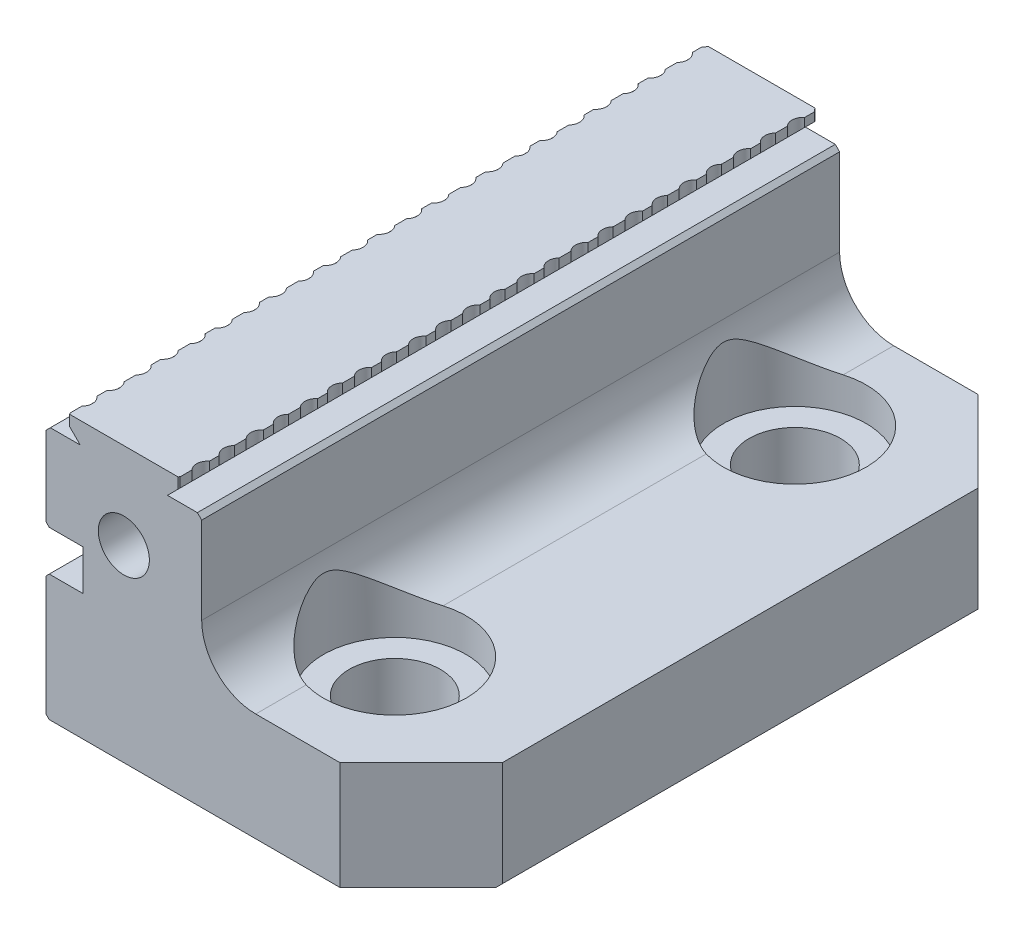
ISO-10303-21;
HEADER;
FILE_DESCRIPTION(('STEP AP214'),'2;1');
FILE_NAME('part.step','',(''),(''),'','','');
FILE_SCHEMA(('AUTOMOTIVE_DESIGN { 1 0 10303 214 1 1 1 1 }'));
ENDSEC;
DATA;
#1=APPLICATION_CONTEXT('core data for automotive mechanical design processes');
#2=APPLICATION_PROTOCOL_DEFINITION('international standard','automotive_design',2000,#1);
#3=PRODUCT_CONTEXT('',#1,'mechanical');
#4=PRODUCT('Part','Part','',(#3));
#5=PRODUCT_RELATED_PRODUCT_CATEGORY('part','',(#4));
#6=PRODUCT_DEFINITION_FORMATION('','',#4);
#7=PRODUCT_DEFINITION_CONTEXT('part definition',#1,'design');
#8=PRODUCT_DEFINITION('design','',#6,#7);
#9=PRODUCT_DEFINITION_SHAPE('','',#8);
#10=(LENGTH_UNIT() NAMED_UNIT(*) SI_UNIT(.MILLI.,.METRE.));
#11=(NAMED_UNIT(*) PLANE_ANGLE_UNIT() SI_UNIT($,.RADIAN.));
#12=(NAMED_UNIT(*) SI_UNIT($,.STERADIAN.) SOLID_ANGLE_UNIT());
#13=UNCERTAINTY_MEASURE_WITH_UNIT(LENGTH_MEASURE(1.E-05),#10,'distance_accuracy_value','');
#14=(GEOMETRIC_REPRESENTATION_CONTEXT(3) GLOBAL_UNCERTAINTY_ASSIGNED_CONTEXT((#13)) GLOBAL_UNIT_ASSIGNED_CONTEXT((#10,
#11,#12)) REPRESENTATION_CONTEXT('',''));
#15=CARTESIAN_POINT('',(0.,0.,0.));
#16=DIRECTION('',(0.,0.,1.));
#17=DIRECTION('',(1.,0.,0.));
#18=AXIS2_PLACEMENT_3D('',#15,#16,#17);
#19=CARTESIAN_POINT('',(-22.0345,-16.129,62.865));
#20=DIRECTION('',(1.,0.,0.));
#21=DIRECTION('',(0.,0.,-1.));
#22=AXIS2_PLACEMENT_3D('',#19,#20,#21);
#23=PLANE('',#22);
#24=DIRECTION('',(0.,1.,0.));
#25=VECTOR('',#24,1.);
#26=CARTESIAN_POINT('',(-22.0345,-16.129,37.465));
#27=LINE('',#26,#25);
#28=CARTESIAN_POINT('',(-22.0345,-15.748,37.465));
#29=VERTEX_POINT('',#28);
#30=CARTESIAN_POINT('',(-22.0345,-1.70179999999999,37.465));
#31=VERTEX_POINT('',#30);
#32=EDGE_CURVE('E842',#29,#31,#27,.T.);
#33=ORIENTED_EDGE('',*,*,#32,.T.);
#34=DIRECTION('',(0.,0.,-1.));
#35=VECTOR('',#34,1.);
#36=CARTESIAN_POINT('',(-22.0345,-1.70179999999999,62.865));
#37=LINE('',#36,#35);
#38=CARTESIAN_POINT('',(-22.0345,-1.7018,-37.465));
#39=VERTEX_POINT('',#38);
#40=EDGE_CURVE('E2100',#31,#39,#37,.T.);
#41=ORIENTED_EDGE('',*,*,#40,.T.);
#42=DIRECTION('',(0.,1.,0.));
#43=VECTOR('',#42,1.);
#44=CARTESIAN_POINT('',(-22.0345,-16.129,-37.465));
#45=LINE('',#44,#43);
#46=CARTESIAN_POINT('',(-22.0345,-15.748,-37.465));
#47=VERTEX_POINT('',#46);
#48=EDGE_CURVE('E843',#47,#39,#45,.T.);
#49=ORIENTED_EDGE('',*,*,#48,.F.);
#50=DIRECTION('',(0.,0.,1.));
#51=VECTOR('',#50,1.);
#52=CARTESIAN_POINT('',(-22.0345,-15.748,62.865));
#53=LINE('',#52,#51);
#54=EDGE_CURVE('E2076',#47,#29,#53,.T.);
#55=ORIENTED_EDGE('',*,*,#54,.T.);
#56=EDGE_LOOP('',(#33,#41,#49,#55));
#57=FACE_BOUND('',#56,.T.);
#58=ADVANCED_FACE('F38',(#57),#23,.F.);
#59=CARTESIAN_POINT('',(-22.0345,3.81000000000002,37.465));
#60=VERTEX_POINT('',#59);
#61=CARTESIAN_POINT('',(-22.0345,13.121,37.465));
#62=VERTEX_POINT('',#61);
#63=EDGE_CURVE('E839',#60,#62,#27,.T.);
#64=ORIENTED_EDGE('',*,*,#63,.T.);
#65=DIRECTION('',(0.,0.,-1.));
#66=VECTOR('',#65,1.);
#67=CARTESIAN_POINT('',(-22.0345,13.121,62.865));
#68=LINE('',#67,#66);
#69=CARTESIAN_POINT('',(-22.0345,13.121,-37.465));
#70=VERTEX_POINT('',#69);
#71=EDGE_CURVE('E2094',#62,#70,#68,.T.);
#72=ORIENTED_EDGE('',*,*,#71,.T.);
#73=CARTESIAN_POINT('',(-22.0345,3.81000000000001,-37.465));
#74=VERTEX_POINT('',#73);
#75=EDGE_CURVE('E834',#74,#70,#45,.T.);
#76=ORIENTED_EDGE('',*,*,#75,.F.);
#77=DIRECTION('',(0.,0.,1.));
#78=VECTOR('',#77,1.);
#79=CARTESIAN_POINT('',(-22.0345,3.81000000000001,62.865));
#80=LINE('',#79,#78);
#81=EDGE_CURVE('E2103',#74,#60,#80,.T.);
#82=ORIENTED_EDGE('',*,*,#81,.T.);
#83=EDGE_LOOP('',(#64,#72,#76,#82));
#84=FACE_BOUND('',#83,.T.);
#85=ADVANCED_FACE('F1990',(#84),#23,.F.);
#86=CARTESIAN_POINT('',(-22.0345,-16.129,62.865));
#87=DIRECTION('',(0.,1.,0.));
#88=DIRECTION('',(0.,0.,1.));
#89=AXIS2_PLACEMENT_3D('',#86,#87,#88);
#90=PLANE('',#89);
#91=CARTESIAN_POINT('',(16.656299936,-16.129,23.5));
#92=DIRECTION('',(0.,-1.,0.));
#93=DIRECTION('',(0.,0.,-1.));
#94=AXIS2_PLACEMENT_3D('',#91,#92,#93);
#95=CIRCLE('',#94,4.699);
#96=CARTESIAN_POINT('',(16.656299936,-16.129,18.801));
#97=VERTEX_POINT('',#96);
#98=EDGE_CURVE('E921',#97,#97,#95,.T.);
#99=ORIENTED_EDGE('',*,*,#98,.F.);
#100=EDGE_LOOP('',(#99));
#101=FACE_BOUND('',#100,.T.);
#102=CARTESIAN_POINT('',(-6.7437,-16.129,-23.5));
#103=DIRECTION('',(0.,-1.,0.));
#104=DIRECTION('',(0.,0.,-1.));
#105=AXIS2_PLACEMENT_3D('',#102,#103,#104);
#106=CIRCLE('',#105,4.699);
#107=CARTESIAN_POINT('',(-6.7437,-16.129,-28.199));
#108=VERTEX_POINT('',#107);
#109=EDGE_CURVE('E932',#108,#108,#106,.T.);
#110=ORIENTED_EDGE('',*,*,#109,.F.);
#111=EDGE_LOOP('',(#110));
#112=FACE_BOUND('',#111,.T.);
#113=CARTESIAN_POINT('',(4.9657,-16.129,-23.495));
#114=DIRECTION('',(0.,1.,0.));
#115=DIRECTION('',(0.,0.,1.));
#116=AXIS2_PLACEMENT_3D('',#113,#114,#115);
#117=CIRCLE('',#116,5.96899999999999);
#118=CARTESIAN_POINT('',(4.9657,-16.129,-17.526));
#119=VERTEX_POINT('',#118);
#120=EDGE_CURVE('E941',#119,#119,#117,.T.);
#121=ORIENTED_EDGE('',*,*,#120,.T.);
#122=EDGE_LOOP('',(#121));
#123=FACE_BOUND('',#122,.T.);
#124=CARTESIAN_POINT('',(4.9657,-16.129,23.495));
#125=DIRECTION('',(0.,1.,0.));
#126=DIRECTION('',(0.,0.,1.));
#127=AXIS2_PLACEMENT_3D('',#124,#125,#126);
#128=CIRCLE('',#127,5.96899999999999);
#129=CARTESIAN_POINT('',(4.9657,-16.129,29.464));
#130=VERTEX_POINT('',#129);
#131=EDGE_CURVE('E956',#130,#130,#128,.T.);
#132=ORIENTED_EDGE('',*,*,#131,.T.);
#133=EDGE_LOOP('',(#132));
#134=FACE_BOUND('',#133,.T.);
#135=DIRECTION('',(0.,0.,1.));
#136=VECTOR('',#135,1.);
#137=CARTESIAN_POINT('',(21.6535,-16.129,62.865));
#138=LINE('',#137,#136);
#139=CARTESIAN_POINT('',(21.6535,-16.129,-28.321));
#140=VERTEX_POINT('',#139);
#141=CARTESIAN_POINT('',(21.6535,-16.129,28.321));
#142=VERTEX_POINT('',#141);
#143=EDGE_CURVE('E2051',#140,#142,#138,.T.);
#144=ORIENTED_EDGE('',*,*,#143,.T.);
#145=DIRECTION('',(-0.707106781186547,0.,0.707106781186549));
#146=VECTOR('',#145,1.);
#147=CARTESIAN_POINT('',(12.5095,-16.129,37.465));
#148=LINE('',#147,#146);
#149=CARTESIAN_POINT('',(12.5095,-16.129,37.465));
#150=VERTEX_POINT('',#149);
#151=EDGE_CURVE('E46',#142,#150,#148,.T.);
#152=ORIENTED_EDGE('',*,*,#151,.T.);
#153=DIRECTION('',(1.,0.,0.));
#154=VECTOR('',#153,1.);
#155=CARTESIAN_POINT('',(-22.0345,-16.129,37.465));
#156=LINE('',#155,#154);
#157=CARTESIAN_POINT('',(-21.6535,-16.129,37.465));
#158=VERTEX_POINT('',#157);
#159=EDGE_CURVE('E830',#158,#150,#156,.T.);
#160=ORIENTED_EDGE('',*,*,#159,.F.);
#161=DIRECTION('',(0.,0.,-1.));
#162=VECTOR('',#161,1.);
#163=CARTESIAN_POINT('',(-21.6535,-16.129,62.865));
#164=LINE('',#163,#162);
#165=CARTESIAN_POINT('',(-21.6535,-16.129,-37.465));
#166=VERTEX_POINT('',#165);
#167=EDGE_CURVE('E2080',#158,#166,#164,.T.);
#168=ORIENTED_EDGE('',*,*,#167,.T.);
#169=DIRECTION('',(-1.,0.,0.));
#170=VECTOR('',#169,1.);
#171=CARTESIAN_POINT('',(-22.0345,-16.129,-37.465));
#172=LINE('',#171,#170);
#173=CARTESIAN_POINT('',(12.5095,-16.129,-37.465));
#174=VERTEX_POINT('',#173);
#175=EDGE_CURVE('E828',#174,#166,#172,.T.);
#176=ORIENTED_EDGE('',*,*,#175,.F.);
#177=DIRECTION('',(0.707106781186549,0.,0.707106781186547));
#178=VECTOR('',#177,1.);
#179=CARTESIAN_POINT('',(22.0345,-16.129,-27.94));
#180=LINE('',#179,#178);
#181=EDGE_CURVE('E2041',#174,#140,#180,.T.);
#182=ORIENTED_EDGE('',*,*,#181,.T.);
#183=EDGE_LOOP('',(#144,#152,#160,#168,#176,#182));
#184=FACE_BOUND('',#183,.T.);
#185=ADVANCED_FACE('F1996',(#101,#112,#123,#134,#184),#90,.F.);
#186=CARTESIAN_POINT('',(22.0345,-16.129,62.865));
#187=DIRECTION('',(-1.,0.,0.));
#188=DIRECTION('',(0.,0.,1.));
#189=AXIS2_PLACEMENT_3D('',#186,#187,#188);
#190=PLANE('',#189);
#191=DIRECTION('',(0.,0.,-1.));
#192=VECTOR('',#191,1.);
#193=CARTESIAN_POINT('',(22.0345,-3.42900000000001,62.865));
#194=LINE('',#193,#192);
#195=CARTESIAN_POINT('',(22.0345,-3.42900000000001,27.94));
#196=VERTEX_POINT('',#195);
#197=CARTESIAN_POINT('',(22.0345,-3.42900000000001,-27.94));
#198=VERTEX_POINT('',#197);
#199=EDGE_CURVE('E1608',#196,#198,#194,.T.);
#200=ORIENTED_EDGE('',*,*,#199,.F.);
#201=DIRECTION('',(0.,-1.,0.));
#202=VECTOR('',#201,1.);
#203=CARTESIAN_POINT('',(22.0345,-15.748,27.94));
#204=LINE('',#203,#202);
#205=CARTESIAN_POINT('',(22.0345,-15.748,27.94));
#206=VERTEX_POINT('',#205);
#207=EDGE_CURVE('E2039',#196,#206,#204,.T.);
#208=ORIENTED_EDGE('',*,*,#207,.T.);
#209=DIRECTION('',(0.,0.,-1.));
#210=VECTOR('',#209,1.);
#211=CARTESIAN_POINT('',(22.0345,-15.748,62.865));
#212=LINE('',#211,#210);
#213=CARTESIAN_POINT('',(22.0345,-15.748,-27.94));
#214=VERTEX_POINT('',#213);
#215=EDGE_CURVE('E2073',#206,#214,#212,.T.);
#216=ORIENTED_EDGE('',*,*,#215,.T.);
#217=DIRECTION('',(0.,1.,0.));
#218=VECTOR('',#217,1.);
#219=CARTESIAN_POINT('',(22.0345,-3.42900000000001,-27.94));
#220=LINE('',#219,#218);
#221=EDGE_CURVE('E2067',#214,#198,#220,.T.);
#222=ORIENTED_EDGE('',*,*,#221,.T.);
#223=EDGE_LOOP('',(#200,#208,#216,#222));
#224=FACE_BOUND('',#223,.T.);
#225=ADVANCED_FACE('F2072',(#224),#190,.F.);
#226=CARTESIAN_POINT('',(22.0345,-3.42900000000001,62.865));
#227=DIRECTION('',(0.,-1.,0.));
#228=DIRECTION('',(1.,0.,0.));
#229=AXIS2_PLACEMENT_3D('',#226,#227,#228);
#230=PLANE('',#229);
#231=DIRECTION('',(-1.,0.,0.));
#232=VECTOR('',#231,1.);
#233=CARTESIAN_POINT('',(22.0345,-3.42900000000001,37.465));
#234=LINE('',#233,#232);
#235=CARTESIAN_POINT('',(12.5095,-3.42900000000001,37.465));
#236=VERTEX_POINT('',#235);
#237=CARTESIAN_POINT('',(2.60350000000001,-3.42900000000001,37.465));
#238=VERTEX_POINT('',#237);
#239=EDGE_CURVE('E890',#236,#238,#234,.T.);
#240=ORIENTED_EDGE('',*,*,#239,.F.);
#241=DIRECTION('',(0.707106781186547,0.,-0.707106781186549));
#242=VECTOR('',#241,1.);
#243=CARTESIAN_POINT('',(12.5095,-3.42900000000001,37.465));
#244=LINE('',#243,#242);
#245=EDGE_CURVE('E2058',#236,#196,#244,.T.);
#246=ORIENTED_EDGE('',*,*,#245,.T.);
#247=ORIENTED_EDGE('',*,*,#199,.T.);
#248=DIRECTION('',(-0.707106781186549,0.,-0.707106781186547));
#249=VECTOR('',#248,1.);
#250=CARTESIAN_POINT('',(22.0345,-3.42900000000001,-27.94));
#251=LINE('',#250,#249);
#252=CARTESIAN_POINT('',(12.5095,-3.42900000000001,-37.465));
#253=VERTEX_POINT('',#252);
#254=EDGE_CURVE('E2059',#198,#253,#251,.T.);
#255=ORIENTED_EDGE('',*,*,#254,.T.);
#256=DIRECTION('',(1.,0.,0.));
#257=VECTOR('',#256,1.);
#258=CARTESIAN_POINT('',(22.0345,-3.42900000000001,-37.465));
#259=LINE('',#258,#257);
#260=CARTESIAN_POINT('',(2.60350000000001,-3.42900000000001,-37.465));
#261=VERTEX_POINT('',#260);
#262=EDGE_CURVE('E854',#261,#253,#259,.T.);
#263=ORIENTED_EDGE('',*,*,#262,.F.);
#264=DIRECTION('',(0.,0.,-1.));
#265=VECTOR('',#264,1.);
#266=CARTESIAN_POINT('',(2.60350000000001,-3.42900000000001,62.865));
#267=LINE('',#266,#265);
#268=CARTESIAN_POINT('',(2.60350000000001,-3.42900000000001,-31.5372593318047));
#269=VERTEX_POINT('',#268);
#270=EDGE_CURVE('E1605',#269,#261,#267,.T.);
#271=ORIENTED_EDGE('',*,*,#270,.F.);
#272=CARTESIAN_POINT('',(4.9657,-3.42900000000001,-23.495));
#273=DIRECTION('',(0.,-1.,0.));
#274=DIRECTION('',(1.,0.,0.));
#275=AXIS2_PLACEMENT_3D('',#272,#273,#274);
#276=CIRCLE('',#275,8.382);
#277=CARTESIAN_POINT('',(2.60350000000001,-3.42900000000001,-15.4527406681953));
#278=VERTEX_POINT('',#277);
#279=EDGE_CURVE('E953',#269,#278,#276,.T.);
#280=ORIENTED_EDGE('',*,*,#279,.T.);
#281=CARTESIAN_POINT('',(2.60350000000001,-3.42900000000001,15.4527406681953));
#282=VERTEX_POINT('',#281);
#283=EDGE_CURVE('E1609',#282,#278,#267,.T.);
#284=ORIENTED_EDGE('',*,*,#283,.F.);
#285=CARTESIAN_POINT('',(4.9657,-3.42900000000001,23.495));
#286=DIRECTION('',(0.,-1.,0.));
#287=DIRECTION('',(1.,0.,0.));
#288=AXIS2_PLACEMENT_3D('',#285,#286,#287);
#289=CIRCLE('',#288,8.382);
#290=CARTESIAN_POINT('',(2.60350000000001,-3.42900000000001,31.5372593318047));
#291=VERTEX_POINT('',#290);
#292=EDGE_CURVE('E968',#282,#291,#289,.T.);
#293=ORIENTED_EDGE('',*,*,#292,.T.);
#294=EDGE_CURVE('E1606',#238,#291,#267,.T.);
#295=ORIENTED_EDGE('',*,*,#294,.F.);
#296=EDGE_LOOP('',(#240,#246,#247,#255,#263,#271,#280,#284,#293,#295));
#297=FACE_BOUND('',#296,.T.);
#298=ADVANCED_FACE('F1986',(#297),#230,.F.);
#299=CARTESIAN_POINT('',(2.60350000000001,2.921,62.865));
#300=DIRECTION('',(0.,0.,-1.));
#301=DIRECTION('',(-1.,0.,0.));
#302=AXIS2_PLACEMENT_3D('',#299,#300,#301);
#303=CYLINDRICAL_SURFACE('',#302,6.35);
#304=CARTESIAN_POINT('',(2.60350000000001,2.921,37.465));
#305=DIRECTION('',(0.,0.,1.));
#306=DIRECTION('',(1.,0.,0.));
#307=AXIS2_PLACEMENT_3D('',#304,#305,#306);
#308=CIRCLE('',#307,6.35);
#309=CARTESIAN_POINT('',(-3.7465,2.921,37.465));
#310=VERTEX_POINT('',#309);
#311=EDGE_CURVE('E888',#238,#310,#308,.F.);
#312=ORIENTED_EDGE('',*,*,#311,.F.);
#313=ORIENTED_EDGE('',*,*,#294,.T.);
#314=CARTESIAN_POINT('',(2.60350000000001,-3.42900000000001,31.5372593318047));
#315=CARTESIAN_POINT('',(2.43372419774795,-3.42903156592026,31.487437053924));
#316=CARTESIAN_POINT('',(2.26563790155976,-3.42219378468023,31.432184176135));
#317=CARTESIAN_POINT('',(1.93437076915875,-3.39582078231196,31.3116359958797));
#318=CARTESIAN_POINT('',(1.7711836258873,-3.37630268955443,31.2463543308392));
#319=CARTESIAN_POINT('',(1.45230839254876,-3.32584725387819,31.1070980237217));
#320=CARTESIAN_POINT('',(1.29656351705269,-3.29502088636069,31.0332124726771));
#321=CARTESIAN_POINT('',(0.991782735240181,-3.2230543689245,30.8770899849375));
#322=CARTESIAN_POINT('',(0.842748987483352,-3.18191092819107,30.7948503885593));
#323=CARTESIAN_POINT('',(0.408362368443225,-3.04520433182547,30.5378124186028));
#324=CARTESIAN_POINT('',(0.133763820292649,-2.93602949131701,30.3518256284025));
#325=CARTESIAN_POINT('',(-0.384356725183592,-2.68951956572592,29.9557837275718));
#326=CARTESIAN_POINT('',(-0.627787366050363,-2.55210464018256,29.7456611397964));
#327=CARTESIAN_POINT('',(-1.03581297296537,-2.28709330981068,29.3518536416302));
#328=CARTESIAN_POINT('',(-1.20631711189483,-2.16330727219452,29.1716414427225));
#329=CARTESIAN_POINT('',(-1.52773554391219,-1.90578160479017,28.8009814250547));
#330=CARTESIAN_POINT('',(-1.67863922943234,-1.77203664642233,28.6105281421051));
#331=CARTESIAN_POINT('',(-1.96156598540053,-1.49732768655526,28.2203675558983));
#332=CARTESIAN_POINT('',(-2.09355366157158,-1.35635080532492,28.0206438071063));
#333=CARTESIAN_POINT('',(-2.33887726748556,-1.07034748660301,27.6129698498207));
#334=CARTESIAN_POINT('',(-2.45221985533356,-0.925322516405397,27.4050226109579));
#335=CARTESIAN_POINT('',(-2.63651188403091,-0.668377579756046,27.0301349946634));
#336=CARTESIAN_POINT('',(-2.71118920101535,-0.556605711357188,26.8649102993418));
#337=CARTESIAN_POINT('',(-2.85003560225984,-0.334546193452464,26.5290160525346));
#338=CARTESIAN_POINT('',(-2.91420097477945,-0.224259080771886,26.3583446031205));
#339=CARTESIAN_POINT('',(-3.03185764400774,-0.00821896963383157,26.0110609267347));
#340=CARTESIAN_POINT('',(-3.08537031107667,0.0975427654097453,25.8344614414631));
#341=CARTESIAN_POINT('',(-3.18157396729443,0.300322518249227,25.4735634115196));
#342=CARTESIAN_POINT('',(-3.22427577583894,0.397349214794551,25.2892727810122));
#343=CARTESIAN_POINT('',(-3.29425400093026,0.565915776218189,24.930574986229));
#344=CARTESIAN_POINT('',(-3.32268137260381,0.639063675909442,24.7571711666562));
#345=CARTESIAN_POINT('',(-3.36905665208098,0.76333802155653,24.4014642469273));
#346=CARTESIAN_POINT('',(-3.3870409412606,0.814540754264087,24.2191944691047));
#347=CARTESIAN_POINT('',(-3.40893649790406,0.877936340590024,23.878761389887));
#348=CARTESIAN_POINT('',(-3.41471250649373,0.89525959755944,23.7217301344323));
#349=CARTESIAN_POINT('',(-3.41731307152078,0.902996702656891,23.407046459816));
#350=CARTESIAN_POINT('',(-3.41414696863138,0.893438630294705,23.2493948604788));
#351=CARTESIAN_POINT('',(-3.39716031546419,0.843649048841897,22.8948194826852));
#352=CARTESIAN_POINT('',(-3.38061831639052,0.795617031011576,22.6991848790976));
#353=CARTESIAN_POINT('',(-3.33543604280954,0.672509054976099,22.3175021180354));
#354=CARTESIAN_POINT('',(-3.30672098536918,0.597266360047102,22.1315213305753));
#355=CARTESIAN_POINT('',(-3.25038522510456,0.45968570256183,21.8311178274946));
#356=CARTESIAN_POINT('',(-3.22576101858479,0.401760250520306,21.7140117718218));
#357=CARTESIAN_POINT('',(-3.17216374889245,0.281197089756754,21.4832519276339));
#358=CARTESIAN_POINT('',(-3.14318980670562,0.218558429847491,21.3695988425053));
#359=CARTESIAN_POINT('',(-3.04988456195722,0.0258242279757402,21.0327272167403));
#360=CARTESIAN_POINT('',(-2.9792325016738,-0.108929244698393,20.8139226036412));
#361=CARTESIAN_POINT('',(-2.82129436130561,-0.383449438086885,20.3848622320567));
#362=CARTESIAN_POINT('',(-2.73396254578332,-0.523229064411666,20.1746319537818));
#363=CARTESIAN_POINT('',(-2.5426988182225,-0.802953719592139,19.7622435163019));
#364=CARTESIAN_POINT('',(-2.43878024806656,-0.942898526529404,19.5600790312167));
#365=CARTESIAN_POINT('',(-2.20905545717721,-1.22586137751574,19.1547969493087));
#366=CARTESIAN_POINT('',(-2.08249875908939,-1.36875180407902,18.9520140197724));
#367=CARTESIAN_POINT('',(-1.81022597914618,-1.64842477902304,18.555092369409));
#368=CARTESIAN_POINT('',(-1.66450292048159,-1.78520507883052,18.360956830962));
#369=CARTESIAN_POINT('',(-1.35376499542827,-2.04931124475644,17.9830205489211));
#370=CARTESIAN_POINT('',(-1.18880791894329,-2.17666364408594,17.7991911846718));
#371=CARTESIAN_POINT('',(-0.838968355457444,-2.41915280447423,17.443051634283));
#372=CARTESIAN_POINT('',(-0.654098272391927,-2.5342970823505,17.2707343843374));
#373=CARTESIAN_POINT('',(-0.207045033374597,-2.78039518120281,16.8912435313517));
#374=CARTESIAN_POINT('',(0.0619711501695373,-2.90618200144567,16.6885405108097));
#375=CARTESIAN_POINT('',(0.48917494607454,-3.06859911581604,16.4064354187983));
#376=CARTESIAN_POINT('',(0.635365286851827,-3.11832443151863,16.316137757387));
#377=CARTESIAN_POINT('',(0.935276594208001,-3.20794987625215,16.1435690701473));
#378=CARTESIAN_POINT('',(1.08899569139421,-3.24785242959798,16.0612960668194));
#379=CARTESIAN_POINT('',(1.46099602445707,-3.32923501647,15.8771070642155));
#380=CARTESIAN_POINT('',(1.68230277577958,-3.36593994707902,15.7790333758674));
#381=CARTESIAN_POINT('',(2.02210368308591,-3.40336357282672,15.645917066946));
#382=CARTESIAN_POINT('',(2.136952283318,-3.41290062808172,15.6037962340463));
#383=CARTESIAN_POINT('',(2.36876189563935,-3.42572231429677,15.5245005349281));
#384=CARTESIAN_POINT('',(2.48572412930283,-3.42900320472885,15.4873286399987));
#385=CARTESIAN_POINT('',(2.60350000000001,-3.42900000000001,15.4527406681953));
#386=B_SPLINE_CURVE_WITH_KNOTS('',3,(#314,#315,#316,#317,#318,#319,#320,#321,#322,#323,#324,
#325,#326,#327,#328,#329,#330,#331,#332,#333,#334,#335,#336,#337,#338,#339,#340,#341,#342,#343,
#344,#345,#346,#347,#348,#349,#350,#351,#352,#353,#354,#355,#356,#357,#358,#359,#360,#361,#362,
#363,#364,#365,#366,#367,#368,#369,#370,#371,#372,#373,#374,#375,#376,#377,#378,#379,#380,#381,
#382,#383,#384,#385),.UNSPECIFIED.,.F.,.F.,(4,2,2,2,2,2,2,2,2,2,2,2,2,2,2,2,2,2,2,2,2,2,2,2,2,2,
2,2,2,2,2,2,2,2,2,4),(0.,0.530447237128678,1.06017943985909,1.58484634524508,2.10968081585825,
3.15291639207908,4.19914301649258,5.02981023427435,5.8609251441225,6.6935754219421,
7.52592771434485,8.16462471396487,8.80354675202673,9.44117383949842,10.0781602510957,
10.6480578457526,11.2159579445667,11.6878793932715,12.1593080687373,12.7620166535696,
13.3684827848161,13.7671410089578,14.165879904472,14.9644597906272,15.7652616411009,
16.5654225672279,17.4000803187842,18.2350427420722,19.0675581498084,19.8995579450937,
20.9739464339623,21.5100726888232,22.046066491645,22.7783750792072,23.1462353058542,
23.5143154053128),.UNSPECIFIED.);
#387=EDGE_CURVE('E1612',#291,#282,#386,.T.);
#388=ORIENTED_EDGE('',*,*,#387,.T.);
#389=ORIENTED_EDGE('',*,*,#283,.T.);
#390=CARTESIAN_POINT('',(2.60350000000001,-3.42900000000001,-15.4527406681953));
#391=CARTESIAN_POINT('',(2.43372419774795,-3.42903156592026,-15.502562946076));
#392=CARTESIAN_POINT('',(2.26563790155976,-3.42219378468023,-15.557815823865));
#393=CARTESIAN_POINT('',(1.93437076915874,-3.39582078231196,-15.6783640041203));
#394=CARTESIAN_POINT('',(1.7711836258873,-3.37630268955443,-15.7436456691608));
#395=CARTESIAN_POINT('',(1.45230839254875,-3.32584725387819,-15.8829019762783));
#396=CARTESIAN_POINT('',(1.29656351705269,-3.29502088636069,-15.9567875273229));
#397=CARTESIAN_POINT('',(0.991782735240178,-3.2230543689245,-16.1129100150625));
#398=CARTESIAN_POINT('',(0.842748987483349,-3.18191092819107,-16.1951496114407));
#399=CARTESIAN_POINT('',(0.408362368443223,-3.04520433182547,-16.4521875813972));
#400=CARTESIAN_POINT('',(0.133763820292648,-2.93602949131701,-16.6381743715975));
#401=CARTESIAN_POINT('',(-0.384356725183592,-2.68951956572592,-17.0342162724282));
#402=CARTESIAN_POINT('',(-0.627787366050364,-2.55210464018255,-17.2443388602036));
#403=CARTESIAN_POINT('',(-1.03581297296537,-2.28709330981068,-17.6381463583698));
#404=CARTESIAN_POINT('',(-1.20631711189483,-2.16330727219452,-17.8183585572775));
#405=CARTESIAN_POINT('',(-1.52773554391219,-1.90578160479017,-18.1890185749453));
#406=CARTESIAN_POINT('',(-1.67863922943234,-1.77203664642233,-18.3794718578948));
#407=CARTESIAN_POINT('',(-1.96156598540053,-1.49732768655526,-18.7696324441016));
#408=CARTESIAN_POINT('',(-2.09355366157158,-1.35635080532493,-18.9693561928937));
#409=CARTESIAN_POINT('',(-2.33887726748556,-1.07034748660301,-19.3770301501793));
#410=CARTESIAN_POINT('',(-2.45221985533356,-0.925322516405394,-19.5849773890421));
#411=CARTESIAN_POINT('',(-2.63651188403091,-0.668377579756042,-19.9598650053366));
#412=CARTESIAN_POINT('',(-2.71118920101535,-0.556605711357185,-20.1250897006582));
#413=CARTESIAN_POINT('',(-2.85003560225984,-0.334546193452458,-20.4609839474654));
#414=CARTESIAN_POINT('',(-2.91420097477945,-0.224259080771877,-20.6316553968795));
#415=CARTESIAN_POINT('',(-3.03185764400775,-0.00821896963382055,-20.9789390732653));
#416=CARTESIAN_POINT('',(-3.08537031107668,0.0975427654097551,-21.1555385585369));
#417=CARTESIAN_POINT('',(-3.18157396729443,0.300322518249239,-21.5164365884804));
#418=CARTESIAN_POINT('',(-3.22427577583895,0.397349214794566,-21.7007272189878));
#419=CARTESIAN_POINT('',(-3.29425400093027,0.565915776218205,-22.059425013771));
#420=CARTESIAN_POINT('',(-3.32268137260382,0.639063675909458,-22.2328288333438));
#421=CARTESIAN_POINT('',(-3.36905665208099,0.763338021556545,-22.5885357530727));
#422=CARTESIAN_POINT('',(-3.38704094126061,0.814540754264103,-22.7708055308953));
#423=CARTESIAN_POINT('',(-3.40893649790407,0.877936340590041,-23.111238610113));
#424=CARTESIAN_POINT('',(-3.41471250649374,0.895259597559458,-23.2682698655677));
#425=CARTESIAN_POINT('',(-3.41731307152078,0.902996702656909,-23.582953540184));
#426=CARTESIAN_POINT('',(-3.41414696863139,0.893438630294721,-23.7406051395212));
#427=CARTESIAN_POINT('',(-3.3971603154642,0.843649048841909,-24.0951805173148));
#428=CARTESIAN_POINT('',(-3.38061831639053,0.795617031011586,-24.2908151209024));
#429=CARTESIAN_POINT('',(-3.33543604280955,0.672509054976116,-24.6724978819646));
#430=CARTESIAN_POINT('',(-3.30672098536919,0.597266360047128,-24.8584786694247));
#431=CARTESIAN_POINT('',(-3.25038522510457,0.459685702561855,-25.1588821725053));
#432=CARTESIAN_POINT('',(-3.2257610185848,0.401760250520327,-25.2759882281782));
#433=CARTESIAN_POINT('',(-3.17216374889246,0.281197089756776,-25.5067480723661));
#434=CARTESIAN_POINT('',(-3.14318980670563,0.218558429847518,-25.6204011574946));
#435=CARTESIAN_POINT('',(-3.04988456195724,0.0258242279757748,-25.9572727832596));
#436=CARTESIAN_POINT('',(-2.97923250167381,-0.108929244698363,-26.1760773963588));
#437=CARTESIAN_POINT('',(-2.82129436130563,-0.383449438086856,-26.6051377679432));
#438=CARTESIAN_POINT('',(-2.73396254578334,-0.523229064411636,-26.8153680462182));
#439=CARTESIAN_POINT('',(-2.54269881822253,-0.802953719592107,-27.2277564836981));
#440=CARTESIAN_POINT('',(-2.43878024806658,-0.942898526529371,-27.4299209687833));
#441=CARTESIAN_POINT('',(-2.20905545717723,-1.22586137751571,-27.8352030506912));
#442=CARTESIAN_POINT('',(-2.08249875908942,-1.36875180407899,-28.0379859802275));
#443=CARTESIAN_POINT('',(-1.81022597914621,-1.64842477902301,-28.4349076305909));
#444=CARTESIAN_POINT('',(-1.66450292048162,-1.78520507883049,-28.629043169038));
#445=CARTESIAN_POINT('',(-1.35376499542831,-2.04931124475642,-29.0069794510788));
#446=CARTESIAN_POINT('',(-1.18880791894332,-2.17666364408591,-29.1908088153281));
#447=CARTESIAN_POINT('',(-0.838968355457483,-2.41915280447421,-29.5469483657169));
#448=CARTESIAN_POINT('',(-0.65409827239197,-2.53429708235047,-29.7192656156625));
#449=CARTESIAN_POINT('',(-0.207045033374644,-2.78039518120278,-30.0987564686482));
#450=CARTESIAN_POINT('',(0.0619711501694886,-2.90618200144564,-30.3014594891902));
#451=CARTESIAN_POINT('',(0.48917494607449,-3.06859911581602,-30.5835645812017));
#452=CARTESIAN_POINT('',(0.635365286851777,-3.11832443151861,-30.673862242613));
#453=CARTESIAN_POINT('',(0.93527659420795,-3.20794987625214,-30.8464309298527));
#454=CARTESIAN_POINT('',(1.08899569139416,-3.24785242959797,-30.9287039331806));
#455=CARTESIAN_POINT('',(1.46099602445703,-3.32923501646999,-31.1128929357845));
#456=CARTESIAN_POINT('',(1.68230277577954,-3.36593994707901,-31.2109666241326));
#457=CARTESIAN_POINT('',(2.02210368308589,-3.40336357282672,-31.344082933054));
#458=CARTESIAN_POINT('',(2.13695228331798,-3.41290062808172,-31.3862037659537));
#459=CARTESIAN_POINT('',(2.36876189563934,-3.42572231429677,-31.4654994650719));
#460=CARTESIAN_POINT('',(2.48572412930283,-3.42900320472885,-31.5026713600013));
#461=CARTESIAN_POINT('',(2.60350000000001,-3.42900000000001,-31.5372593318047));
#462=B_SPLINE_CURVE_WITH_KNOTS('',3,(#390,#391,#392,#393,#394,#395,#396,#397,#398,#399,#400,
#401,#402,#403,#404,#405,#406,#407,#408,#409,#410,#411,#412,#413,#414,#415,#416,#417,#418,#419,
#420,#421,#422,#423,#424,#425,#426,#427,#428,#429,#430,#431,#432,#433,#434,#435,#436,#437,#438,
#439,#440,#441,#442,#443,#444,#445,#446,#447,#448,#449,#450,#451,#452,#453,#454,#455,#456,#457,
#458,#459,#460,#461),.UNSPECIFIED.,.F.,.F.,(4,2,2,2,2,2,2,2,2,2,2,2,2,2,2,2,2,2,2,2,2,2,2,2,2,2,
2,2,2,2,2,2,2,2,2,4),(0.,0.530447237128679,1.06017943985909,1.58484634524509,2.10968081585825,
3.15291639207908,4.19914301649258,5.02981023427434,5.8609251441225,6.69357542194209,
7.52592771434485,8.16462471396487,8.80354675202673,9.44117383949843,10.0781602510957,
10.6480578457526,11.2159579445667,11.6878793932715,12.1593080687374,12.7620166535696,
13.3684827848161,13.7671410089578,14.165879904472,14.9644597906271,15.7652616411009,
16.5654225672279,17.4000803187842,18.2350427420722,19.0675581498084,19.8995579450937,
20.9739464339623,21.5100726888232,22.046066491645,22.7783750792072,23.1462353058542,
23.5143154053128),.UNSPECIFIED.);
#463=EDGE_CURVE('E1620',#278,#269,#462,.T.);
#464=ORIENTED_EDGE('',*,*,#463,.T.);
#465=ORIENTED_EDGE('',*,*,#270,.T.);
#466=CARTESIAN_POINT('',(2.60350000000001,2.921,-37.465));
#467=DIRECTION('',(0.,0.,-1.));
#468=DIRECTION('',(-1.,0.,0.));
#469=AXIS2_PLACEMENT_3D('',#466,#467,#468);
#470=CIRCLE('',#469,6.35);
#471=CARTESIAN_POINT('',(-3.7465,2.921,-37.465));
#472=VERTEX_POINT('',#471);
#473=EDGE_CURVE('E852',#472,#261,#470,.F.);
#474=ORIENTED_EDGE('',*,*,#473,.F.);
#475=DIRECTION('',(0.,0.,-1.));
#476=VECTOR('',#475,1.);
#477=CARTESIAN_POINT('',(-3.7465,2.921,62.865));
#478=LINE('',#477,#476);
#479=EDGE_CURVE('E1602',#310,#472,#478,.T.);
#480=ORIENTED_EDGE('',*,*,#479,.F.);
#481=EDGE_LOOP('',(#312,#313,#388,#389,#464,#465,#474,#480));
#482=FACE_BOUND('',#481,.T.);
#483=ADVANCED_FACE('F1626',(#482),#303,.F.);
#484=CARTESIAN_POINT('',(-3.7465,13.629,62.865));
#485=DIRECTION('',(-1.,0.,0.));
#486=DIRECTION('',(0.,-1.,0.));
#487=AXIS2_PLACEMENT_3D('',#484,#485,#486);
#488=PLANE('',#487);
#489=DIRECTION('',(0.,1.,0.));
#490=VECTOR('',#489,1.);
#491=CARTESIAN_POINT('',(-3.7465,13.629,37.465));
#492=LINE('',#491,#490);
#493=CARTESIAN_POINT('',(-3.7465,13.121,37.465));
#494=VERTEX_POINT('',#493);
#495=EDGE_CURVE('E886',#310,#494,#492,.T.);
#496=ORIENTED_EDGE('',*,*,#495,.F.);
#497=ORIENTED_EDGE('',*,*,#479,.T.);
#498=DIRECTION('',(0.,-1.,0.));
#499=VECTOR('',#498,1.);
#500=CARTESIAN_POINT('',(-3.7465,13.629,-37.465));
#501=LINE('',#500,#499);
#502=CARTESIAN_POINT('',(-3.7465,13.121,-37.465));
#503=VERTEX_POINT('',#502);
#504=EDGE_CURVE('E850',#503,#472,#501,.T.);
#505=ORIENTED_EDGE('',*,*,#504,.F.);
#506=DIRECTION('',(0.,0.,1.));
#507=VECTOR('',#506,1.);
#508=CARTESIAN_POINT('',(-3.7465,13.121,62.865));
#509=LINE('',#508,#507);
#510=EDGE_CURVE('E2085',#503,#494,#509,.T.);
#511=ORIENTED_EDGE('',*,*,#510,.T.);
#512=EDGE_LOOP('',(#496,#497,#505,#511));
#513=FACE_BOUND('',#512,.T.);
#514=ADVANCED_FACE('F1979',(#513),#488,.F.);
#515=CARTESIAN_POINT('',(-3.7465,13.629,62.865));
#516=DIRECTION('',(0.,-1.,0.));
#517=DIRECTION('',(0.,0.,-1.));
#518=AXIS2_PLACEMENT_3D('',#515,#516,#517);
#519=PLANE('',#518);
#520=DIRECTION('',(-1.,0.,0.));
#521=VECTOR('',#520,1.);
#522=CARTESIAN_POINT('',(-3.7465,13.629,37.465));
#523=LINE('',#522,#521);
#524=CARTESIAN_POINT('',(-4.2545,13.629,37.465));
#525=VERTEX_POINT('',#524);
#526=CARTESIAN_POINT('',(-7.77050000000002,13.629,37.465));
#527=VERTEX_POINT('',#526);
#528=EDGE_CURVE('E884',#525,#527,#523,.T.);
#529=ORIENTED_EDGE('',*,*,#528,.F.);
#530=DIRECTION('',(0.,0.,-1.));
#531=VECTOR('',#530,1.);
#532=CARTESIAN_POINT('',(-4.2545,13.629,62.865));
#533=LINE('',#532,#531);
#534=CARTESIAN_POINT('',(-4.2545,13.629,-37.465));
#535=VERTEX_POINT('',#534);
#536=EDGE_CURVE('E2088',#525,#535,#533,.T.);
#537=ORIENTED_EDGE('',*,*,#536,.T.);
#538=DIRECTION('',(1.,0.,0.));
#539=VECTOR('',#538,1.);
#540=CARTESIAN_POINT('',(-3.7465,13.629,-37.465));
#541=LINE('',#540,#539);
#542=CARTESIAN_POINT('',(-7.77050000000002,13.629,-37.465));
#543=VERTEX_POINT('',#542);
#544=EDGE_CURVE('E848',#543,#535,#541,.T.);
#545=ORIENTED_EDGE('',*,*,#544,.F.);
#546=DIRECTION('',(0.,0.,-1.));
#547=VECTOR('',#546,1.);
#548=CARTESIAN_POINT('',(-7.77050000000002,13.629,62.865));
#549=LINE('',#548,#547);
#550=EDGE_CURVE('E1598',#527,#543,#549,.T.);
#551=ORIENTED_EDGE('',*,*,#550,.F.);
#552=EDGE_LOOP('',(#529,#537,#545,#551));
#553=FACE_BOUND('',#552,.T.);
#554=ADVANCED_FACE('F1976',(#553),#519,.F.);
#555=CARTESIAN_POINT('',(-7.77050000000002,13.629,62.865));
#556=DIRECTION('',(-0.707106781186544,0.707106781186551,0.));
#557=DIRECTION('',(-0.707106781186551,-0.707106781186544,0.));
#558=AXIS2_PLACEMENT_3D('',#555,#556,#557);
#559=PLANE('',#558);
#560=DIRECTION('',(0.707106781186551,0.707106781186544,0.));
#561=VECTOR('',#560,1.);
#562=CARTESIAN_POINT('',(-7.77050000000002,13.629,37.465));
#563=LINE('',#562,#561);
#564=CARTESIAN_POINT('',(-6.53130502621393,14.8681949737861,37.465));
#565=VERTEX_POINT('',#564);
#566=EDGE_CURVE('E892',#527,#565,#563,.T.);
#567=ORIENTED_EDGE('',*,*,#566,.F.);
#568=ORIENTED_EDGE('',*,*,#550,.T.);
#569=DIRECTION('',(-0.707106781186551,-0.707106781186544,0.));
#570=VECTOR('',#569,1.);
#571=CARTESIAN_POINT('',(-7.77050000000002,13.629,-37.465));
#572=LINE('',#571,#570);
#573=CARTESIAN_POINT('',(-6.6173283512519,14.7821716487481,-37.465));
#574=VERTEX_POINT('',#573);
#575=EDGE_CURVE('E856',#574,#543,#572,.T.);
#576=ORIENTED_EDGE('',*,*,#575,.F.);
#577=CARTESIAN_POINT('',(-5.46034113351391,15.9391588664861,-38.0753328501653));
#578=DIRECTION('',(-0.707106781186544,0.707106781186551,0.));
#579=DIRECTION('',(0.707106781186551,0.707106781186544,0.));
#580=AXIS2_PLACEMENT_3D('',#577,#578,#579);
#581=ELLIPSE('',#580,1.84993276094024,1.3081);
#582=CARTESIAN_POINT('',(-6.2865,15.113,-37.06114));
#583=VERTEX_POINT('',#582);
#584=EDGE_CURVE('E1568',#583,#574,#581,.F.);
#585=ORIENTED_EDGE('',*,*,#584,.F.);
#586=DIRECTION('',(0.,0.,-1.));
#587=VECTOR('',#586,1.);
#588=CARTESIAN_POINT('',(-6.2865,15.113,62.865));
#589=LINE('',#588,#587);
#590=CARTESIAN_POINT('',(-6.2865,15.113,-35.91052));
#591=VERTEX_POINT('',#590);
#592=EDGE_CURVE('E1594',#591,#583,#589,.T.);
#593=ORIENTED_EDGE('',*,*,#592,.F.);
#594=CARTESIAN_POINT('',(-5.46034113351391,15.9391588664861,-34.8963271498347));
#595=DIRECTION('',(-0.707106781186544,0.707106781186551,0.));
#596=DIRECTION('',(0.707106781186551,0.707106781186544,0.));
#597=AXIS2_PLACEMENT_3D('',#594,#595,#596);
#598=ELLIPSE('',#597,1.84993276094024,1.3081);
#599=CARTESIAN_POINT('',(-6.4135,14.986,-34.00044));
#600=VERTEX_POINT('',#599);
#601=EDGE_CURVE('E1521',#600,#591,#598,.F.);
#602=ORIENTED_EDGE('',*,*,#601,.F.);
#603=DIRECTION('',(0.,0.,-1.));
#604=VECTOR('',#603,1.);
#605=CARTESIAN_POINT('',(-6.4135,14.986,-34.00044));
#606=LINE('',#605,#604);
#607=CARTESIAN_POINT('',(-6.4135,14.986,-32.6136));
#608=VERTEX_POINT('',#607);
#609=EDGE_CURVE('E1528',#608,#600,#606,.T.);
#610=ORIENTED_EDGE('',*,*,#609,.F.);
#611=CARTESIAN_POINT('',(-5.46034113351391,15.9391588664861,-31.7177128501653));
#612=DIRECTION('',(-0.707106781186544,0.707106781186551,0.));
#613=DIRECTION('',(0.707106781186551,0.707106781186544,0.));
#614=AXIS2_PLACEMENT_3D('',#611,#612,#613);
#615=ELLIPSE('',#614,1.84993276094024,1.3081);
#616=CARTESIAN_POINT('',(-6.2865,15.113,-30.70352));
#617=VERTEX_POINT('',#616);
#618=EDGE_CURVE('E1525',#617,#608,#615,.F.);
#619=ORIENTED_EDGE('',*,*,#618,.F.);
#620=CARTESIAN_POINT('',(-6.2865,15.113,-29.5529));
#621=VERTEX_POINT('',#620);
#622=EDGE_CURVE('E2467',#621,#617,#589,.T.);
#623=ORIENTED_EDGE('',*,*,#622,.F.);
#624=CARTESIAN_POINT('',(-5.46034113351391,15.9391588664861,-28.5387071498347));
#625=DIRECTION('',(-0.707106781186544,0.707106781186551,0.));
#626=DIRECTION('',(0.707106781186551,0.707106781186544,0.));
#627=AXIS2_PLACEMENT_3D('',#624,#625,#626);
#628=ELLIPSE('',#627,1.84993276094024,1.3081);
#629=CARTESIAN_POINT('',(-6.4135,14.986,-27.64282));
#630=VERTEX_POINT('',#629);
#631=EDGE_CURVE('E1471',#630,#621,#628,.F.);
#632=ORIENTED_EDGE('',*,*,#631,.F.);
#633=DIRECTION('',(0.,0.,-1.));
#634=VECTOR('',#633,1.);
#635=CARTESIAN_POINT('',(-6.4135,14.986,-27.64282));
#636=LINE('',#635,#634);
#637=CARTESIAN_POINT('',(-6.4135,14.986,-26.25598));
#638=VERTEX_POINT('',#637);
#639=EDGE_CURVE('E1478',#638,#630,#636,.T.);
#640=ORIENTED_EDGE('',*,*,#639,.F.);
#641=CARTESIAN_POINT('',(-5.46034113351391,15.9391588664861,-25.3600928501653));
#642=DIRECTION('',(-0.707106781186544,0.707106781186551,0.));
#643=DIRECTION('',(0.707106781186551,0.707106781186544,0.));
#644=AXIS2_PLACEMENT_3D('',#641,#642,#643);
#645=ELLIPSE('',#644,1.84993276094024,1.3081);
#646=CARTESIAN_POINT('',(-6.2865,15.113,-24.3459));
#647=VERTEX_POINT('',#646);
#648=EDGE_CURVE('E1475',#647,#638,#645,.F.);
#649=ORIENTED_EDGE('',*,*,#648,.F.);
#650=CARTESIAN_POINT('',(-6.2865,15.113,-23.19528));
#651=VERTEX_POINT('',#650);
#652=EDGE_CURVE('E2469',#651,#647,#589,.T.);
#653=ORIENTED_EDGE('',*,*,#652,.F.);
#654=CARTESIAN_POINT('',(-5.46034113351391,15.9391588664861,-22.1810871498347));
#655=DIRECTION('',(-0.707106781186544,0.707106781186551,0.));
#656=DIRECTION('',(0.707106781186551,0.707106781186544,0.));
#657=AXIS2_PLACEMENT_3D('',#654,#655,#656);
#658=ELLIPSE('',#657,1.84993276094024,1.3081);
#659=CARTESIAN_POINT('',(-6.4135,14.986,-21.2852));
#660=VERTEX_POINT('',#659);
#661=EDGE_CURVE('E1421',#660,#651,#658,.F.);
#662=ORIENTED_EDGE('',*,*,#661,.F.);
#663=DIRECTION('',(0.,0.,-1.));
#664=VECTOR('',#663,1.);
#665=CARTESIAN_POINT('',(-6.4135,14.986,-21.2852));
#666=LINE('',#665,#664);
#667=CARTESIAN_POINT('',(-6.4135,14.986,-19.89836));
#668=VERTEX_POINT('',#667);
#669=EDGE_CURVE('E1428',#668,#660,#666,.T.);
#670=ORIENTED_EDGE('',*,*,#669,.F.);
#671=CARTESIAN_POINT('',(-5.46034113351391,15.9391588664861,-19.0024728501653));
#672=DIRECTION('',(-0.707106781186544,0.707106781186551,0.));
#673=DIRECTION('',(0.707106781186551,0.707106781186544,0.));
#674=AXIS2_PLACEMENT_3D('',#671,#672,#673);
#675=ELLIPSE('',#674,1.84993276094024,1.3081);
#676=CARTESIAN_POINT('',(-6.2865,15.113,-17.98828));
#677=VERTEX_POINT('',#676);
#678=EDGE_CURVE('E1425',#677,#668,#675,.F.);
#679=ORIENTED_EDGE('',*,*,#678,.F.);
#680=CARTESIAN_POINT('',(-6.2865,15.113,-16.83766));
#681=VERTEX_POINT('',#680);
#682=EDGE_CURVE('E2470',#681,#677,#589,.T.);
#683=ORIENTED_EDGE('',*,*,#682,.F.);
#684=CARTESIAN_POINT('',(-5.46034113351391,15.9391588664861,-15.8234671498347));
#685=DIRECTION('',(-0.707106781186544,0.707106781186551,0.));
#686=DIRECTION('',(0.707106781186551,0.707106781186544,0.));
#687=AXIS2_PLACEMENT_3D('',#684,#685,#686);
#688=ELLIPSE('',#687,1.84993276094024,1.3081);
#689=CARTESIAN_POINT('',(-6.4135,14.986,-14.92758));
#690=VERTEX_POINT('',#689);
#691=EDGE_CURVE('E1371',#690,#681,#688,.F.);
#692=ORIENTED_EDGE('',*,*,#691,.F.);
#693=DIRECTION('',(0.,0.,-1.));
#694=VECTOR('',#693,1.);
#695=CARTESIAN_POINT('',(-6.4135,14.986,-14.92758));
#696=LINE('',#695,#694);
#697=CARTESIAN_POINT('',(-6.4135,14.986,-13.54074));
#698=VERTEX_POINT('',#697);
#699=EDGE_CURVE('E1378',#698,#690,#696,.T.);
#700=ORIENTED_EDGE('',*,*,#699,.F.);
#701=CARTESIAN_POINT('',(-5.46034113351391,15.9391588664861,-12.6448528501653));
#702=DIRECTION('',(-0.707106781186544,0.707106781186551,0.));
#703=DIRECTION('',(0.707106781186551,0.707106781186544,0.));
#704=AXIS2_PLACEMENT_3D('',#701,#702,#703);
#705=ELLIPSE('',#704,1.84993276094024,1.3081);
#706=CARTESIAN_POINT('',(-6.2865,15.113,-11.63066));
#707=VERTEX_POINT('',#706);
#708=EDGE_CURVE('E1375',#707,#698,#705,.F.);
#709=ORIENTED_EDGE('',*,*,#708,.F.);
#710=CARTESIAN_POINT('',(-6.2865,15.113,-10.48004));
#711=VERTEX_POINT('',#710);
#712=EDGE_CURVE('E3442',#711,#707,#589,.T.);
#713=ORIENTED_EDGE('',*,*,#712,.F.);
#714=CARTESIAN_POINT('',(-5.46034113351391,15.9391588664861,-9.4658471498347));
#715=DIRECTION('',(-0.707106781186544,0.707106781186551,0.));
#716=DIRECTION('',(0.707106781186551,0.707106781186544,0.));
#717=AXIS2_PLACEMENT_3D('',#714,#715,#716);
#718=ELLIPSE('',#717,1.84993276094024,1.3081);
#719=CARTESIAN_POINT('',(-6.4135,14.986,-8.56996));
#720=VERTEX_POINT('',#719);
#721=EDGE_CURVE('E1321',#720,#711,#718,.F.);
#722=ORIENTED_EDGE('',*,*,#721,.F.);
#723=DIRECTION('',(0.,0.,-1.));
#724=VECTOR('',#723,1.);
#725=CARTESIAN_POINT('',(-6.4135,14.986,-8.56996000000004));
#726=LINE('',#725,#724);
#727=CARTESIAN_POINT('',(-6.4135,14.986,-7.18312));
#728=VERTEX_POINT('',#727);
#729=EDGE_CURVE('E1328',#728,#720,#726,.T.);
#730=ORIENTED_EDGE('',*,*,#729,.F.);
#731=CARTESIAN_POINT('',(-5.4603411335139,15.9391588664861,-6.2872328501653));
#732=DIRECTION('',(-0.707106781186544,0.707106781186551,0.));
#733=DIRECTION('',(0.707106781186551,0.707106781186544,0.));
#734=AXIS2_PLACEMENT_3D('',#731,#732,#733);
#735=ELLIPSE('',#734,1.84993276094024,1.3081);
#736=CARTESIAN_POINT('',(-6.2865,15.113,-5.27304));
#737=VERTEX_POINT('',#736);
#738=EDGE_CURVE('E1325',#737,#728,#735,.F.);
#739=ORIENTED_EDGE('',*,*,#738,.F.);
#740=CARTESIAN_POINT('',(-6.2865,15.113,-4.12242));
#741=VERTEX_POINT('',#740);
#742=EDGE_CURVE('E3446',#741,#737,#589,.T.);
#743=ORIENTED_EDGE('',*,*,#742,.F.);
#744=CARTESIAN_POINT('',(-5.46034113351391,15.9391588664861,-3.1082271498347));
#745=DIRECTION('',(-0.707106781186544,0.707106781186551,0.));
#746=DIRECTION('',(0.707106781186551,0.707106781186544,0.));
#747=AXIS2_PLACEMENT_3D('',#744,#745,#746);
#748=ELLIPSE('',#747,1.84993276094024,1.3081);
#749=CARTESIAN_POINT('',(-6.4135,14.986,-2.21234));
#750=VERTEX_POINT('',#749);
#751=EDGE_CURVE('E1271',#750,#741,#748,.F.);
#752=ORIENTED_EDGE('',*,*,#751,.F.);
#753=DIRECTION('',(0.,0.,-1.));
#754=VECTOR('',#753,1.);
#755=CARTESIAN_POINT('',(-6.4135,14.986,-2.21234000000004));
#756=LINE('',#755,#754);
#757=CARTESIAN_POINT('',(-6.4135,14.986,-0.8255));
#758=VERTEX_POINT('',#757);
#759=EDGE_CURVE('E1278',#758,#750,#756,.T.);
#760=ORIENTED_EDGE('',*,*,#759,.F.);
#761=CARTESIAN_POINT('',(-5.4603411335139,15.9391588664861,0.0703871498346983));
#762=DIRECTION('',(-0.707106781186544,0.707106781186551,0.));
#763=DIRECTION('',(0.707106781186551,0.707106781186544,0.));
#764=AXIS2_PLACEMENT_3D('',#761,#762,#763);
#765=ELLIPSE('',#764,1.84993276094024,1.3081);
#766=CARTESIAN_POINT('',(-6.2865,15.113,1.08458));
#767=VERTEX_POINT('',#766);
#768=EDGE_CURVE('E1275',#767,#758,#765,.F.);
#769=ORIENTED_EDGE('',*,*,#768,.F.);
#770=CARTESIAN_POINT('',(-6.2865,15.113,2.23519999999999));
#771=VERTEX_POINT('',#770);
#772=EDGE_CURVE('E3450',#771,#767,#589,.T.);
#773=ORIENTED_EDGE('',*,*,#772,.F.);
#774=CARTESIAN_POINT('',(-5.46034113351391,15.9391588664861,3.2493928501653));
#775=DIRECTION('',(-0.707106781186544,0.707106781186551,0.));
#776=DIRECTION('',(0.707106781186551,0.707106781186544,0.));
#777=AXIS2_PLACEMENT_3D('',#774,#775,#776);
#778=ELLIPSE('',#777,1.84993276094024,1.3081);
#779=CARTESIAN_POINT('',(-6.4135,14.986,4.14527999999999));
#780=VERTEX_POINT('',#779);
#781=EDGE_CURVE('E1221',#780,#771,#778,.F.);
#782=ORIENTED_EDGE('',*,*,#781,.F.);
#783=DIRECTION('',(0.,0.,-1.));
#784=VECTOR('',#783,1.);
#785=CARTESIAN_POINT('',(-6.4135,14.986,4.14527999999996));
#786=LINE('',#785,#784);
#787=CARTESIAN_POINT('',(-6.4135,14.986,5.53211999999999));
#788=VERTEX_POINT('',#787);
#789=EDGE_CURVE('E1228',#788,#780,#786,.T.);
#790=ORIENTED_EDGE('',*,*,#789,.F.);
#791=CARTESIAN_POINT('',(-5.4603411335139,15.9391588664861,6.42800714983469));
#792=DIRECTION('',(-0.707106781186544,0.707106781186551,0.));
#793=DIRECTION('',(0.707106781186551,0.707106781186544,0.));
#794=AXIS2_PLACEMENT_3D('',#791,#792,#793);
#795=ELLIPSE('',#794,1.84993276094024,1.3081);
#796=CARTESIAN_POINT('',(-6.2865,15.113,7.4422));
#797=VERTEX_POINT('',#796);
#798=EDGE_CURVE('E1225',#797,#788,#795,.F.);
#799=ORIENTED_EDGE('',*,*,#798,.F.);
#800=CARTESIAN_POINT('',(-6.2865,15.113,8.59282));
#801=VERTEX_POINT('',#800);
#802=EDGE_CURVE('E3454',#801,#797,#589,.T.);
#803=ORIENTED_EDGE('',*,*,#802,.F.);
#804=CARTESIAN_POINT('',(-5.46034113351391,15.9391588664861,9.6070128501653));
#805=DIRECTION('',(-0.707106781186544,0.707106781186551,0.));
#806=DIRECTION('',(0.707106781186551,0.707106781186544,0.));
#807=AXIS2_PLACEMENT_3D('',#804,#805,#806);
#808=ELLIPSE('',#807,1.84993276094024,1.3081);
#809=CARTESIAN_POINT('',(-6.4135,14.986,10.5029));
#810=VERTEX_POINT('',#809);
#811=EDGE_CURVE('E1171',#810,#801,#808,.F.);
#812=ORIENTED_EDGE('',*,*,#811,.F.);
#813=DIRECTION('',(0.,0.,-1.));
#814=VECTOR('',#813,1.);
#815=CARTESIAN_POINT('',(-6.4135,14.986,10.5029));
#816=LINE('',#815,#814);
#817=CARTESIAN_POINT('',(-6.4135,14.986,11.88974));
#818=VERTEX_POINT('',#817);
#819=EDGE_CURVE('E1178',#818,#810,#816,.T.);
#820=ORIENTED_EDGE('',*,*,#819,.F.);
#821=CARTESIAN_POINT('',(-5.4603411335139,15.9391588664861,12.7856271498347));
#822=DIRECTION('',(-0.707106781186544,0.707106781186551,0.));
#823=DIRECTION('',(0.707106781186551,0.707106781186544,0.));
#824=AXIS2_PLACEMENT_3D('',#821,#822,#823);
#825=ELLIPSE('',#824,1.84993276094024,1.3081);
#826=CARTESIAN_POINT('',(-6.2865,15.113,13.79982));
#827=VERTEX_POINT('',#826);
#828=EDGE_CURVE('E1175',#827,#818,#825,.F.);
#829=ORIENTED_EDGE('',*,*,#828,.F.);
#830=CARTESIAN_POINT('',(-6.2865,15.113,14.95044));
#831=VERTEX_POINT('',#830);
#832=EDGE_CURVE('E3458',#831,#827,#589,.T.);
#833=ORIENTED_EDGE('',*,*,#832,.F.);
#834=CARTESIAN_POINT('',(-5.46034113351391,15.9391588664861,15.9646328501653));
#835=DIRECTION('',(-0.707106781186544,0.707106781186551,0.));
#836=DIRECTION('',(0.707106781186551,0.707106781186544,0.));
#837=AXIS2_PLACEMENT_3D('',#834,#835,#836);
#838=ELLIPSE('',#837,1.84993276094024,1.3081);
#839=CARTESIAN_POINT('',(-6.4135,14.986,16.86052));
#840=VERTEX_POINT('',#839);
#841=EDGE_CURVE('E1121',#840,#831,#838,.F.);
#842=ORIENTED_EDGE('',*,*,#841,.F.);
#843=DIRECTION('',(0.,0.,-1.));
#844=VECTOR('',#843,1.);
#845=CARTESIAN_POINT('',(-6.4135,14.986,16.86052));
#846=LINE('',#845,#844);
#847=CARTESIAN_POINT('',(-6.4135,14.986,18.24736));
#848=VERTEX_POINT('',#847);
#849=EDGE_CURVE('E1128',#848,#840,#846,.T.);
#850=ORIENTED_EDGE('',*,*,#849,.F.);
#851=CARTESIAN_POINT('',(-5.4603411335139,15.9391588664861,19.1432471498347));
#852=DIRECTION('',(-0.707106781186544,0.707106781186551,0.));
#853=DIRECTION('',(0.707106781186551,0.707106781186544,0.));
#854=AXIS2_PLACEMENT_3D('',#851,#852,#853);
#855=ELLIPSE('',#854,1.84993276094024,1.3081);
#856=CARTESIAN_POINT('',(-6.2865,15.113,20.15744));
#857=VERTEX_POINT('',#856);
#858=EDGE_CURVE('E1125',#857,#848,#855,.F.);
#859=ORIENTED_EDGE('',*,*,#858,.F.);
#860=CARTESIAN_POINT('',(-6.2865,15.113,21.30806));
#861=VERTEX_POINT('',#860);
#862=EDGE_CURVE('E3462',#861,#857,#589,.T.);
#863=ORIENTED_EDGE('',*,*,#862,.F.);
#864=CARTESIAN_POINT('',(-5.46034113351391,15.9391588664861,22.3222528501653));
#865=DIRECTION('',(-0.707106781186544,0.707106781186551,0.));
#866=DIRECTION('',(0.707106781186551,0.707106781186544,0.));
#867=AXIS2_PLACEMENT_3D('',#864,#865,#866);
#868=ELLIPSE('',#867,1.84993276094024,1.3081);
#869=CARTESIAN_POINT('',(-6.4135,14.986,23.21814));
#870=VERTEX_POINT('',#869);
#871=EDGE_CURVE('E1071',#870,#861,#868,.F.);
#872=ORIENTED_EDGE('',*,*,#871,.F.);
#873=DIRECTION('',(0.,0.,-1.));
#874=VECTOR('',#873,1.);
#875=CARTESIAN_POINT('',(-6.4135,14.986,23.21814));
#876=LINE('',#875,#874);
#877=CARTESIAN_POINT('',(-6.4135,14.986,24.60498));
#878=VERTEX_POINT('',#877);
#879=EDGE_CURVE('E1078',#878,#870,#876,.T.);
#880=ORIENTED_EDGE('',*,*,#879,.F.);
#881=CARTESIAN_POINT('',(-5.4603411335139,15.9391588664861,25.5008671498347));
#882=DIRECTION('',(-0.707106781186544,0.707106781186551,0.));
#883=DIRECTION('',(0.707106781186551,0.707106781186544,0.));
#884=AXIS2_PLACEMENT_3D('',#881,#882,#883);
#885=ELLIPSE('',#884,1.84993276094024,1.3081);
#886=CARTESIAN_POINT('',(-6.2865,15.113,26.51506));
#887=VERTEX_POINT('',#886);
#888=EDGE_CURVE('E1075',#887,#878,#885,.F.);
#889=ORIENTED_EDGE('',*,*,#888,.F.);
#890=CARTESIAN_POINT('',(-6.2865,15.113,27.66568));
#891=VERTEX_POINT('',#890);
#892=EDGE_CURVE('E1599',#891,#887,#589,.T.);
#893=ORIENTED_EDGE('',*,*,#892,.F.);
#894=CARTESIAN_POINT('',(-5.46034113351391,15.9391588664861,28.6798728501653));
#895=DIRECTION('',(-0.707106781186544,0.707106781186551,0.));
#896=DIRECTION('',(0.707106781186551,0.707106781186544,0.));
#897=AXIS2_PLACEMENT_3D('',#894,#895,#896);
#898=ELLIPSE('',#897,1.84993276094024,1.3081);
#899=CARTESIAN_POINT('',(-6.4135,14.986,29.57576));
#900=VERTEX_POINT('',#899);
#901=EDGE_CURVE('E1021',#900,#891,#898,.F.);
#902=ORIENTED_EDGE('',*,*,#901,.F.);
#903=DIRECTION('',(0.,0.,-1.));
#904=VECTOR('',#903,1.);
#905=CARTESIAN_POINT('',(-6.4135,14.986,29.57576));
#906=LINE('',#905,#904);
#907=CARTESIAN_POINT('',(-6.4135,14.986,30.9626));
#908=VERTEX_POINT('',#907);
#909=EDGE_CURVE('E1028',#908,#900,#906,.T.);
#910=ORIENTED_EDGE('',*,*,#909,.F.);
#911=CARTESIAN_POINT('',(-5.4603411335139,15.9391588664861,31.8584871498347));
#912=DIRECTION('',(-0.707106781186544,0.707106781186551,0.));
#913=DIRECTION('',(0.707106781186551,0.707106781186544,0.));
#914=AXIS2_PLACEMENT_3D('',#911,#912,#913);
#915=ELLIPSE('',#914,1.84993276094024,1.3081);
#916=CARTESIAN_POINT('',(-6.2865,15.113,32.87268));
#917=VERTEX_POINT('',#916);
#918=EDGE_CURVE('E1025',#917,#908,#915,.F.);
#919=ORIENTED_EDGE('',*,*,#918,.F.);
#920=CARTESIAN_POINT('',(-6.2865,15.113,34.0233));
#921=VERTEX_POINT('',#920);
#922=EDGE_CURVE('E1596',#921,#917,#589,.T.);
#923=ORIENTED_EDGE('',*,*,#922,.F.);
#924=CARTESIAN_POINT('',(-5.46034113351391,15.9391588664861,35.0374928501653));
#925=DIRECTION('',(-0.707106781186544,0.707106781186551,0.));
#926=DIRECTION('',(0.707106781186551,0.707106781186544,0.));
#927=AXIS2_PLACEMENT_3D('',#924,#925,#926);
#928=ELLIPSE('',#927,1.84993276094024,1.3081);
#929=CARTESIAN_POINT('',(-6.4135,14.986,35.93338));
#930=VERTEX_POINT('',#929);
#931=EDGE_CURVE('E978',#930,#921,#928,.F.);
#932=ORIENTED_EDGE('',*,*,#931,.F.);
#933=DIRECTION('',(0.,0.,-1.));
#934=VECTOR('',#933,1.);
#935=CARTESIAN_POINT('',(-6.4135,14.986,35.93338));
#936=LINE('',#935,#934);
#937=CARTESIAN_POINT('',(-6.4135,14.986,37.32022));
#938=VERTEX_POINT('',#937);
#939=EDGE_CURVE('E984',#938,#930,#936,.T.);
#940=ORIENTED_EDGE('',*,*,#939,.F.);
#941=CARTESIAN_POINT('',(-5.4603411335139,15.9391588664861,38.2161071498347));
#942=DIRECTION('',(-0.707106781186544,0.707106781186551,0.));
#943=DIRECTION('',(0.707106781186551,0.707106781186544,0.));
#944=AXIS2_PLACEMENT_3D('',#941,#942,#943);
#945=ELLIPSE('',#944,1.84993276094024,1.3081);
#946=EDGE_CURVE('E982',#565,#938,#945,.F.);
#947=ORIENTED_EDGE('',*,*,#946,.F.);
#948=EDGE_LOOP('',(#567,#568,#576,#585,#593,#602,#610,#619,#623,#632,#640,#649,#653,#662,#670,
#679,#683,#692,#700,#709,#713,#722,#730,#739,#743,#752,#760,#769,#773,#782,#790,#799,#803,#812,
#820,#829,#833,#842,#850,#859,#863,#872,#880,#889,#893,#902,#910,#919,#923,#932,#940,#947));
#949=FACE_BOUND('',#948,.T.);
#950=ADVANCED_FACE('F1967',(#949),#559,.F.);
#951=CARTESIAN_POINT('',(-19.4945,16.129,62.865));
#952=DIRECTION('',(0.,-1.,0.));
#953=DIRECTION('',(0.,0.,-1.));
#954=AXIS2_PLACEMENT_3D('',#951,#952,#953);
#955=PLANE('',#954);
#956=DIRECTION('',(1.,0.,0.));
#957=VECTOR('',#956,1.);
#958=CARTESIAN_POINT('',(-22.0345,16.129,37.465));
#959=LINE('',#958,#957);
#960=CARTESIAN_POINT('',(-19.2496949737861,16.129,37.465));
#961=VERTEX_POINT('',#960);
#962=CARTESIAN_POINT('',(-6.53130502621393,16.129,37.465));
#963=VERTEX_POINT('',#962);
#964=EDGE_CURVE('E831',#961,#963,#959,.T.);
#965=ORIENTED_EDGE('',*,*,#964,.T.);
#966=CARTESIAN_POINT('',(-5.4603411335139,16.129,38.2161071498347));
#967=DIRECTION('',(0.,1.,0.));
#968=DIRECTION('',(-1.,0.,0.));
#969=AXIS2_PLACEMENT_3D('',#966,#967,#968);
#970=CIRCLE('',#969,1.3081);
#971=CARTESIAN_POINT('',(-6.4135,16.129,37.32022));
#972=VERTEX_POINT('',#971);
#973=EDGE_CURVE('E975',#972,#963,#970,.T.);
#974=ORIENTED_EDGE('',*,*,#973,.F.);
#975=DIRECTION('',(0.,0.,1.));
#976=VECTOR('',#975,1.);
#977=CARTESIAN_POINT('',(-6.4135,16.129,35.93338));
#978=LINE('',#977,#976);
#979=CARTESIAN_POINT('',(-6.4135,16.129,35.93338));
#980=VERTEX_POINT('',#979);
#981=EDGE_CURVE('E972',#980,#972,#978,.T.);
#982=ORIENTED_EDGE('',*,*,#981,.F.);
#983=CARTESIAN_POINT('',(-5.46034113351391,16.129,35.0374928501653));
#984=DIRECTION('',(0.,1.,0.));
#985=DIRECTION('',(-1.,0.,0.));
#986=AXIS2_PLACEMENT_3D('',#983,#984,#985);
#987=CIRCLE('',#986,1.3081);
#988=CARTESIAN_POINT('',(-6.2865,16.129,34.0233));
#989=VERTEX_POINT('',#988);
#990=EDGE_CURVE('E976',#989,#980,#987,.T.);
#991=ORIENTED_EDGE('',*,*,#990,.F.);
#992=DIRECTION('',(0.,0.,-1.));
#993=VECTOR('',#992,1.);
#994=CARTESIAN_POINT('',(-6.2865,16.129,62.865));
#995=LINE('',#994,#993);
#996=CARTESIAN_POINT('',(-6.2865,16.129,32.87268));
#997=VERTEX_POINT('',#996);
#998=EDGE_CURVE('E1592',#989,#997,#995,.T.);
#999=ORIENTED_EDGE('',*,*,#998,.T.);
#1000=CARTESIAN_POINT('',(-5.4603411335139,16.129,31.8584871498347));
#1001=DIRECTION('',(0.,1.,0.));
#1002=DIRECTION('',(-1.,0.,0.));
#1003=AXIS2_PLACEMENT_3D('',#1000,#1001,#1002);
#1004=CIRCLE('',#1003,1.3081);
#1005=CARTESIAN_POINT('',(-6.4135,16.129,30.9626));
#1006=VERTEX_POINT('',#1005);
#1007=EDGE_CURVE('E1018',#1006,#997,#1004,.T.);
#1008=ORIENTED_EDGE('',*,*,#1007,.F.);
#1009=DIRECTION('',(0.,0.,1.));
#1010=VECTOR('',#1009,1.);
#1011=CARTESIAN_POINT('',(-6.4135,16.129,29.57576));
#1012=LINE('',#1011,#1010);
#1013=CARTESIAN_POINT('',(-6.4135,16.129,29.57576));
#1014=VERTEX_POINT('',#1013);
#1015=EDGE_CURVE('E1015',#1014,#1006,#1012,.T.);
#1016=ORIENTED_EDGE('',*,*,#1015,.F.);
#1017=CARTESIAN_POINT('',(-5.46034113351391,16.129,28.6798728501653));
#1018=DIRECTION('',(0.,1.,0.));
#1019=DIRECTION('',(-1.,0.,0.));
#1020=AXIS2_PLACEMENT_3D('',#1017,#1018,#1019);
#1021=CIRCLE('',#1020,1.3081);
#1022=CARTESIAN_POINT('',(-6.2865,16.129,27.66568));
#1023=VERTEX_POINT('',#1022);
#1024=EDGE_CURVE('E1019',#1023,#1014,#1021,.T.);
#1025=ORIENTED_EDGE('',*,*,#1024,.F.);
#1026=CARTESIAN_POINT('',(-6.2865,16.129,26.51506));
#1027=VERTEX_POINT('',#1026);
#1028=EDGE_CURVE('E1595',#1023,#1027,#995,.T.);
#1029=ORIENTED_EDGE('',*,*,#1028,.T.);
#1030=CARTESIAN_POINT('',(-5.4603411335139,16.129,25.5008671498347));
#1031=DIRECTION('',(0.,1.,0.));
#1032=DIRECTION('',(-1.,0.,0.));
#1033=AXIS2_PLACEMENT_3D('',#1030,#1031,#1032);
#1034=CIRCLE('',#1033,1.3081);
#1035=CARTESIAN_POINT('',(-6.4135,16.129,24.60498));
#1036=VERTEX_POINT('',#1035);
#1037=EDGE_CURVE('E1068',#1036,#1027,#1034,.T.);
#1038=ORIENTED_EDGE('',*,*,#1037,.F.);
#1039=DIRECTION('',(0.,0.,1.));
#1040=VECTOR('',#1039,1.);
#1041=CARTESIAN_POINT('',(-6.4135,16.129,23.21814));
#1042=LINE('',#1041,#1040);
#1043=CARTESIAN_POINT('',(-6.4135,16.129,23.21814));
#1044=VERTEX_POINT('',#1043);
#1045=EDGE_CURVE('E1065',#1044,#1036,#1042,.T.);
#1046=ORIENTED_EDGE('',*,*,#1045,.F.);
#1047=CARTESIAN_POINT('',(-5.46034113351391,16.129,22.3222528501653));
#1048=DIRECTION('',(0.,1.,0.));
#1049=DIRECTION('',(-1.,0.,0.));
#1050=AXIS2_PLACEMENT_3D('',#1047,#1048,#1049);
#1051=CIRCLE('',#1050,1.3081);
#1052=CARTESIAN_POINT('',(-6.2865,16.129,21.30806));
#1053=VERTEX_POINT('',#1052);
#1054=EDGE_CURVE('E1069',#1053,#1044,#1051,.T.);
#1055=ORIENTED_EDGE('',*,*,#1054,.F.);
#1056=CARTESIAN_POINT('',(-6.2865,16.129,20.15744));
#1057=VERTEX_POINT('',#1056);
#1058=EDGE_CURVE('E2425',#1053,#1057,#995,.T.);
#1059=ORIENTED_EDGE('',*,*,#1058,.T.);
#1060=CARTESIAN_POINT('',(-5.4603411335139,16.129,19.1432471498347));
#1061=DIRECTION('',(0.,1.,0.));
#1062=DIRECTION('',(-1.,0.,0.));
#1063=AXIS2_PLACEMENT_3D('',#1060,#1061,#1062);
#1064=CIRCLE('',#1063,1.3081);
#1065=CARTESIAN_POINT('',(-6.4135,16.129,18.24736));
#1066=VERTEX_POINT('',#1065);
#1067=EDGE_CURVE('E1118',#1066,#1057,#1064,.T.);
#1068=ORIENTED_EDGE('',*,*,#1067,.F.);
#1069=DIRECTION('',(0.,0.,1.));
#1070=VECTOR('',#1069,1.);
#1071=CARTESIAN_POINT('',(-6.4135,16.129,16.86052));
#1072=LINE('',#1071,#1070);
#1073=CARTESIAN_POINT('',(-6.4135,16.129,16.86052));
#1074=VERTEX_POINT('',#1073);
#1075=EDGE_CURVE('E1115',#1074,#1066,#1072,.T.);
#1076=ORIENTED_EDGE('',*,*,#1075,.F.);
#1077=CARTESIAN_POINT('',(-5.46034113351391,16.129,15.9646328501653));
#1078=DIRECTION('',(0.,1.,0.));
#1079=DIRECTION('',(-1.,0.,0.));
#1080=AXIS2_PLACEMENT_3D('',#1077,#1078,#1079);
#1081=CIRCLE('',#1080,1.3081);
#1082=CARTESIAN_POINT('',(-6.2865,16.129,14.95044));
#1083=VERTEX_POINT('',#1082);
#1084=EDGE_CURVE('E1119',#1083,#1074,#1081,.T.);
#1085=ORIENTED_EDGE('',*,*,#1084,.F.);
#1086=CARTESIAN_POINT('',(-6.2865,16.129,13.79982));
#1087=VERTEX_POINT('',#1086);
#1088=EDGE_CURVE('E2426',#1083,#1087,#995,.T.);
#1089=ORIENTED_EDGE('',*,*,#1088,.T.);
#1090=CARTESIAN_POINT('',(-5.46034113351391,16.129,12.7856271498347));
#1091=DIRECTION('',(0.,1.,0.));
#1092=DIRECTION('',(-1.,0.,0.));
#1093=AXIS2_PLACEMENT_3D('',#1090,#1091,#1092);
#1094=CIRCLE('',#1093,1.3081);
#1095=CARTESIAN_POINT('',(-6.4135,16.129,11.88974));
#1096=VERTEX_POINT('',#1095);
#1097=EDGE_CURVE('E1168',#1096,#1087,#1094,.T.);
#1098=ORIENTED_EDGE('',*,*,#1097,.F.);
#1099=DIRECTION('',(0.,0.,1.));
#1100=VECTOR('',#1099,1.);
#1101=CARTESIAN_POINT('',(-6.4135,16.129,10.5029));
#1102=LINE('',#1101,#1100);
#1103=CARTESIAN_POINT('',(-6.4135,16.129,10.5029));
#1104=VERTEX_POINT('',#1103);
#1105=EDGE_CURVE('E1165',#1104,#1096,#1102,.T.);
#1106=ORIENTED_EDGE('',*,*,#1105,.F.);
#1107=CARTESIAN_POINT('',(-5.46034113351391,16.129,9.6070128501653));
#1108=DIRECTION('',(0.,1.,0.));
#1109=DIRECTION('',(-1.,0.,0.));
#1110=AXIS2_PLACEMENT_3D('',#1107,#1108,#1109);
#1111=CIRCLE('',#1110,1.3081);
#1112=CARTESIAN_POINT('',(-6.2865,16.129,8.59282));
#1113=VERTEX_POINT('',#1112);
#1114=EDGE_CURVE('E1169',#1113,#1104,#1111,.T.);
#1115=ORIENTED_EDGE('',*,*,#1114,.F.);
#1116=CARTESIAN_POINT('',(-6.2865,16.129,7.4422));
#1117=VERTEX_POINT('',#1116);
#1118=EDGE_CURVE('E2430',#1113,#1117,#995,.T.);
#1119=ORIENTED_EDGE('',*,*,#1118,.T.);
#1120=CARTESIAN_POINT('',(-5.46034113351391,16.129,6.42800714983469));
#1121=DIRECTION('',(0.,1.,0.));
#1122=DIRECTION('',(-1.,0.,0.));
#1123=AXIS2_PLACEMENT_3D('',#1120,#1121,#1122);
#1124=CIRCLE('',#1123,1.3081);
#1125=CARTESIAN_POINT('',(-6.4135,16.129,5.53211999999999));
#1126=VERTEX_POINT('',#1125);
#1127=EDGE_CURVE('E1218',#1126,#1117,#1124,.T.);
#1128=ORIENTED_EDGE('',*,*,#1127,.F.);
#1129=DIRECTION('',(0.,0.,1.));
#1130=VECTOR('',#1129,1.);
#1131=CARTESIAN_POINT('',(-6.4135,16.129,4.14527999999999));
#1132=LINE('',#1131,#1130);
#1133=CARTESIAN_POINT('',(-6.4135,16.129,4.14527999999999));
#1134=VERTEX_POINT('',#1133);
#1135=EDGE_CURVE('E1215',#1134,#1126,#1132,.T.);
#1136=ORIENTED_EDGE('',*,*,#1135,.F.);
#1137=CARTESIAN_POINT('',(-5.46034113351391,16.129,3.2493928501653));
#1138=DIRECTION('',(0.,1.,0.));
#1139=DIRECTION('',(-1.,0.,0.));
#1140=AXIS2_PLACEMENT_3D('',#1137,#1138,#1139);
#1141=CIRCLE('',#1140,1.3081);
#1142=CARTESIAN_POINT('',(-6.2865,16.129,2.23519999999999));
#1143=VERTEX_POINT('',#1142);
#1144=EDGE_CURVE('E1219',#1143,#1134,#1141,.T.);
#1145=ORIENTED_EDGE('',*,*,#1144,.F.);
#1146=CARTESIAN_POINT('',(-6.2865,16.129,1.08458));
#1147=VERTEX_POINT('',#1146);
#1148=EDGE_CURVE('E2434',#1143,#1147,#995,.T.);
#1149=ORIENTED_EDGE('',*,*,#1148,.T.);
#1150=CARTESIAN_POINT('',(-5.46034113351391,16.129,0.0703871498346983));
#1151=DIRECTION('',(0.,1.,0.));
#1152=DIRECTION('',(-1.,0.,0.));
#1153=AXIS2_PLACEMENT_3D('',#1150,#1151,#1152);
#1154=CIRCLE('',#1153,1.3081);
#1155=CARTESIAN_POINT('',(-6.4135,16.129,-0.8255));
#1156=VERTEX_POINT('',#1155);
#1157=EDGE_CURVE('E1268',#1156,#1147,#1154,.T.);
#1158=ORIENTED_EDGE('',*,*,#1157,.F.);
#1159=DIRECTION('',(0.,0.,1.));
#1160=VECTOR('',#1159,1.);
#1161=CARTESIAN_POINT('',(-6.4135,16.129,-2.21234));
#1162=LINE('',#1161,#1160);
#1163=CARTESIAN_POINT('',(-6.4135,16.129,-2.21233999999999));
#1164=VERTEX_POINT('',#1163);
#1165=EDGE_CURVE('E1265',#1164,#1156,#1162,.T.);
#1166=ORIENTED_EDGE('',*,*,#1165,.F.);
#1167=CARTESIAN_POINT('',(-5.46034113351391,16.129,-3.1082271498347));
#1168=DIRECTION('',(0.,1.,0.));
#1169=DIRECTION('',(-1.,0.,0.));
#1170=AXIS2_PLACEMENT_3D('',#1167,#1168,#1169);
#1171=CIRCLE('',#1170,1.3081);
#1172=CARTESIAN_POINT('',(-6.2865,16.129,-4.12242));
#1173=VERTEX_POINT('',#1172);
#1174=EDGE_CURVE('E1269',#1173,#1164,#1171,.T.);
#1175=ORIENTED_EDGE('',*,*,#1174,.F.);
#1176=CARTESIAN_POINT('',(-6.2865,16.129,-5.27304000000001));
#1177=VERTEX_POINT('',#1176);
#1178=EDGE_CURVE('E2438',#1173,#1177,#995,.T.);
#1179=ORIENTED_EDGE('',*,*,#1178,.T.);
#1180=CARTESIAN_POINT('',(-5.46034113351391,16.129,-6.2872328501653));
#1181=DIRECTION('',(0.,1.,0.));
#1182=DIRECTION('',(-1.,0.,0.));
#1183=AXIS2_PLACEMENT_3D('',#1180,#1181,#1182);
#1184=CIRCLE('',#1183,1.3081);
#1185=CARTESIAN_POINT('',(-6.4135,16.129,-7.18312));
#1186=VERTEX_POINT('',#1185);
#1187=EDGE_CURVE('E1318',#1186,#1177,#1184,.T.);
#1188=ORIENTED_EDGE('',*,*,#1187,.F.);
#1189=DIRECTION('',(0.,0.,1.));
#1190=VECTOR('',#1189,1.);
#1191=CARTESIAN_POINT('',(-6.4135,16.129,-8.56996));
#1192=LINE('',#1191,#1190);
#1193=CARTESIAN_POINT('',(-6.4135,16.129,-8.56996));
#1194=VERTEX_POINT('',#1193);
#1195=EDGE_CURVE('E1315',#1194,#1186,#1192,.T.);
#1196=ORIENTED_EDGE('',*,*,#1195,.F.);
#1197=CARTESIAN_POINT('',(-5.46034113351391,16.129,-9.4658471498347));
#1198=DIRECTION('',(0.,1.,0.));
#1199=DIRECTION('',(-1.,0.,0.));
#1200=AXIS2_PLACEMENT_3D('',#1197,#1198,#1199);
#1201=CIRCLE('',#1200,1.3081);
#1202=CARTESIAN_POINT('',(-6.2865,16.129,-10.48004));
#1203=VERTEX_POINT('',#1202);
#1204=EDGE_CURVE('E1319',#1203,#1194,#1201,.T.);
#1205=ORIENTED_EDGE('',*,*,#1204,.F.);
#1206=CARTESIAN_POINT('',(-6.2865,16.129,-11.63066));
#1207=VERTEX_POINT('',#1206);
#1208=EDGE_CURVE('E2442',#1203,#1207,#995,.T.);
#1209=ORIENTED_EDGE('',*,*,#1208,.T.);
#1210=CARTESIAN_POINT('',(-5.46034113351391,16.129,-12.6448528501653));
#1211=DIRECTION('',(0.,1.,0.));
#1212=DIRECTION('',(-1.,0.,0.));
#1213=AXIS2_PLACEMENT_3D('',#1210,#1211,#1212);
#1214=CIRCLE('',#1213,1.3081);
#1215=CARTESIAN_POINT('',(-6.4135,16.129,-13.54074));
#1216=VERTEX_POINT('',#1215);
#1217=EDGE_CURVE('E1368',#1216,#1207,#1214,.T.);
#1218=ORIENTED_EDGE('',*,*,#1217,.F.);
#1219=DIRECTION('',(0.,0.,1.));
#1220=VECTOR('',#1219,1.);
#1221=CARTESIAN_POINT('',(-6.4135,16.129,-14.92758));
#1222=LINE('',#1221,#1220);
#1223=CARTESIAN_POINT('',(-6.4135,16.129,-14.92758));
#1224=VERTEX_POINT('',#1223);
#1225=EDGE_CURVE('E1365',#1224,#1216,#1222,.T.);
#1226=ORIENTED_EDGE('',*,*,#1225,.F.);
#1227=CARTESIAN_POINT('',(-5.46034113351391,16.129,-15.8234671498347));
#1228=DIRECTION('',(0.,1.,0.));
#1229=DIRECTION('',(-1.,0.,0.));
#1230=AXIS2_PLACEMENT_3D('',#1227,#1228,#1229);
#1231=CIRCLE('',#1230,1.3081);
#1232=CARTESIAN_POINT('',(-6.2865,16.129,-16.83766));
#1233=VERTEX_POINT('',#1232);
#1234=EDGE_CURVE('E1369',#1233,#1224,#1231,.T.);
#1235=ORIENTED_EDGE('',*,*,#1234,.F.);
#1236=CARTESIAN_POINT('',(-6.2865,16.129,-17.98828));
#1237=VERTEX_POINT('',#1236);
#1238=EDGE_CURVE('E2446',#1233,#1237,#995,.T.);
#1239=ORIENTED_EDGE('',*,*,#1238,.T.);
#1240=CARTESIAN_POINT('',(-5.46034113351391,16.129,-19.0024728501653));
#1241=DIRECTION('',(0.,1.,0.));
#1242=DIRECTION('',(-1.,0.,0.));
#1243=AXIS2_PLACEMENT_3D('',#1240,#1241,#1242);
#1244=CIRCLE('',#1243,1.3081);
#1245=CARTESIAN_POINT('',(-6.4135,16.129,-19.89836));
#1246=VERTEX_POINT('',#1245);
#1247=EDGE_CURVE('E1418',#1246,#1237,#1244,.T.);
#1248=ORIENTED_EDGE('',*,*,#1247,.F.);
#1249=DIRECTION('',(0.,0.,1.));
#1250=VECTOR('',#1249,1.);
#1251=CARTESIAN_POINT('',(-6.4135,16.129,-21.2852));
#1252=LINE('',#1251,#1250);
#1253=CARTESIAN_POINT('',(-6.4135,16.129,-21.2852));
#1254=VERTEX_POINT('',#1253);
#1255=EDGE_CURVE('E1415',#1254,#1246,#1252,.T.);
#1256=ORIENTED_EDGE('',*,*,#1255,.F.);
#1257=CARTESIAN_POINT('',(-5.46034113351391,16.129,-22.1810871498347));
#1258=DIRECTION('',(0.,1.,0.));
#1259=DIRECTION('',(-1.,0.,0.));
#1260=AXIS2_PLACEMENT_3D('',#1257,#1258,#1259);
#1261=CIRCLE('',#1260,1.3081);
#1262=CARTESIAN_POINT('',(-6.2865,16.129,-23.19528));
#1263=VERTEX_POINT('',#1262);
#1264=EDGE_CURVE('E1419',#1263,#1254,#1261,.T.);
#1265=ORIENTED_EDGE('',*,*,#1264,.F.);
#1266=CARTESIAN_POINT('',(-6.2865,16.129,-24.3459));
#1267=VERTEX_POINT('',#1266);
#1268=EDGE_CURVE('E2450',#1263,#1267,#995,.T.);
#1269=ORIENTED_EDGE('',*,*,#1268,.T.);
#1270=CARTESIAN_POINT('',(-5.46034113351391,16.129,-25.3600928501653));
#1271=DIRECTION('',(0.,1.,0.));
#1272=DIRECTION('',(-1.,0.,0.));
#1273=AXIS2_PLACEMENT_3D('',#1270,#1271,#1272);
#1274=CIRCLE('',#1273,1.3081);
#1275=CARTESIAN_POINT('',(-6.4135,16.129,-26.25598));
#1276=VERTEX_POINT('',#1275);
#1277=EDGE_CURVE('E1468',#1276,#1267,#1274,.T.);
#1278=ORIENTED_EDGE('',*,*,#1277,.F.);
#1279=DIRECTION('',(0.,0.,1.));
#1280=VECTOR('',#1279,1.);
#1281=CARTESIAN_POINT('',(-6.4135,16.129,-27.64282));
#1282=LINE('',#1281,#1280);
#1283=CARTESIAN_POINT('',(-6.4135,16.129,-27.64282));
#1284=VERTEX_POINT('',#1283);
#1285=EDGE_CURVE('E1465',#1284,#1276,#1282,.T.);
#1286=ORIENTED_EDGE('',*,*,#1285,.F.);
#1287=CARTESIAN_POINT('',(-5.46034113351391,16.129,-28.5387071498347));
#1288=DIRECTION('',(0.,1.,0.));
#1289=DIRECTION('',(-1.,0.,0.));
#1290=AXIS2_PLACEMENT_3D('',#1287,#1288,#1289);
#1291=CIRCLE('',#1290,1.3081);
#1292=CARTESIAN_POINT('',(-6.2865,16.129,-29.5529));
#1293=VERTEX_POINT('',#1292);
#1294=EDGE_CURVE('E1469',#1293,#1284,#1291,.T.);
#1295=ORIENTED_EDGE('',*,*,#1294,.F.);
#1296=CARTESIAN_POINT('',(-6.2865,16.129,-30.70352));
#1297=VERTEX_POINT('',#1296);
#1298=EDGE_CURVE('E2454',#1293,#1297,#995,.T.);
#1299=ORIENTED_EDGE('',*,*,#1298,.T.);
#1300=CARTESIAN_POINT('',(-5.46034113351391,16.129,-31.7177128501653));
#1301=DIRECTION('',(0.,1.,0.));
#1302=DIRECTION('',(-1.,0.,0.));
#1303=AXIS2_PLACEMENT_3D('',#1300,#1301,#1302);
#1304=CIRCLE('',#1303,1.3081);
#1305=CARTESIAN_POINT('',(-6.4135,16.129,-32.6136));
#1306=VERTEX_POINT('',#1305);
#1307=EDGE_CURVE('E1518',#1306,#1297,#1304,.T.);
#1308=ORIENTED_EDGE('',*,*,#1307,.F.);
#1309=DIRECTION('',(0.,0.,1.));
#1310=VECTOR('',#1309,1.);
#1311=CARTESIAN_POINT('',(-6.4135,16.129,-34.00044));
#1312=LINE('',#1311,#1310);
#1313=CARTESIAN_POINT('',(-6.4135,16.129,-34.00044));
#1314=VERTEX_POINT('',#1313);
#1315=EDGE_CURVE('E1515',#1314,#1306,#1312,.T.);
#1316=ORIENTED_EDGE('',*,*,#1315,.F.);
#1317=CARTESIAN_POINT('',(-5.46034113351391,16.129,-34.8963271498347));
#1318=DIRECTION('',(0.,1.,0.));
#1319=DIRECTION('',(-1.,0.,0.));
#1320=AXIS2_PLACEMENT_3D('',#1317,#1318,#1319);
#1321=CIRCLE('',#1320,1.3081);
#1322=CARTESIAN_POINT('',(-6.2865,16.129,-35.91052));
#1323=VERTEX_POINT('',#1322);
#1324=EDGE_CURVE('E1519',#1323,#1314,#1321,.T.);
#1325=ORIENTED_EDGE('',*,*,#1324,.F.);
#1326=CARTESIAN_POINT('',(-6.2865,16.129,-37.06114));
#1327=VERTEX_POINT('',#1326);
#1328=EDGE_CURVE('E1590',#1323,#1327,#995,.T.);
#1329=ORIENTED_EDGE('',*,*,#1328,.T.);
#1330=CARTESIAN_POINT('',(-5.46034113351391,16.129,-38.0753328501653));
#1331=DIRECTION('',(0.,1.,0.));
#1332=DIRECTION('',(-1.,0.,0.));
#1333=AXIS2_PLACEMENT_3D('',#1330,#1331,#1332);
#1334=CIRCLE('',#1333,1.3081);
#1335=CARTESIAN_POINT('',(-6.6173283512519,16.129,-37.465));
#1336=VERTEX_POINT('',#1335);
#1337=EDGE_CURVE('E1565',#1336,#1327,#1334,.T.);
#1338=ORIENTED_EDGE('',*,*,#1337,.F.);
#1339=DIRECTION('',(-1.,0.,0.));
#1340=VECTOR('',#1339,1.);
#1341=CARTESIAN_POINT('',(-22.0345,16.129,-37.465));
#1342=LINE('',#1341,#1340);
#1343=CARTESIAN_POINT('',(-19.1636716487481,16.129,-37.465));
#1344=VERTEX_POINT('',#1343);
#1345=EDGE_CURVE('E827',#1336,#1344,#1342,.T.);
#1346=ORIENTED_EDGE('',*,*,#1345,.T.);
#1347=CARTESIAN_POINT('',(-20.3206588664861,16.129,-38.0753328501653));
#1348=DIRECTION('',(0.,1.,0.));
#1349=DIRECTION('',(1.,0.,0.));
#1350=AXIS2_PLACEMENT_3D('',#1347,#1348,#1349);
#1351=CIRCLE('',#1350,1.3081);
#1352=CARTESIAN_POINT('',(-19.4945,16.129,-37.06114));
#1353=VERTEX_POINT('',#1352);
#1354=EDGE_CURVE('E1575',#1353,#1344,#1351,.T.);
#1355=ORIENTED_EDGE('',*,*,#1354,.F.);
#1356=DIRECTION('',(0.,0.,-1.));
#1357=VECTOR('',#1356,1.);
#1358=CARTESIAN_POINT('',(-19.4945,16.129,62.865));
#1359=LINE('',#1358,#1357);
#1360=CARTESIAN_POINT('',(-19.4945,16.129,-35.91052));
#1361=VERTEX_POINT('',#1360);
#1362=EDGE_CURVE('E1586',#1361,#1353,#1359,.T.);
#1363=ORIENTED_EDGE('',*,*,#1362,.F.);
#1364=CARTESIAN_POINT('',(-20.3206588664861,16.129,-34.8963271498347));
#1365=DIRECTION('',(0.,1.,0.));
#1366=DIRECTION('',(1.,0.,0.));
#1367=AXIS2_PLACEMENT_3D('',#1364,#1365,#1366);
#1368=CIRCLE('',#1367,1.3081);
#1369=CARTESIAN_POINT('',(-19.3675,16.129,-34.00044));
#1370=VERTEX_POINT('',#1369);
#1371=EDGE_CURVE('E1555',#1370,#1361,#1368,.T.);
#1372=ORIENTED_EDGE('',*,*,#1371,.F.);
#1373=DIRECTION('',(0.,0.,-1.));
#1374=VECTOR('',#1373,1.);
#1375=CARTESIAN_POINT('',(-19.3675,16.129,-34.00044));
#1376=LINE('',#1375,#1374);
#1377=CARTESIAN_POINT('',(-19.3675,16.129,-32.6136));
#1378=VERTEX_POINT('',#1377);
#1379=EDGE_CURVE('E1552',#1378,#1370,#1376,.T.);
#1380=ORIENTED_EDGE('',*,*,#1379,.F.);
#1381=CARTESIAN_POINT('',(-20.3206588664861,16.129,-31.7177128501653));
#1382=DIRECTION('',(0.,1.,0.));
#1383=DIRECTION('',(1.,0.,0.));
#1384=AXIS2_PLACEMENT_3D('',#1381,#1382,#1383);
#1385=CIRCLE('',#1384,1.3081);
#1386=CARTESIAN_POINT('',(-19.4945,16.129,-30.70352));
#1387=VERTEX_POINT('',#1386);
#1388=EDGE_CURVE('E1549',#1387,#1378,#1385,.T.);
#1389=ORIENTED_EDGE('',*,*,#1388,.F.);
#1390=CARTESIAN_POINT('',(-19.4945,16.129,-29.5529));
#1391=VERTEX_POINT('',#1390);
#1392=EDGE_CURVE('E2245',#1391,#1387,#1359,.T.);
#1393=ORIENTED_EDGE('',*,*,#1392,.F.);
#1394=CARTESIAN_POINT('',(-20.3206588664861,16.129,-28.5387071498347));
#1395=DIRECTION('',(0.,1.,0.));
#1396=DIRECTION('',(1.,0.,0.));
#1397=AXIS2_PLACEMENT_3D('',#1394,#1395,#1396);
#1398=CIRCLE('',#1397,1.3081);
#1399=CARTESIAN_POINT('',(-19.3675,16.129,-27.64282));
#1400=VERTEX_POINT('',#1399);
#1401=EDGE_CURVE('E1505',#1400,#1391,#1398,.T.);
#1402=ORIENTED_EDGE('',*,*,#1401,.F.);
#1403=DIRECTION('',(0.,0.,-1.));
#1404=VECTOR('',#1403,1.);
#1405=CARTESIAN_POINT('',(-19.3675,16.129,-27.64282));
#1406=LINE('',#1405,#1404);
#1407=CARTESIAN_POINT('',(-19.3675,16.129,-26.25598));
#1408=VERTEX_POINT('',#1407);
#1409=EDGE_CURVE('E1502',#1408,#1400,#1406,.T.);
#1410=ORIENTED_EDGE('',*,*,#1409,.F.);
#1411=CARTESIAN_POINT('',(-20.3206588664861,16.129,-25.3600928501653));
#1412=DIRECTION('',(0.,1.,0.));
#1413=DIRECTION('',(1.,0.,0.));
#1414=AXIS2_PLACEMENT_3D('',#1411,#1412,#1413);
#1415=CIRCLE('',#1414,1.3081);
#1416=CARTESIAN_POINT('',(-19.4945,16.129,-24.3459));
#1417=VERTEX_POINT('',#1416);
#1418=EDGE_CURVE('E1499',#1417,#1408,#1415,.T.);
#1419=ORIENTED_EDGE('',*,*,#1418,.F.);
#1420=CARTESIAN_POINT('',(-19.4945,16.129,-23.19528));
#1421=VERTEX_POINT('',#1420);
#1422=EDGE_CURVE('E2240',#1421,#1417,#1359,.T.);
#1423=ORIENTED_EDGE('',*,*,#1422,.F.);
#1424=CARTESIAN_POINT('',(-20.3206588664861,16.129,-22.1810871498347));
#1425=DIRECTION('',(0.,1.,0.));
#1426=DIRECTION('',(1.,0.,0.));
#1427=AXIS2_PLACEMENT_3D('',#1424,#1425,#1426);
#1428=CIRCLE('',#1427,1.3081);
#1429=CARTESIAN_POINT('',(-19.3675,16.129,-21.2852));
#1430=VERTEX_POINT('',#1429);
#1431=EDGE_CURVE('E1455',#1430,#1421,#1428,.T.);
#1432=ORIENTED_EDGE('',*,*,#1431,.F.);
#1433=DIRECTION('',(0.,0.,-1.));
#1434=VECTOR('',#1433,1.);
#1435=CARTESIAN_POINT('',(-19.3675,16.129,-21.2852));
#1436=LINE('',#1435,#1434);
#1437=CARTESIAN_POINT('',(-19.3675,16.129,-19.89836));
#1438=VERTEX_POINT('',#1437);
#1439=EDGE_CURVE('E1452',#1438,#1430,#1436,.T.);
#1440=ORIENTED_EDGE('',*,*,#1439,.F.);
#1441=CARTESIAN_POINT('',(-20.3206588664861,16.129,-19.0024728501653));
#1442=DIRECTION('',(0.,1.,0.));
#1443=DIRECTION('',(1.,0.,0.));
#1444=AXIS2_PLACEMENT_3D('',#1441,#1442,#1443);
#1445=CIRCLE('',#1444,1.3081);
#1446=CARTESIAN_POINT('',(-19.4945,16.129,-17.98828));
#1447=VERTEX_POINT('',#1446);
#1448=EDGE_CURVE('E1449',#1447,#1438,#1445,.T.);
#1449=ORIENTED_EDGE('',*,*,#1448,.F.);
#1450=CARTESIAN_POINT('',(-19.4945,16.129,-16.83766));
#1451=VERTEX_POINT('',#1450);
#1452=EDGE_CURVE('E2235',#1451,#1447,#1359,.T.);
#1453=ORIENTED_EDGE('',*,*,#1452,.F.);
#1454=CARTESIAN_POINT('',(-20.3206588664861,16.129,-15.8234671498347));
#1455=DIRECTION('',(0.,1.,0.));
#1456=DIRECTION('',(1.,0.,0.));
#1457=AXIS2_PLACEMENT_3D('',#1454,#1455,#1456);
#1458=CIRCLE('',#1457,1.3081);
#1459=CARTESIAN_POINT('',(-19.3675,16.129,-14.92758));
#1460=VERTEX_POINT('',#1459);
#1461=EDGE_CURVE('E1405',#1460,#1451,#1458,.T.);
#1462=ORIENTED_EDGE('',*,*,#1461,.F.);
#1463=DIRECTION('',(0.,0.,-1.));
#1464=VECTOR('',#1463,1.);
#1465=CARTESIAN_POINT('',(-19.3675,16.129,-14.92758));
#1466=LINE('',#1465,#1464);
#1467=CARTESIAN_POINT('',(-19.3675,16.129,-13.54074));
#1468=VERTEX_POINT('',#1467);
#1469=EDGE_CURVE('E1402',#1468,#1460,#1466,.T.);
#1470=ORIENTED_EDGE('',*,*,#1469,.F.);
#1471=CARTESIAN_POINT('',(-20.3206588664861,16.129,-12.6448528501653));
#1472=DIRECTION('',(0.,1.,0.));
#1473=DIRECTION('',(1.,0.,0.));
#1474=AXIS2_PLACEMENT_3D('',#1471,#1472,#1473);
#1475=CIRCLE('',#1474,1.3081);
#1476=CARTESIAN_POINT('',(-19.4945,16.129,-11.63066));
#1477=VERTEX_POINT('',#1476);
#1478=EDGE_CURVE('E1399',#1477,#1468,#1475,.T.);
#1479=ORIENTED_EDGE('',*,*,#1478,.F.);
#1480=CARTESIAN_POINT('',(-19.4945,16.129,-10.48004));
#1481=VERTEX_POINT('',#1480);
#1482=EDGE_CURVE('E2230',#1481,#1477,#1359,.T.);
#1483=ORIENTED_EDGE('',*,*,#1482,.F.);
#1484=CARTESIAN_POINT('',(-20.3206588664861,16.129,-9.4658471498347));
#1485=DIRECTION('',(0.,1.,0.));
#1486=DIRECTION('',(1.,0.,0.));
#1487=AXIS2_PLACEMENT_3D('',#1484,#1485,#1486);
#1488=CIRCLE('',#1487,1.3081);
#1489=CARTESIAN_POINT('',(-19.3675,16.129,-8.56996));
#1490=VERTEX_POINT('',#1489);
#1491=EDGE_CURVE('E1355',#1490,#1481,#1488,.T.);
#1492=ORIENTED_EDGE('',*,*,#1491,.F.);
#1493=DIRECTION('',(0.,0.,-1.));
#1494=VECTOR('',#1493,1.);
#1495=CARTESIAN_POINT('',(-19.3675,16.129,-8.56996));
#1496=LINE('',#1495,#1494);
#1497=CARTESIAN_POINT('',(-19.3675,16.129,-7.18312));
#1498=VERTEX_POINT('',#1497);
#1499=EDGE_CURVE('E1352',#1498,#1490,#1496,.T.);
#1500=ORIENTED_EDGE('',*,*,#1499,.F.);
#1501=CARTESIAN_POINT('',(-20.3206588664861,16.129,-6.2872328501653));
#1502=DIRECTION('',(0.,1.,0.));
#1503=DIRECTION('',(1.,0.,0.));
#1504=AXIS2_PLACEMENT_3D('',#1501,#1502,#1503);
#1505=CIRCLE('',#1504,1.3081);
#1506=CARTESIAN_POINT('',(-19.4945,16.129,-5.27304));
#1507=VERTEX_POINT('',#1506);
#1508=EDGE_CURVE('E1349',#1507,#1498,#1505,.T.);
#1509=ORIENTED_EDGE('',*,*,#1508,.F.);
#1510=CARTESIAN_POINT('',(-19.4945,16.129,-4.12242));
#1511=VERTEX_POINT('',#1510);
#1512=EDGE_CURVE('E2225',#1511,#1507,#1359,.T.);
#1513=ORIENTED_EDGE('',*,*,#1512,.F.);
#1514=CARTESIAN_POINT('',(-20.3206588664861,16.129,-3.1082271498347));
#1515=DIRECTION('',(0.,1.,0.));
#1516=DIRECTION('',(1.,0.,0.));
#1517=AXIS2_PLACEMENT_3D('',#1514,#1515,#1516);
#1518=CIRCLE('',#1517,1.3081);
#1519=CARTESIAN_POINT('',(-19.3675,16.129,-2.21234));
#1520=VERTEX_POINT('',#1519);
#1521=EDGE_CURVE('E1305',#1520,#1511,#1518,.T.);
#1522=ORIENTED_EDGE('',*,*,#1521,.F.);
#1523=DIRECTION('',(0.,0.,-1.));
#1524=VECTOR('',#1523,1.);
#1525=CARTESIAN_POINT('',(-19.3675,16.129,-2.21234));
#1526=LINE('',#1525,#1524);
#1527=CARTESIAN_POINT('',(-19.3675,16.129,-0.8255));
#1528=VERTEX_POINT('',#1527);
#1529=EDGE_CURVE('E1302',#1528,#1520,#1526,.T.);
#1530=ORIENTED_EDGE('',*,*,#1529,.F.);
#1531=CARTESIAN_POINT('',(-20.3206588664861,16.129,0.0703871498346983));
#1532=DIRECTION('',(0.,1.,0.));
#1533=DIRECTION('',(1.,0.,0.));
#1534=AXIS2_PLACEMENT_3D('',#1531,#1532,#1533);
#1535=CIRCLE('',#1534,1.3081);
#1536=CARTESIAN_POINT('',(-19.4945,16.129,1.08458));
#1537=VERTEX_POINT('',#1536);
#1538=EDGE_CURVE('E1299',#1537,#1528,#1535,.T.);
#1539=ORIENTED_EDGE('',*,*,#1538,.F.);
#1540=CARTESIAN_POINT('',(-19.4945,16.129,2.23519999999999));
#1541=VERTEX_POINT('',#1540);
#1542=EDGE_CURVE('E2220',#1541,#1537,#1359,.T.);
#1543=ORIENTED_EDGE('',*,*,#1542,.F.);
#1544=CARTESIAN_POINT('',(-20.3206588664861,16.129,3.2493928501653));
#1545=DIRECTION('',(0.,1.,0.));
#1546=DIRECTION('',(1.,0.,0.));
#1547=AXIS2_PLACEMENT_3D('',#1544,#1545,#1546);
#1548=CIRCLE('',#1547,1.3081);
#1549=CARTESIAN_POINT('',(-19.3675,16.129,4.14527999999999));
#1550=VERTEX_POINT('',#1549);
#1551=EDGE_CURVE('E1255',#1550,#1541,#1548,.T.);
#1552=ORIENTED_EDGE('',*,*,#1551,.F.);
#1553=DIRECTION('',(0.,0.,-1.));
#1554=VECTOR('',#1553,1.);
#1555=CARTESIAN_POINT('',(-19.3675,16.129,4.14527999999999));
#1556=LINE('',#1555,#1554);
#1557=CARTESIAN_POINT('',(-19.3675,16.129,5.53211999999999));
#1558=VERTEX_POINT('',#1557);
#1559=EDGE_CURVE('E1252',#1558,#1550,#1556,.T.);
#1560=ORIENTED_EDGE('',*,*,#1559,.F.);
#1561=CARTESIAN_POINT('',(-20.3206588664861,16.129,6.42800714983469));
#1562=DIRECTION('',(0.,1.,0.));
#1563=DIRECTION('',(1.,0.,0.));
#1564=AXIS2_PLACEMENT_3D('',#1561,#1562,#1563);
#1565=CIRCLE('',#1564,1.3081);
#1566=CARTESIAN_POINT('',(-19.4945,16.129,7.4422));
#1567=VERTEX_POINT('',#1566);
#1568=EDGE_CURVE('E1249',#1567,#1558,#1565,.T.);
#1569=ORIENTED_EDGE('',*,*,#1568,.F.);
#1570=CARTESIAN_POINT('',(-19.4945,16.129,8.59282));
#1571=VERTEX_POINT('',#1570);
#1572=EDGE_CURVE('E2215',#1571,#1567,#1359,.T.);
#1573=ORIENTED_EDGE('',*,*,#1572,.F.);
#1574=CARTESIAN_POINT('',(-20.3206588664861,16.129,9.6070128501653));
#1575=DIRECTION('',(0.,1.,0.));
#1576=DIRECTION('',(1.,0.,0.));
#1577=AXIS2_PLACEMENT_3D('',#1574,#1575,#1576);
#1578=CIRCLE('',#1577,1.3081);
#1579=CARTESIAN_POINT('',(-19.3675,16.129,10.5029));
#1580=VERTEX_POINT('',#1579);
#1581=EDGE_CURVE('E1205',#1580,#1571,#1578,.T.);
#1582=ORIENTED_EDGE('',*,*,#1581,.F.);
#1583=DIRECTION('',(0.,0.,-1.));
#1584=VECTOR('',#1583,1.);
#1585=CARTESIAN_POINT('',(-19.3675,16.129,10.5029));
#1586=LINE('',#1585,#1584);
#1587=CARTESIAN_POINT('',(-19.3675,16.129,11.88974));
#1588=VERTEX_POINT('',#1587);
#1589=EDGE_CURVE('E1202',#1588,#1580,#1586,.T.);
#1590=ORIENTED_EDGE('',*,*,#1589,.F.);
#1591=CARTESIAN_POINT('',(-20.3206588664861,16.129,12.7856271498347));
#1592=DIRECTION('',(0.,1.,0.));
#1593=DIRECTION('',(1.,0.,0.));
#1594=AXIS2_PLACEMENT_3D('',#1591,#1592,#1593);
#1595=CIRCLE('',#1594,1.3081);
#1596=CARTESIAN_POINT('',(-19.4945,16.129,13.79982));
#1597=VERTEX_POINT('',#1596);
#1598=EDGE_CURVE('E1199',#1597,#1588,#1595,.T.);
#1599=ORIENTED_EDGE('',*,*,#1598,.F.);
#1600=CARTESIAN_POINT('',(-19.4945,16.129,14.95044));
#1601=VERTEX_POINT('',#1600);
#1602=EDGE_CURVE('E2210',#1601,#1597,#1359,.T.);
#1603=ORIENTED_EDGE('',*,*,#1602,.F.);
#1604=CARTESIAN_POINT('',(-20.3206588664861,16.129,15.9646328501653));
#1605=DIRECTION('',(0.,1.,0.));
#1606=DIRECTION('',(1.,0.,0.));
#1607=AXIS2_PLACEMENT_3D('',#1604,#1605,#1606);
#1608=CIRCLE('',#1607,1.3081);
#1609=CARTESIAN_POINT('',(-19.3675,16.129,16.86052));
#1610=VERTEX_POINT('',#1609);
#1611=EDGE_CURVE('E1155',#1610,#1601,#1608,.T.);
#1612=ORIENTED_EDGE('',*,*,#1611,.F.);
#1613=DIRECTION('',(0.,0.,-1.));
#1614=VECTOR('',#1613,1.);
#1615=CARTESIAN_POINT('',(-19.3675,16.129,16.86052));
#1616=LINE('',#1615,#1614);
#1617=CARTESIAN_POINT('',(-19.3675,16.129,18.24736));
#1618=VERTEX_POINT('',#1617);
#1619=EDGE_CURVE('E1152',#1618,#1610,#1616,.T.);
#1620=ORIENTED_EDGE('',*,*,#1619,.F.);
#1621=CARTESIAN_POINT('',(-20.3206588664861,16.129,19.1432471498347));
#1622=DIRECTION('',(0.,1.,0.));
#1623=DIRECTION('',(1.,0.,0.));
#1624=AXIS2_PLACEMENT_3D('',#1621,#1622,#1623);
#1625=CIRCLE('',#1624,1.3081);
#1626=CARTESIAN_POINT('',(-19.4945,16.129,20.15744));
#1627=VERTEX_POINT('',#1626);
#1628=EDGE_CURVE('E1149',#1627,#1618,#1625,.T.);
#1629=ORIENTED_EDGE('',*,*,#1628,.F.);
#1630=CARTESIAN_POINT('',(-19.4945,16.129,21.30806));
#1631=VERTEX_POINT('',#1630);
#1632=EDGE_CURVE('E2209',#1631,#1627,#1359,.T.);
#1633=ORIENTED_EDGE('',*,*,#1632,.F.);
#1634=CARTESIAN_POINT('',(-20.3206588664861,16.129,22.3222528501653));
#1635=DIRECTION('',(0.,1.,0.));
#1636=DIRECTION('',(1.,0.,0.));
#1637=AXIS2_PLACEMENT_3D('',#1634,#1635,#1636);
#1638=CIRCLE('',#1637,1.3081);
#1639=CARTESIAN_POINT('',(-19.3675,16.129,23.21814));
#1640=VERTEX_POINT('',#1639);
#1641=EDGE_CURVE('E1105',#1640,#1631,#1638,.T.);
#1642=ORIENTED_EDGE('',*,*,#1641,.F.);
#1643=DIRECTION('',(0.,0.,-1.));
#1644=VECTOR('',#1643,1.);
#1645=CARTESIAN_POINT('',(-19.3675,16.129,23.21814));
#1646=LINE('',#1645,#1644);
#1647=CARTESIAN_POINT('',(-19.3675,16.129,24.60498));
#1648=VERTEX_POINT('',#1647);
#1649=EDGE_CURVE('E1102',#1648,#1640,#1646,.T.);
#1650=ORIENTED_EDGE('',*,*,#1649,.F.);
#1651=CARTESIAN_POINT('',(-20.3206588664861,16.129,25.5008671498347));
#1652=DIRECTION('',(0.,1.,0.));
#1653=DIRECTION('',(1.,0.,0.));
#1654=AXIS2_PLACEMENT_3D('',#1651,#1652,#1653);
#1655=CIRCLE('',#1654,1.3081);
#1656=CARTESIAN_POINT('',(-19.4945,16.129,26.51506));
#1657=VERTEX_POINT('',#1656);
#1658=EDGE_CURVE('E1099',#1657,#1648,#1655,.T.);
#1659=ORIENTED_EDGE('',*,*,#1658,.F.);
#1660=CARTESIAN_POINT('',(-19.4945,16.129,27.66568));
#1661=VERTEX_POINT('',#1660);
#1662=EDGE_CURVE('E1591',#1661,#1657,#1359,.T.);
#1663=ORIENTED_EDGE('',*,*,#1662,.F.);
#1664=CARTESIAN_POINT('',(-20.3206588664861,16.129,28.6798728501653));
#1665=DIRECTION('',(0.,1.,0.));
#1666=DIRECTION('',(1.,0.,0.));
#1667=AXIS2_PLACEMENT_3D('',#1664,#1665,#1666);
#1668=CIRCLE('',#1667,1.3081);
#1669=CARTESIAN_POINT('',(-19.3675,16.129,29.57576));
#1670=VERTEX_POINT('',#1669);
#1671=EDGE_CURVE('E1055',#1670,#1661,#1668,.T.);
#1672=ORIENTED_EDGE('',*,*,#1671,.F.);
#1673=DIRECTION('',(0.,0.,-1.));
#1674=VECTOR('',#1673,1.);
#1675=CARTESIAN_POINT('',(-19.3675,16.129,29.57576));
#1676=LINE('',#1675,#1674);
#1677=CARTESIAN_POINT('',(-19.3675,16.129,30.9626));
#1678=VERTEX_POINT('',#1677);
#1679=EDGE_CURVE('E1052',#1678,#1670,#1676,.T.);
#1680=ORIENTED_EDGE('',*,*,#1679,.F.);
#1681=CARTESIAN_POINT('',(-20.3206588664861,16.129,31.8584871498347));
#1682=DIRECTION('',(0.,1.,0.));
#1683=DIRECTION('',(1.,0.,0.));
#1684=AXIS2_PLACEMENT_3D('',#1681,#1682,#1683);
#1685=CIRCLE('',#1684,1.3081);
#1686=CARTESIAN_POINT('',(-19.4945,16.129,32.87268));
#1687=VERTEX_POINT('',#1686);
#1688=EDGE_CURVE('E1049',#1687,#1678,#1685,.T.);
#1689=ORIENTED_EDGE('',*,*,#1688,.F.);
#1690=CARTESIAN_POINT('',(-19.4945,16.129,34.0233));
#1691=VERTEX_POINT('',#1690);
#1692=EDGE_CURVE('E1588',#1691,#1687,#1359,.T.);
#1693=ORIENTED_EDGE('',*,*,#1692,.F.);
#1694=CARTESIAN_POINT('',(-20.3206588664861,16.129,35.0374928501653));
#1695=DIRECTION('',(0.,1.,0.));
#1696=DIRECTION('',(1.,0.,0.));
#1697=AXIS2_PLACEMENT_3D('',#1694,#1695,#1696);
#1698=CIRCLE('',#1697,1.3081);
#1699=CARTESIAN_POINT('',(-19.3675,16.129,35.93338));
#1700=VERTEX_POINT('',#1699);
#1701=EDGE_CURVE('E1004',#1700,#1691,#1698,.T.);
#1702=ORIENTED_EDGE('',*,*,#1701,.F.);
#1703=DIRECTION('',(0.,0.,-1.));
#1704=VECTOR('',#1703,1.);
#1705=CARTESIAN_POINT('',(-19.3675,16.129,35.93338));
#1706=LINE('',#1705,#1704);
#1707=CARTESIAN_POINT('',(-19.3675,16.129,37.32022));
#1708=VERTEX_POINT('',#1707);
#1709=EDGE_CURVE('E1001',#1708,#1700,#1706,.T.);
#1710=ORIENTED_EDGE('',*,*,#1709,.F.);
#1711=CARTESIAN_POINT('',(-20.3206588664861,16.129,38.2161071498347));
#1712=DIRECTION('',(0.,1.,0.));
#1713=DIRECTION('',(1.,0.,0.));
#1714=AXIS2_PLACEMENT_3D('',#1711,#1712,#1713);
#1715=CIRCLE('',#1714,1.3081);
#1716=EDGE_CURVE('E999',#961,#1708,#1715,.T.);
#1717=ORIENTED_EDGE('',*,*,#1716,.F.);
#1718=EDGE_LOOP('',(#965,#974,#982,#991,#999,#1008,#1016,#1025,#1029,#1038,#1046,#1055,#1059,
#1068,#1076,#1085,#1089,#1098,#1106,#1115,#1119,#1128,#1136,#1145,#1149,#1158,#1166,#1175,#1179,
#1188,#1196,#1205,#1209,#1218,#1226,#1235,#1239,#1248,#1256,#1265,#1269,#1278,#1286,#1295,#1299,
#1308,#1316,#1325,#1329,#1338,#1346,#1355,#1363,#1372,#1380,#1389,#1393,#1402,#1410,#1419,#1423,
#1432,#1440,#1449,#1453,#1462,#1470,#1479,#1483,#1492,#1500,#1509,#1513,#1522,#1530,#1539,#1543,
#1552,#1560,#1569,#1573,#1582,#1590,#1599,#1603,#1612,#1620,#1629,#1633,#1642,#1650,#1659,#1663,
#1672,#1680,#1689,#1693,#1702,#1710,#1717));
#1719=FACE_BOUND('',#1718,.T.);
#1720=ADVANCED_FACE('F1956',(#1719),#955,.F.);
#1721=CARTESIAN_POINT('',(-18.0105,13.629,62.865));
#1722=DIRECTION('',(0.707106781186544,0.707106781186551,0.));
#1723=DIRECTION('',(-0.707106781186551,0.707106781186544,0.));
#1724=AXIS2_PLACEMENT_3D('',#1721,#1722,#1723);
#1725=PLANE('',#1724);
#1726=DIRECTION('',(0.707106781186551,-0.707106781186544,0.));
#1727=VECTOR('',#1726,1.);
#1728=CARTESIAN_POINT('',(-18.0105,13.629,37.465));
#1729=LINE('',#1728,#1727);
#1730=CARTESIAN_POINT('',(-19.2496949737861,14.8681949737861,37.465));
#1731=VERTEX_POINT('',#1730);
#1732=CARTESIAN_POINT('',(-18.0105,13.629,37.465));
#1733=VERTEX_POINT('',#1732);
#1734=EDGE_CURVE('E901',#1731,#1733,#1729,.T.);
#1735=ORIENTED_EDGE('',*,*,#1734,.F.);
#1736=CARTESIAN_POINT('',(-20.3206588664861,15.9391588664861,38.2161071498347));
#1737=DIRECTION('',(0.707106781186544,0.707106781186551,0.));
#1738=DIRECTION('',(-0.707106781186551,0.707106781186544,0.));
#1739=AXIS2_PLACEMENT_3D('',#1736,#1737,#1738);
#1740=ELLIPSE('',#1739,1.84993276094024,1.3081);
#1741=CARTESIAN_POINT('',(-19.3675,14.986,37.32022));
#1742=VERTEX_POINT('',#1741);
#1743=EDGE_CURVE('E1009',#1742,#1731,#1740,.F.);
#1744=ORIENTED_EDGE('',*,*,#1743,.F.);
#1745=DIRECTION('',(0.,0.,1.));
#1746=VECTOR('',#1745,1.);
#1747=CARTESIAN_POINT('',(-19.3675,14.986,35.93338));
#1748=LINE('',#1747,#1746);
#1749=CARTESIAN_POINT('',(-19.3675,14.986,35.93338));
#1750=VERTEX_POINT('',#1749);
#1751=EDGE_CURVE('E995',#1750,#1742,#1748,.T.);
#1752=ORIENTED_EDGE('',*,*,#1751,.F.);
#1753=CARTESIAN_POINT('',(-20.3206588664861,15.9391588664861,35.0374928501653));
#1754=DIRECTION('',(0.707106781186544,0.707106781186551,0.));
#1755=DIRECTION('',(-0.707106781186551,0.707106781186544,0.));
#1756=AXIS2_PLACEMENT_3D('',#1753,#1754,#1755);
#1757=ELLIPSE('',#1756,1.84993276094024,1.3081);
#1758=CARTESIAN_POINT('',(-19.4945,15.113,34.0233));
#1759=VERTEX_POINT('',#1758);
#1760=EDGE_CURVE('E997',#1759,#1750,#1757,.F.);
#1761=ORIENTED_EDGE('',*,*,#1760,.F.);
#1762=DIRECTION('',(0.,0.,-1.));
#1763=VECTOR('',#1762,1.);
#1764=CARTESIAN_POINT('',(-19.4945,15.113,62.865));
#1765=LINE('',#1764,#1763);
#1766=CARTESIAN_POINT('',(-19.4945,15.113,32.87268));
#1767=VERTEX_POINT('',#1766);
#1768=EDGE_CURVE('E1584',#1759,#1767,#1765,.T.);
#1769=ORIENTED_EDGE('',*,*,#1768,.T.);
#1770=CARTESIAN_POINT('',(-20.3206588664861,15.9391588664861,31.8584871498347));
#1771=DIRECTION('',(0.707106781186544,0.707106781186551,0.));
#1772=DIRECTION('',(-0.707106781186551,0.707106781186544,0.));
#1773=AXIS2_PLACEMENT_3D('',#1770,#1771,#1772);
#1774=ELLIPSE('',#1773,1.84993276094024,1.3081);
#1775=CARTESIAN_POINT('',(-19.3675,14.986,30.9626));
#1776=VERTEX_POINT('',#1775);
#1777=EDGE_CURVE('E1060',#1776,#1767,#1774,.F.);
#1778=ORIENTED_EDGE('',*,*,#1777,.F.);
#1779=DIRECTION('',(0.,0.,1.));
#1780=VECTOR('',#1779,1.);
#1781=CARTESIAN_POINT('',(-19.3675,14.986,29.57576));
#1782=LINE('',#1781,#1780);
#1783=CARTESIAN_POINT('',(-19.3675,14.986,29.57576));
#1784=VERTEX_POINT('',#1783);
#1785=EDGE_CURVE('E1045',#1784,#1776,#1782,.T.);
#1786=ORIENTED_EDGE('',*,*,#1785,.F.);
#1787=CARTESIAN_POINT('',(-20.3206588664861,15.9391588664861,28.6798728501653));
#1788=DIRECTION('',(0.707106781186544,0.707106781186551,0.));
#1789=DIRECTION('',(-0.707106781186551,0.707106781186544,0.));
#1790=AXIS2_PLACEMENT_3D('',#1787,#1788,#1789);
#1791=ELLIPSE('',#1790,1.84993276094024,1.3081);
#1792=CARTESIAN_POINT('',(-19.4945,15.113,27.66568));
#1793=VERTEX_POINT('',#1792);
#1794=EDGE_CURVE('E1047',#1793,#1784,#1791,.F.);
#1795=ORIENTED_EDGE('',*,*,#1794,.F.);
#1796=CARTESIAN_POINT('',(-19.4945,15.113,26.51506));
#1797=VERTEX_POINT('',#1796);
#1798=EDGE_CURVE('E1587',#1793,#1797,#1765,.T.);
#1799=ORIENTED_EDGE('',*,*,#1798,.T.);
#1800=CARTESIAN_POINT('',(-20.3206588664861,15.9391588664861,25.5008671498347));
#1801=DIRECTION('',(0.707106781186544,0.707106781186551,0.));
#1802=DIRECTION('',(-0.707106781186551,0.707106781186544,0.));
#1803=AXIS2_PLACEMENT_3D('',#1800,#1801,#1802);
#1804=ELLIPSE('',#1803,1.84993276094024,1.3081);
#1805=CARTESIAN_POINT('',(-19.3675,14.986,24.60498));
#1806=VERTEX_POINT('',#1805);
#1807=EDGE_CURVE('E1110',#1806,#1797,#1804,.F.);
#1808=ORIENTED_EDGE('',*,*,#1807,.F.);
#1809=DIRECTION('',(0.,0.,1.));
#1810=VECTOR('',#1809,1.);
#1811=CARTESIAN_POINT('',(-19.3675,14.986,23.21814));
#1812=LINE('',#1811,#1810);
#1813=CARTESIAN_POINT('',(-19.3675,14.986,23.21814));
#1814=VERTEX_POINT('',#1813);
#1815=EDGE_CURVE('E1095',#1814,#1806,#1812,.T.);
#1816=ORIENTED_EDGE('',*,*,#1815,.F.);
#1817=CARTESIAN_POINT('',(-20.3206588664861,15.9391588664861,22.3222528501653));
#1818=DIRECTION('',(0.707106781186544,0.707106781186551,0.));
#1819=DIRECTION('',(-0.707106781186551,0.707106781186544,0.));
#1820=AXIS2_PLACEMENT_3D('',#1817,#1818,#1819);
#1821=ELLIPSE('',#1820,1.84993276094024,1.3081);
#1822=CARTESIAN_POINT('',(-19.4945,15.113,21.30806));
#1823=VERTEX_POINT('',#1822);
#1824=EDGE_CURVE('E1097',#1823,#1814,#1821,.F.);
#1825=ORIENTED_EDGE('',*,*,#1824,.F.);
#1826=CARTESIAN_POINT('',(-19.4945,15.113,20.15744));
#1827=VERTEX_POINT('',#1826);
#1828=EDGE_CURVE('E2296',#1823,#1827,#1765,.T.);
#1829=ORIENTED_EDGE('',*,*,#1828,.T.);
#1830=CARTESIAN_POINT('',(-20.3206588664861,15.9391588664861,19.1432471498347));
#1831=DIRECTION('',(0.707106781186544,0.707106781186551,0.));
#1832=DIRECTION('',(-0.707106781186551,0.707106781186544,0.));
#1833=AXIS2_PLACEMENT_3D('',#1830,#1831,#1832);
#1834=ELLIPSE('',#1833,1.84993276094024,1.3081);
#1835=CARTESIAN_POINT('',(-19.3675,14.986,18.24736));
#1836=VERTEX_POINT('',#1835);
#1837=EDGE_CURVE('E1160',#1836,#1827,#1834,.F.);
#1838=ORIENTED_EDGE('',*,*,#1837,.F.);
#1839=DIRECTION('',(0.,0.,1.));
#1840=VECTOR('',#1839,1.);
#1841=CARTESIAN_POINT('',(-19.3675,14.986,16.86052));
#1842=LINE('',#1841,#1840);
#1843=CARTESIAN_POINT('',(-19.3675,14.986,16.86052));
#1844=VERTEX_POINT('',#1843);
#1845=EDGE_CURVE('E1145',#1844,#1836,#1842,.T.);
#1846=ORIENTED_EDGE('',*,*,#1845,.F.);
#1847=CARTESIAN_POINT('',(-20.3206588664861,15.9391588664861,15.9646328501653));
#1848=DIRECTION('',(0.707106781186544,0.707106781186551,0.));
#1849=DIRECTION('',(-0.707106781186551,0.707106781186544,0.));
#1850=AXIS2_PLACEMENT_3D('',#1847,#1848,#1849);
#1851=ELLIPSE('',#1850,1.84993276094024,1.3081);
#1852=CARTESIAN_POINT('',(-19.4945,15.113,14.95044));
#1853=VERTEX_POINT('',#1852);
#1854=EDGE_CURVE('E1147',#1853,#1844,#1851,.F.);
#1855=ORIENTED_EDGE('',*,*,#1854,.F.);
#1856=CARTESIAN_POINT('',(-19.4945,15.113,13.79982));
#1857=VERTEX_POINT('',#1856);
#1858=EDGE_CURVE('E2292',#1853,#1857,#1765,.T.);
#1859=ORIENTED_EDGE('',*,*,#1858,.T.);
#1860=CARTESIAN_POINT('',(-20.3206588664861,15.9391588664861,12.7856271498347));
#1861=DIRECTION('',(0.707106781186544,0.707106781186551,0.));
#1862=DIRECTION('',(-0.707106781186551,0.707106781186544,0.));
#1863=AXIS2_PLACEMENT_3D('',#1860,#1861,#1862);
#1864=ELLIPSE('',#1863,1.84993276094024,1.3081);
#1865=CARTESIAN_POINT('',(-19.3675,14.986,11.88974));
#1866=VERTEX_POINT('',#1865);
#1867=EDGE_CURVE('E1210',#1866,#1857,#1864,.F.);
#1868=ORIENTED_EDGE('',*,*,#1867,.F.);
#1869=DIRECTION('',(0.,0.,1.));
#1870=VECTOR('',#1869,1.);
#1871=CARTESIAN_POINT('',(-19.3675,14.986,10.5029));
#1872=LINE('',#1871,#1870);
#1873=CARTESIAN_POINT('',(-19.3675,14.986,10.5029));
#1874=VERTEX_POINT('',#1873);
#1875=EDGE_CURVE('E1195',#1874,#1866,#1872,.T.);
#1876=ORIENTED_EDGE('',*,*,#1875,.F.);
#1877=CARTESIAN_POINT('',(-20.3206588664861,15.9391588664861,9.6070128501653));
#1878=DIRECTION('',(0.707106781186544,0.707106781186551,0.));
#1879=DIRECTION('',(-0.707106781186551,0.707106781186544,0.));
#1880=AXIS2_PLACEMENT_3D('',#1877,#1878,#1879);
#1881=ELLIPSE('',#1880,1.84993276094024,1.3081);
#1882=CARTESIAN_POINT('',(-19.4945,15.113,8.59282));
#1883=VERTEX_POINT('',#1882);
#1884=EDGE_CURVE('E1197',#1883,#1874,#1881,.F.);
#1885=ORIENTED_EDGE('',*,*,#1884,.F.);
#1886=CARTESIAN_POINT('',(-19.4945,15.113,7.4422));
#1887=VERTEX_POINT('',#1886);
#1888=EDGE_CURVE('E2288',#1883,#1887,#1765,.T.);
#1889=ORIENTED_EDGE('',*,*,#1888,.T.);
#1890=CARTESIAN_POINT('',(-20.3206588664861,15.9391588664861,6.42800714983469));
#1891=DIRECTION('',(0.707106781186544,0.707106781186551,0.));
#1892=DIRECTION('',(-0.707106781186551,0.707106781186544,0.));
#1893=AXIS2_PLACEMENT_3D('',#1890,#1891,#1892);
#1894=ELLIPSE('',#1893,1.84993276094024,1.3081);
#1895=CARTESIAN_POINT('',(-19.3675,14.986,5.53211999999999));
#1896=VERTEX_POINT('',#1895);
#1897=EDGE_CURVE('E1260',#1896,#1887,#1894,.F.);
#1898=ORIENTED_EDGE('',*,*,#1897,.F.);
#1899=DIRECTION('',(0.,0.,1.));
#1900=VECTOR('',#1899,1.);
#1901=CARTESIAN_POINT('',(-19.3675,14.986,4.14527999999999));
#1902=LINE('',#1901,#1900);
#1903=CARTESIAN_POINT('',(-19.3675,14.986,4.14527999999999));
#1904=VERTEX_POINT('',#1903);
#1905=EDGE_CURVE('E1245',#1904,#1896,#1902,.T.);
#1906=ORIENTED_EDGE('',*,*,#1905,.F.);
#1907=CARTESIAN_POINT('',(-20.3206588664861,15.9391588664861,3.2493928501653));
#1908=DIRECTION('',(0.707106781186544,0.707106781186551,0.));
#1909=DIRECTION('',(-0.707106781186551,0.707106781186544,0.));
#1910=AXIS2_PLACEMENT_3D('',#1907,#1908,#1909);
#1911=ELLIPSE('',#1910,1.84993276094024,1.3081);
#1912=CARTESIAN_POINT('',(-19.4945,15.113,2.23519999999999));
#1913=VERTEX_POINT('',#1912);
#1914=EDGE_CURVE('E1247',#1913,#1904,#1911,.F.);
#1915=ORIENTED_EDGE('',*,*,#1914,.F.);
#1916=CARTESIAN_POINT('',(-19.4945,15.113,1.08458));
#1917=VERTEX_POINT('',#1916);
#1918=EDGE_CURVE('E2284',#1913,#1917,#1765,.T.);
#1919=ORIENTED_EDGE('',*,*,#1918,.T.);
#1920=CARTESIAN_POINT('',(-20.3206588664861,15.9391588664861,0.0703871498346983));
#1921=DIRECTION('',(0.707106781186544,0.707106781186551,0.));
#1922=DIRECTION('',(-0.707106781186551,0.707106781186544,0.));
#1923=AXIS2_PLACEMENT_3D('',#1920,#1921,#1922);
#1924=ELLIPSE('',#1923,1.84993276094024,1.3081);
#1925=CARTESIAN_POINT('',(-19.3675,14.986,-0.8255));
#1926=VERTEX_POINT('',#1925);
#1927=EDGE_CURVE('E1310',#1926,#1917,#1924,.F.);
#1928=ORIENTED_EDGE('',*,*,#1927,.F.);
#1929=DIRECTION('',(0.,0.,1.));
#1930=VECTOR('',#1929,1.);
#1931=CARTESIAN_POINT('',(-19.3675,14.986,-2.21234));
#1932=LINE('',#1931,#1930);
#1933=CARTESIAN_POINT('',(-19.3675,14.986,-2.21234));
#1934=VERTEX_POINT('',#1933);
#1935=EDGE_CURVE('E1295',#1934,#1926,#1932,.T.);
#1936=ORIENTED_EDGE('',*,*,#1935,.F.);
#1937=CARTESIAN_POINT('',(-20.3206588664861,15.9391588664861,-3.1082271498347));
#1938=DIRECTION('',(0.707106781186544,0.707106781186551,0.));
#1939=DIRECTION('',(-0.707106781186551,0.707106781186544,0.));
#1940=AXIS2_PLACEMENT_3D('',#1937,#1938,#1939);
#1941=ELLIPSE('',#1940,1.84993276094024,1.3081);
#1942=CARTESIAN_POINT('',(-19.4945,15.113,-4.12242));
#1943=VERTEX_POINT('',#1942);
#1944=EDGE_CURVE('E1297',#1943,#1934,#1941,.F.);
#1945=ORIENTED_EDGE('',*,*,#1944,.F.);
#1946=CARTESIAN_POINT('',(-19.4945,15.113,-5.27304000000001));
#1947=VERTEX_POINT('',#1946);
#1948=EDGE_CURVE('E2280',#1943,#1947,#1765,.T.);
#1949=ORIENTED_EDGE('',*,*,#1948,.T.);
#1950=CARTESIAN_POINT('',(-20.3206588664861,15.9391588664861,-6.2872328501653));
#1951=DIRECTION('',(0.707106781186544,0.707106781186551,0.));
#1952=DIRECTION('',(-0.707106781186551,0.707106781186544,0.));
#1953=AXIS2_PLACEMENT_3D('',#1950,#1951,#1952);
#1954=ELLIPSE('',#1953,1.84993276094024,1.3081);
#1955=CARTESIAN_POINT('',(-19.3675,14.986,-7.18312));
#1956=VERTEX_POINT('',#1955);
#1957=EDGE_CURVE('E1360',#1956,#1947,#1954,.F.);
#1958=ORIENTED_EDGE('',*,*,#1957,.F.);
#1959=DIRECTION('',(0.,0.,1.));
#1960=VECTOR('',#1959,1.);
#1961=CARTESIAN_POINT('',(-19.3675,14.986,-8.56996));
#1962=LINE('',#1961,#1960);
#1963=CARTESIAN_POINT('',(-19.3675,14.986,-8.56996));
#1964=VERTEX_POINT('',#1963);
#1965=EDGE_CURVE('E1345',#1964,#1956,#1962,.T.);
#1966=ORIENTED_EDGE('',*,*,#1965,.F.);
#1967=CARTESIAN_POINT('',(-20.3206588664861,15.9391588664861,-9.4658471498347));
#1968=DIRECTION('',(0.707106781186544,0.707106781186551,0.));
#1969=DIRECTION('',(-0.707106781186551,0.707106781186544,0.));
#1970=AXIS2_PLACEMENT_3D('',#1967,#1968,#1969);
#1971=ELLIPSE('',#1970,1.84993276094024,1.3081);
#1972=CARTESIAN_POINT('',(-19.4945,15.113,-10.48004));
#1973=VERTEX_POINT('',#1972);
#1974=EDGE_CURVE('E1347',#1973,#1964,#1971,.F.);
#1975=ORIENTED_EDGE('',*,*,#1974,.F.);
#1976=CARTESIAN_POINT('',(-19.4945,15.113,-11.63066));
#1977=VERTEX_POINT('',#1976);
#1978=EDGE_CURVE('E2276',#1973,#1977,#1765,.T.);
#1979=ORIENTED_EDGE('',*,*,#1978,.T.);
#1980=CARTESIAN_POINT('',(-20.3206588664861,15.9391588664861,-12.6448528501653));
#1981=DIRECTION('',(0.707106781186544,0.707106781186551,0.));
#1982=DIRECTION('',(-0.707106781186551,0.707106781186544,0.));
#1983=AXIS2_PLACEMENT_3D('',#1980,#1981,#1982);
#1984=ELLIPSE('',#1983,1.84993276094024,1.3081);
#1985=CARTESIAN_POINT('',(-19.3675,14.986,-13.54074));
#1986=VERTEX_POINT('',#1985);
#1987=EDGE_CURVE('E1410',#1986,#1977,#1984,.F.);
#1988=ORIENTED_EDGE('',*,*,#1987,.F.);
#1989=DIRECTION('',(0.,0.,1.));
#1990=VECTOR('',#1989,1.);
#1991=CARTESIAN_POINT('',(-19.3675,14.986,-14.92758));
#1992=LINE('',#1991,#1990);
#1993=CARTESIAN_POINT('',(-19.3675,14.986,-14.92758));
#1994=VERTEX_POINT('',#1993);
#1995=EDGE_CURVE('E1395',#1994,#1986,#1992,.T.);
#1996=ORIENTED_EDGE('',*,*,#1995,.F.);
#1997=CARTESIAN_POINT('',(-20.3206588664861,15.9391588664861,-15.8234671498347));
#1998=DIRECTION('',(0.707106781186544,0.707106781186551,0.));
#1999=DIRECTION('',(-0.707106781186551,0.707106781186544,0.));
#2000=AXIS2_PLACEMENT_3D('',#1997,#1998,#1999);
#2001=ELLIPSE('',#2000,1.84993276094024,1.3081);
#2002=CARTESIAN_POINT('',(-19.4945,15.113,-16.83766));
#2003=VERTEX_POINT('',#2002);
#2004=EDGE_CURVE('E1397',#2003,#1994,#2001,.F.);
#2005=ORIENTED_EDGE('',*,*,#2004,.F.);
#2006=CARTESIAN_POINT('',(-19.4945,15.113,-17.98828));
#2007=VERTEX_POINT('',#2006);
#2008=EDGE_CURVE('E2272',#2003,#2007,#1765,.T.);
#2009=ORIENTED_EDGE('',*,*,#2008,.T.);
#2010=CARTESIAN_POINT('',(-20.3206588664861,15.9391588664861,-19.0024728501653));
#2011=DIRECTION('',(0.707106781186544,0.707106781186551,0.));
#2012=DIRECTION('',(-0.707106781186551,0.707106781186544,0.));
#2013=AXIS2_PLACEMENT_3D('',#2010,#2011,#2012);
#2014=ELLIPSE('',#2013,1.84993276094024,1.3081);
#2015=CARTESIAN_POINT('',(-19.3675,14.986,-19.89836));
#2016=VERTEX_POINT('',#2015);
#2017=EDGE_CURVE('E1460',#2016,#2007,#2014,.F.);
#2018=ORIENTED_EDGE('',*,*,#2017,.F.);
#2019=DIRECTION('',(0.,0.,1.));
#2020=VECTOR('',#2019,1.);
#2021=CARTESIAN_POINT('',(-19.3675,14.986,-21.2852));
#2022=LINE('',#2021,#2020);
#2023=CARTESIAN_POINT('',(-19.3675,14.986,-21.2852));
#2024=VERTEX_POINT('',#2023);
#2025=EDGE_CURVE('E1445',#2024,#2016,#2022,.T.);
#2026=ORIENTED_EDGE('',*,*,#2025,.F.);
#2027=CARTESIAN_POINT('',(-20.3206588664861,15.9391588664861,-22.1810871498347));
#2028=DIRECTION('',(0.707106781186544,0.707106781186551,0.));
#2029=DIRECTION('',(-0.707106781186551,0.707106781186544,0.));
#2030=AXIS2_PLACEMENT_3D('',#2027,#2028,#2029);
#2031=ELLIPSE('',#2030,1.84993276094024,1.3081);
#2032=CARTESIAN_POINT('',(-19.4945,15.113,-23.19528));
#2033=VERTEX_POINT('',#2032);
#2034=EDGE_CURVE('E1447',#2033,#2024,#2031,.F.);
#2035=ORIENTED_EDGE('',*,*,#2034,.F.);
#2036=CARTESIAN_POINT('',(-19.4945,15.113,-24.3459));
#2037=VERTEX_POINT('',#2036);
#2038=EDGE_CURVE('E2271',#2033,#2037,#1765,.T.);
#2039=ORIENTED_EDGE('',*,*,#2038,.T.);
#2040=CARTESIAN_POINT('',(-20.3206588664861,15.9391588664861,-25.3600928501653));
#2041=DIRECTION('',(0.707106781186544,0.707106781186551,0.));
#2042=DIRECTION('',(-0.707106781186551,0.707106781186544,0.));
#2043=AXIS2_PLACEMENT_3D('',#2040,#2041,#2042);
#2044=ELLIPSE('',#2043,1.84993276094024,1.3081);
#2045=CARTESIAN_POINT('',(-19.3675,14.986,-26.25598));
#2046=VERTEX_POINT('',#2045);
#2047=EDGE_CURVE('E1510',#2046,#2037,#2044,.F.);
#2048=ORIENTED_EDGE('',*,*,#2047,.F.);
#2049=DIRECTION('',(0.,0.,1.));
#2050=VECTOR('',#2049,1.);
#2051=CARTESIAN_POINT('',(-19.3675,14.986,-27.64282));
#2052=LINE('',#2051,#2050);
#2053=CARTESIAN_POINT('',(-19.3675,14.986,-27.64282));
#2054=VERTEX_POINT('',#2053);
#2055=EDGE_CURVE('E1495',#2054,#2046,#2052,.T.);
#2056=ORIENTED_EDGE('',*,*,#2055,.F.);
#2057=CARTESIAN_POINT('',(-20.3206588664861,15.9391588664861,-28.5387071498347));
#2058=DIRECTION('',(0.707106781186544,0.707106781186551,0.));
#2059=DIRECTION('',(-0.707106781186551,0.707106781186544,0.));
#2060=AXIS2_PLACEMENT_3D('',#2057,#2058,#2059);
#2061=ELLIPSE('',#2060,1.84993276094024,1.3081);
#2062=CARTESIAN_POINT('',(-19.4945,15.113,-29.5529));
#2063=VERTEX_POINT('',#2062);
#2064=EDGE_CURVE('E1497',#2063,#2054,#2061,.F.);
#2065=ORIENTED_EDGE('',*,*,#2064,.F.);
#2066=CARTESIAN_POINT('',(-19.4945,15.113,-30.70352));
#2067=VERTEX_POINT('',#2066);
#2068=EDGE_CURVE('E2270',#2063,#2067,#1765,.T.);
#2069=ORIENTED_EDGE('',*,*,#2068,.T.);
#2070=CARTESIAN_POINT('',(-20.3206588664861,15.9391588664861,-31.7177128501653));
#2071=DIRECTION('',(0.707106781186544,0.707106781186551,0.));
#2072=DIRECTION('',(-0.707106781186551,0.707106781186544,0.));
#2073=AXIS2_PLACEMENT_3D('',#2070,#2071,#2072);
#2074=ELLIPSE('',#2073,1.84993276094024,1.3081);
#2075=CARTESIAN_POINT('',(-19.3675,14.986,-32.6136));
#2076=VERTEX_POINT('',#2075);
#2077=EDGE_CURVE('E1560',#2076,#2067,#2074,.F.);
#2078=ORIENTED_EDGE('',*,*,#2077,.F.);
#2079=DIRECTION('',(0.,0.,1.));
#2080=VECTOR('',#2079,1.);
#2081=CARTESIAN_POINT('',(-19.3675,14.986,-34.00044));
#2082=LINE('',#2081,#2080);
#2083=CARTESIAN_POINT('',(-19.3675,14.986,-34.00044));
#2084=VERTEX_POINT('',#2083);
#2085=EDGE_CURVE('E1545',#2084,#2076,#2082,.T.);
#2086=ORIENTED_EDGE('',*,*,#2085,.F.);
#2087=CARTESIAN_POINT('',(-20.3206588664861,15.9391588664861,-34.8963271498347));
#2088=DIRECTION('',(0.707106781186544,0.707106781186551,0.));
#2089=DIRECTION('',(-0.707106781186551,0.707106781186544,0.));
#2090=AXIS2_PLACEMENT_3D('',#2087,#2088,#2089);
#2091=ELLIPSE('',#2090,1.84993276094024,1.3081);
#2092=CARTESIAN_POINT('',(-19.4945,15.113,-35.91052));
#2093=VERTEX_POINT('',#2092);
#2094=EDGE_CURVE('E1547',#2093,#2084,#2091,.F.);
#2095=ORIENTED_EDGE('',*,*,#2094,.F.);
#2096=CARTESIAN_POINT('',(-19.4945,15.113,-37.06114));
#2097=VERTEX_POINT('',#2096);
#2098=EDGE_CURVE('E1583',#2093,#2097,#1765,.T.);
#2099=ORIENTED_EDGE('',*,*,#2098,.T.);
#2100=CARTESIAN_POINT('',(-20.3206588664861,15.9391588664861,-38.0753328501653));
#2101=DIRECTION('',(0.707106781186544,0.707106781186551,0.));
#2102=DIRECTION('',(-0.707106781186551,0.707106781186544,0.));
#2103=AXIS2_PLACEMENT_3D('',#2100,#2101,#2102);
#2104=ELLIPSE('',#2103,1.84993276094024,1.3081);
#2105=CARTESIAN_POINT('',(-19.1636716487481,14.7821716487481,-37.465));
#2106=VERTEX_POINT('',#2105);
#2107=EDGE_CURVE('E1578',#2106,#2097,#2104,.F.);
#2108=ORIENTED_EDGE('',*,*,#2107,.F.);
#2109=DIRECTION('',(-0.707106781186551,0.707106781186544,0.));
#2110=VECTOR('',#2109,1.);
#2111=CARTESIAN_POINT('',(-18.0105,13.629,-37.465));
#2112=LINE('',#2111,#2110);
#2113=CARTESIAN_POINT('',(-18.0105,13.629,-37.465));
#2114=VERTEX_POINT('',#2113);
#2115=EDGE_CURVE('E865',#2114,#2106,#2112,.T.);
#2116=ORIENTED_EDGE('',*,*,#2115,.F.);
#2117=DIRECTION('',(0.,0.,-1.));
#2118=VECTOR('',#2117,1.);
#2119=CARTESIAN_POINT('',(-18.0105,13.629,62.865));
#2120=LINE('',#2119,#2118);
#2121=EDGE_CURVE('E1580',#1733,#2114,#2120,.T.);
#2122=ORIENTED_EDGE('',*,*,#2121,.F.);
#2123=EDGE_LOOP('',(#1735,#1744,#1752,#1761,#1769,#1778,#1786,#1795,#1799,#1808,#1816,#1825,
#1829,#1838,#1846,#1855,#1859,#1868,#1876,#1885,#1889,#1898,#1906,#1915,#1919,#1928,#1936,#1945,
#1949,#1958,#1966,#1975,#1979,#1988,#1996,#2005,#2009,#2018,#2026,#2035,#2039,#2048,#2056,#2065,
#2069,#2078,#2086,#2095,#2099,#2108,#2116,#2122));
#2124=FACE_BOUND('',#2123,.T.);
#2125=ADVANCED_FACE('F1952',(#2124),#1725,.F.);
#2126=CARTESIAN_POINT('',(-22.0345,13.629,62.865));
#2127=DIRECTION('',(0.,-1.,0.));
#2128=DIRECTION('',(0.,0.,-1.));
#2129=AXIS2_PLACEMENT_3D('',#2126,#2127,#2128);
#2130=PLANE('',#2129);
#2131=DIRECTION('',(-1.,0.,0.));
#2132=VECTOR('',#2131,1.);
#2133=CARTESIAN_POINT('',(-22.0345,13.629,37.465));
#2134=LINE('',#2133,#2132);
#2135=CARTESIAN_POINT('',(-21.5265,13.629,37.465));
#2136=VERTEX_POINT('',#2135);
#2137=EDGE_CURVE('E899',#1733,#2136,#2134,.T.);
#2138=ORIENTED_EDGE('',*,*,#2137,.F.);
#2139=ORIENTED_EDGE('',*,*,#2121,.T.);
#2140=DIRECTION('',(1.,0.,0.));
#2141=VECTOR('',#2140,1.);
#2142=CARTESIAN_POINT('',(-22.0345,13.629,-37.465));
#2143=LINE('',#2142,#2141);
#2144=CARTESIAN_POINT('',(-21.5265,13.629,-37.465));
#2145=VERTEX_POINT('',#2144);
#2146=EDGE_CURVE('E863',#2145,#2114,#2143,.T.);
#2147=ORIENTED_EDGE('',*,*,#2146,.F.);
#2148=DIRECTION('',(0.,0.,1.));
#2149=VECTOR('',#2148,1.);
#2150=CARTESIAN_POINT('',(-21.5265,13.629,62.865));
#2151=LINE('',#2150,#2149);
#2152=EDGE_CURVE('E2091',#2145,#2136,#2151,.T.);
#2153=ORIENTED_EDGE('',*,*,#2152,.T.);
#2154=EDGE_LOOP('',(#2138,#2139,#2147,#2153));
#2155=FACE_BOUND('',#2154,.T.);
#2156=ADVANCED_FACE('F1948',(#2155),#2130,.F.);
#2157=CARTESIAN_POINT('',(-20.3206588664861,-16.13,-38.0753328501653));
#2158=DIRECTION('',(0.,1.,0.));
#2159=DIRECTION('',(-1.,0.,0.));
#2160=AXIS2_PLACEMENT_3D('',#2157,#2158,#2159);
#2161=CYLINDRICAL_SURFACE('',#2160,1.3081);
#2162=DIRECTION('',(0.,1.,0.));
#2163=VECTOR('',#2162,1.);
#2164=CARTESIAN_POINT('',(-19.1636716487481,-16.13,-37.465));
#2165=LINE('',#2164,#2163);
#2166=EDGE_CURVE('E867',#2106,#1344,#2165,.T.);
#2167=ORIENTED_EDGE('',*,*,#2166,.F.);
#2168=ORIENTED_EDGE('',*,*,#2107,.T.);
#2169=DIRECTION('',(0.,1.,0.));
#2170=VECTOR('',#2169,1.);
#2171=CARTESIAN_POINT('',(-19.4945,-16.13,-37.06114));
#2172=LINE('',#2171,#2170);
#2173=EDGE_CURVE('E1567',#2097,#1353,#2172,.T.);
#2174=ORIENTED_EDGE('',*,*,#2173,.T.);
#2175=ORIENTED_EDGE('',*,*,#1354,.T.);
#2176=EDGE_LOOP('',(#2167,#2168,#2174,#2175));
#2177=FACE_BOUND('',#2176,.T.);
#2178=ADVANCED_FACE('F1944',(#2177),#2161,.F.);
#2179=CARTESIAN_POINT('',(-5.4603411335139,-16.13,-38.0753328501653));
#2180=DIRECTION('',(0.,1.,0.));
#2181=DIRECTION('',(-1.,0.,0.));
#2182=AXIS2_PLACEMENT_3D('',#2179,#2180,#2181);
#2183=CYLINDRICAL_SURFACE('',#2182,1.3081);
#2184=DIRECTION('',(0.,1.,0.));
#2185=VECTOR('',#2184,1.);
#2186=CARTESIAN_POINT('',(-6.61732835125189,-16.13,-37.465));
#2187=LINE('',#2186,#2185);
#2188=EDGE_CURVE('E858',#1336,#574,#2187,.F.);
#2189=ORIENTED_EDGE('',*,*,#2188,.F.);
#2190=ORIENTED_EDGE('',*,*,#1337,.T.);
#2191=DIRECTION('',(0.,-1.,0.));
#2192=VECTOR('',#2191,1.);
#2193=CARTESIAN_POINT('',(-6.2865,-16.13,-37.06114));
#2194=LINE('',#2193,#2192);
#2195=EDGE_CURVE('E1564',#1327,#583,#2194,.T.);
#2196=ORIENTED_EDGE('',*,*,#2195,.T.);
#2197=ORIENTED_EDGE('',*,*,#584,.T.);
#2198=EDGE_LOOP('',(#2189,#2190,#2196,#2197));
#2199=FACE_BOUND('',#2198,.T.);
#2200=ADVANCED_FACE('F1676',(#2199),#2183,.F.);
#2201=CARTESIAN_POINT('',(-20.3206588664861,-16.13,38.2161071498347));
#2202=DIRECTION('',(0.,1.,0.));
#2203=DIRECTION('',(-1.,0.,0.));
#2204=AXIS2_PLACEMENT_3D('',#2201,#2202,#2203);
#2205=CYLINDRICAL_SURFACE('',#2204,1.3081);
#2206=DIRECTION('',(0.,1.,0.));
#2207=VECTOR('',#2206,1.);
#2208=CARTESIAN_POINT('',(-19.2496949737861,-16.13,37.465));
#2209=LINE('',#2208,#2207);
#2210=EDGE_CURVE('E903',#961,#1731,#2209,.F.);
#2211=ORIENTED_EDGE('',*,*,#2210,.F.);
#2212=ORIENTED_EDGE('',*,*,#1716,.T.);
#2213=DIRECTION('',(0.,1.,0.));
#2214=VECTOR('',#2213,1.);
#2215=CARTESIAN_POINT('',(-19.3675,-16.13,37.32022));
#2216=LINE('',#2215,#2214);
#2217=EDGE_CURVE('E1006',#1742,#1708,#2216,.T.);
#2218=ORIENTED_EDGE('',*,*,#2217,.F.);
#2219=ORIENTED_EDGE('',*,*,#1743,.T.);
#2220=EDGE_LOOP('',(#2211,#2212,#2218,#2219));
#2221=FACE_BOUND('',#2220,.T.);
#2222=ADVANCED_FACE('F1656',(#2221),#2205,.F.);
#2223=CARTESIAN_POINT('',(-5.4603411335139,-16.13,38.2161071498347));
#2224=DIRECTION('',(0.,1.,0.));
#2225=DIRECTION('',(-1.,0.,0.));
#2226=AXIS2_PLACEMENT_3D('',#2223,#2224,#2225);
#2227=CYLINDRICAL_SURFACE('',#2226,1.3081);
#2228=DIRECTION('',(0.,1.,0.));
#2229=VECTOR('',#2228,1.);
#2230=CARTESIAN_POINT('',(-6.53130502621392,-16.13,37.465));
#2231=LINE('',#2230,#2229);
#2232=EDGE_CURVE('E894',#565,#963,#2231,.T.);
#2233=ORIENTED_EDGE('',*,*,#2232,.F.);
#2234=ORIENTED_EDGE('',*,*,#946,.T.);
#2235=DIRECTION('',(0.,1.,0.));
#2236=VECTOR('',#2235,1.);
#2237=CARTESIAN_POINT('',(-6.41349999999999,-16.13,37.32022));
#2238=LINE('',#2237,#2236);
#2239=EDGE_CURVE('E989',#938,#972,#2238,.T.);
#2240=ORIENTED_EDGE('',*,*,#2239,.T.);
#2241=ORIENTED_EDGE('',*,*,#973,.T.);
#2242=EDGE_LOOP('',(#2233,#2234,#2240,#2241));
#2243=FACE_BOUND('',#2242,.T.);
#2244=ADVANCED_FACE('F1652',(#2243),#2227,.F.);
#2245=CARTESIAN_POINT('',(-22.0345,-1.3208,62.865));
#2246=DIRECTION('',(0.,-1.,0.));
#2247=DIRECTION('',(1.,0.,0.));
#2248=AXIS2_PLACEMENT_3D('',#2245,#2246,#2247);
#2249=PLANE('',#2248);
#2250=DIRECTION('',(-1.,0.,0.));
#2251=VECTOR('',#2250,1.);
#2252=CARTESIAN_POINT('',(-22.0345,-1.3208,37.465));
#2253=LINE('',#2252,#2251);
#2254=CARTESIAN_POINT('',(-17.7165,-1.3208,37.465));
#2255=VERTEX_POINT('',#2254);
#2256=CARTESIAN_POINT('',(-21.6535,-1.3208,37.465));
#2257=VERTEX_POINT('',#2256);
#2258=EDGE_CURVE('E908',#2255,#2257,#2253,.T.);
#2259=ORIENTED_EDGE('',*,*,#2258,.F.);
#2260=DIRECTION('',(0.,0.,-1.));
#2261=VECTOR('',#2260,1.);
#2262=CARTESIAN_POINT('',(-17.7165,-1.3208,62.865));
#2263=LINE('',#2262,#2261);
#2264=CARTESIAN_POINT('',(-17.7165,-1.3208,-37.465));
#2265=VERTEX_POINT('',#2264);
#2266=EDGE_CURVE('E918',#2255,#2265,#2263,.T.);
#2267=ORIENTED_EDGE('',*,*,#2266,.T.);
#2268=DIRECTION('',(1.,0.,0.));
#2269=VECTOR('',#2268,1.);
#2270=CARTESIAN_POINT('',(-22.0345,-1.3208,-37.465));
#2271=LINE('',#2270,#2269);
#2272=CARTESIAN_POINT('',(-21.6535,-1.3208,-37.465));
#2273=VERTEX_POINT('',#2272);
#2274=EDGE_CURVE('E872',#2273,#2265,#2271,.T.);
#2275=ORIENTED_EDGE('',*,*,#2274,.F.);
#2276=DIRECTION('',(0.,0.,1.));
#2277=VECTOR('',#2276,1.);
#2278=CARTESIAN_POINT('',(-21.6535,-1.3208,62.865));
#2279=LINE('',#2278,#2277);
#2280=EDGE_CURVE('E2097',#2273,#2257,#2279,.T.);
#2281=ORIENTED_EDGE('',*,*,#2280,.T.);
#2282=EDGE_LOOP('',(#2259,#2267,#2275,#2281));
#2283=FACE_BOUND('',#2282,.T.);
#2284=ADVANCED_FACE('F1655',(#2283),#2249,.F.);
#2285=CARTESIAN_POINT('',(-17.7165,3.429,62.865));
#2286=DIRECTION('',(1.,0.,0.));
#2287=DIRECTION('',(0.,0.,-1.));
#2288=AXIS2_PLACEMENT_3D('',#2285,#2286,#2287);
#2289=PLANE('',#2288);
#2290=DIRECTION('',(0.,-1.,0.));
#2291=VECTOR('',#2290,1.);
#2292=CARTESIAN_POINT('',(-17.7165,3.429,37.465));
#2293=LINE('',#2292,#2291);
#2294=CARTESIAN_POINT('',(-17.7165,3.429,37.465));
#2295=VERTEX_POINT('',#2294);
#2296=EDGE_CURVE('E910',#2295,#2255,#2293,.T.);
#2297=ORIENTED_EDGE('',*,*,#2296,.F.);
#2298=DIRECTION('',(0.,0.,-1.));
#2299=VECTOR('',#2298,1.);
#2300=CARTESIAN_POINT('',(-17.7165,3.429,62.865));
#2301=LINE('',#2300,#2299);
#2302=CARTESIAN_POINT('',(-17.7165,3.429,-37.465));
#2303=VERTEX_POINT('',#2302);
#2304=EDGE_CURVE('E917',#2295,#2303,#2301,.T.);
#2305=ORIENTED_EDGE('',*,*,#2304,.T.);
#2306=DIRECTION('',(0.,1.,0.));
#2307=VECTOR('',#2306,1.);
#2308=CARTESIAN_POINT('',(-17.7165,3.429,-37.465));
#2309=LINE('',#2308,#2307);
#2310=EDGE_CURVE('E874',#2265,#2303,#2309,.T.);
#2311=ORIENTED_EDGE('',*,*,#2310,.F.);
#2312=ORIENTED_EDGE('',*,*,#2266,.F.);
#2313=EDGE_LOOP('',(#2297,#2305,#2311,#2312));
#2314=FACE_BOUND('',#2313,.T.);
#2315=ADVANCED_FACE('F2133',(#2314),#2289,.F.);
#2316=CARTESIAN_POINT('',(-22.0345,3.42900000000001,62.865));
#2317=DIRECTION('',(0.,1.,0.));
#2318=DIRECTION('',(-1.,0.,0.));
#2319=AXIS2_PLACEMENT_3D('',#2316,#2317,#2318);
#2320=PLANE('',#2319);
#2321=DIRECTION('',(1.,0.,0.));
#2322=VECTOR('',#2321,1.);
#2323=CARTESIAN_POINT('',(-22.0345,3.42900000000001,37.465));
#2324=LINE('',#2323,#2322);
#2325=CARTESIAN_POINT('',(-21.6535,3.42900000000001,37.465));
#2326=VERTEX_POINT('',#2325);
#2327=EDGE_CURVE('E912',#2326,#2295,#2324,.T.);
#2328=ORIENTED_EDGE('',*,*,#2327,.F.);
#2329=DIRECTION('',(0.,0.,-1.));
#2330=VECTOR('',#2329,1.);
#2331=CARTESIAN_POINT('',(-21.6535,3.42900000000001,62.865));
#2332=LINE('',#2331,#2330);
#2333=CARTESIAN_POINT('',(-21.6535,3.42900000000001,-37.465));
#2334=VERTEX_POINT('',#2333);
#2335=EDGE_CURVE('E2105',#2326,#2334,#2332,.T.);
#2336=ORIENTED_EDGE('',*,*,#2335,.T.);
#2337=DIRECTION('',(-1.,0.,0.));
#2338=VECTOR('',#2337,1.);
#2339=CARTESIAN_POINT('',(-22.0345,3.42900000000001,-37.465));
#2340=LINE('',#2339,#2338);
#2341=EDGE_CURVE('E876',#2303,#2334,#2340,.T.);
#2342=ORIENTED_EDGE('',*,*,#2341,.F.);
#2343=ORIENTED_EDGE('',*,*,#2304,.F.);
#2344=EDGE_LOOP('',(#2328,#2336,#2342,#2343));
#2345=FACE_BOUND('',#2344,.T.);
#2346=ADVANCED_FACE('F2006',(#2345),#2320,.F.);
#2347=CARTESIAN_POINT('',(-21.6535,3.42900000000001,62.865));
#2348=DIRECTION('',(0.707106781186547,0.707106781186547,0.));
#2349=DIRECTION('',(0.,0.,-1.));
#2350=AXIS2_PLACEMENT_3D('',#2347,#2348,#2349);
#2351=PLANE('',#2350);
#2352=ORIENTED_EDGE('',*,*,#2335,.F.);
#2353=DIRECTION('',(0.707106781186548,-0.707106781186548,0.));
#2354=VECTOR('',#2353,1.);
#2355=CARTESIAN_POINT('',(-21.6535,3.42900000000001,37.465));
#2356=LINE('',#2355,#2354);
#2357=EDGE_CURVE('E914',#2326,#60,#2356,.F.);
#2358=ORIENTED_EDGE('',*,*,#2357,.T.);
#2359=ORIENTED_EDGE('',*,*,#81,.F.);
#2360=DIRECTION('',(-0.707106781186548,0.707106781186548,0.));
#2361=VECTOR('',#2360,1.);
#2362=CARTESIAN_POINT('',(-21.6535,3.42900000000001,-37.465));
#2363=LINE('',#2362,#2361);
#2364=EDGE_CURVE('E878',#74,#2334,#2363,.F.);
#2365=ORIENTED_EDGE('',*,*,#2364,.T.);
#2366=EDGE_LOOP('',(#2352,#2358,#2359,#2365));
#2367=FACE_BOUND('',#2366,.T.);
#2368=ADVANCED_FACE('F2002',(#2367),#2351,.F.);
#2369=CARTESIAN_POINT('',(-22.0345,-1.70179999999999,62.865));
#2370=DIRECTION('',(0.707106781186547,-0.707106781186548,0.));
#2371=DIRECTION('',(0.,0.,-1.));
#2372=AXIS2_PLACEMENT_3D('',#2369,#2370,#2371);
#2373=PLANE('',#2372);
#2374=ORIENTED_EDGE('',*,*,#40,.F.);
#2375=DIRECTION('',(-0.707106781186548,-0.707106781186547,0.));
#2376=VECTOR('',#2375,1.);
#2377=CARTESIAN_POINT('',(-22.0345,-1.70179999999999,37.465));
#2378=LINE('',#2377,#2376);
#2379=EDGE_CURVE('E905',#31,#2257,#2378,.F.);
#2380=ORIENTED_EDGE('',*,*,#2379,.T.);
#2381=ORIENTED_EDGE('',*,*,#2280,.F.);
#2382=DIRECTION('',(0.707106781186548,0.707106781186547,0.));
#2383=VECTOR('',#2382,1.);
#2384=CARTESIAN_POINT('',(-22.0345,-1.70179999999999,-37.465));
#2385=LINE('',#2384,#2383);
#2386=EDGE_CURVE('E869',#2273,#39,#2385,.F.);
#2387=ORIENTED_EDGE('',*,*,#2386,.T.);
#2388=EDGE_LOOP('',(#2374,#2380,#2381,#2387));
#2389=FACE_BOUND('',#2388,.T.);
#2390=ADVANCED_FACE('F2005',(#2389),#2373,.F.);
#2391=CARTESIAN_POINT('',(-22.0345,13.121,62.865));
#2392=DIRECTION('',(0.707106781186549,-0.707106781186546,0.));
#2393=DIRECTION('',(0.,0.,-1.));
#2394=AXIS2_PLACEMENT_3D('',#2391,#2392,#2393);
#2395=PLANE('',#2394);
#2396=ORIENTED_EDGE('',*,*,#71,.F.);
#2397=DIRECTION('',(-0.707106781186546,-0.707106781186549,0.));
#2398=VECTOR('',#2397,1.);
#2399=CARTESIAN_POINT('',(-22.0345,13.121,37.465));
#2400=LINE('',#2399,#2398);
#2401=EDGE_CURVE('E896',#62,#2136,#2400,.F.);
#2402=ORIENTED_EDGE('',*,*,#2401,.T.);
#2403=ORIENTED_EDGE('',*,*,#2152,.F.);
#2404=DIRECTION('',(0.707106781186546,0.707106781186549,0.));
#2405=VECTOR('',#2404,1.);
#2406=CARTESIAN_POINT('',(-22.0345,13.121,-37.465));
#2407=LINE('',#2406,#2405);
#2408=EDGE_CURVE('E860',#2145,#70,#2407,.F.);
#2409=ORIENTED_EDGE('',*,*,#2408,.T.);
#2410=EDGE_LOOP('',(#2396,#2402,#2403,#2409));
#2411=FACE_BOUND('',#2410,.T.);
#2412=ADVANCED_FACE('F2010',(#2411),#2395,.F.);
#2413=CARTESIAN_POINT('',(-4.2545,13.629,62.865));
#2414=DIRECTION('',(-0.707106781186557,-0.707106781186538,0.));
#2415=DIRECTION('',(0.,0.,-1.));
#2416=AXIS2_PLACEMENT_3D('',#2413,#2414,#2415);
#2417=PLANE('',#2416);
#2418=ORIENTED_EDGE('',*,*,#536,.F.);
#2419=DIRECTION('',(-0.707106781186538,0.707106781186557,0.));
#2420=VECTOR('',#2419,1.);
#2421=CARTESIAN_POINT('',(-4.2545,13.629,37.465));
#2422=LINE('',#2421,#2420);
#2423=EDGE_CURVE('E881',#525,#494,#2422,.F.);
#2424=ORIENTED_EDGE('',*,*,#2423,.T.);
#2425=ORIENTED_EDGE('',*,*,#510,.F.);
#2426=DIRECTION('',(0.707106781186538,-0.707106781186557,0.));
#2427=VECTOR('',#2426,1.);
#2428=CARTESIAN_POINT('',(-4.2545,13.629,-37.465));
#2429=LINE('',#2428,#2427);
#2430=EDGE_CURVE('E845',#503,#535,#2429,.F.);
#2431=ORIENTED_EDGE('',*,*,#2430,.T.);
#2432=EDGE_LOOP('',(#2418,#2424,#2425,#2431));
#2433=FACE_BOUND('',#2432,.T.);
#2434=ADVANCED_FACE('F2014',(#2433),#2417,.F.);
#2435=CARTESIAN_POINT('',(22.0345,-15.748,62.865));
#2436=DIRECTION('',(-0.70710678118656,0.707106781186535,0.));
#2437=DIRECTION('',(0.,0.,-1.));
#2438=AXIS2_PLACEMENT_3D('',#2435,#2436,#2437);
#2439=PLANE('',#2438);
#2440=ORIENTED_EDGE('',*,*,#215,.F.);
#2441=DIRECTION('',(0.577350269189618,0.577350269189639,-0.57735026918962));
#2442=VECTOR('',#2441,1.);
#2443=CARTESIAN_POINT('',(10.3928333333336,-27.3896666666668,39.5816666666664));
#2444=LINE('',#2443,#2442);
#2445=EDGE_CURVE('E59',#206,#142,#2444,.F.);
#2446=ORIENTED_EDGE('',*,*,#2445,.T.);
#2447=ORIENTED_EDGE('',*,*,#143,.F.);
#2448=DIRECTION('',(-0.577350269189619,-0.57735026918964,-0.577350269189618));
#2449=VECTOR('',#2448,1.);
#2450=CARTESIAN_POINT('',(52.3028333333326,14.5203333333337,2.3283333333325));
#2451=LINE('',#2450,#2449);
#2452=EDGE_CURVE('E2042',#140,#214,#2451,.F.);
#2453=ORIENTED_EDGE('',*,*,#2452,.T.);
#2454=EDGE_LOOP('',(#2440,#2446,#2447,#2453));
#2455=FACE_BOUND('',#2454,.T.);
#2456=ADVANCED_FACE('F2018',(#2455),#2439,.F.);
#2457=CARTESIAN_POINT('',(-21.6535,-16.129,62.865));
#2458=DIRECTION('',(0.70710678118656,0.707106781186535,0.));
#2459=DIRECTION('',(0.,0.,-1.));
#2460=AXIS2_PLACEMENT_3D('',#2457,#2458,#2459);
#2461=PLANE('',#2460);
#2462=ORIENTED_EDGE('',*,*,#167,.F.);
#2463=DIRECTION('',(0.707106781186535,-0.70710678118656,0.));
#2464=VECTOR('',#2463,1.);
#2465=CARTESIAN_POINT('',(-21.6535,-16.129,37.465));
#2466=LINE('',#2465,#2464);
#2467=EDGE_CURVE('E2057',#158,#29,#2466,.F.);
#2468=ORIENTED_EDGE('',*,*,#2467,.T.);
#2469=ORIENTED_EDGE('',*,*,#54,.F.);
#2470=DIRECTION('',(-0.707106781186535,0.70710678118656,0.));
#2471=VECTOR('',#2470,1.);
#2472=CARTESIAN_POINT('',(-21.6535,-16.129,-37.465));
#2473=LINE('',#2472,#2471);
#2474=EDGE_CURVE('E2062',#47,#166,#2473,.F.);
#2475=ORIENTED_EDGE('',*,*,#2474,.T.);
#2476=EDGE_LOOP('',(#2462,#2468,#2469,#2475));
#2477=FACE_BOUND('',#2476,.T.);
#2478=ADVANCED_FACE('F1971',(#2477),#2461,.F.);
#2479=CARTESIAN_POINT('',(-6.2865,15.113,62.865));
#2480=DIRECTION('',(-1.,0.,0.));
#2481=DIRECTION('',(0.,0.,1.));
#2482=AXIS2_PLACEMENT_3D('',#2479,#2480,#2481);
#2483=PLANE('',#2482);
#2484=ORIENTED_EDGE('',*,*,#998,.F.);
#2485=DIRECTION('',(0.,1.,0.));
#2486=VECTOR('',#2485,1.);
#2487=CARTESIAN_POINT('',(-6.2865,-16.13,34.0233));
#2488=LINE('',#2487,#2486);
#2489=EDGE_CURVE('E971',#921,#989,#2488,.T.);
#2490=ORIENTED_EDGE('',*,*,#2489,.F.);
#2491=ORIENTED_EDGE('',*,*,#922,.T.);
#2492=DIRECTION('',(0.,-1.,0.));
#2493=VECTOR('',#2492,1.);
#2494=CARTESIAN_POINT('',(-6.2865,-16.13,32.87268));
#2495=LINE('',#2494,#2493);
#2496=EDGE_CURVE('E1029',#997,#917,#2495,.T.);
#2497=ORIENTED_EDGE('',*,*,#2496,.F.);
#2498=EDGE_LOOP('',(#2484,#2490,#2491,#2497));
#2499=FACE_BOUND('',#2498,.T.);
#2500=ADVANCED_FACE('F1962',(#2499),#2483,.F.);
#2501=CARTESIAN_POINT('',(-19.4945,15.113,62.865));
#2502=DIRECTION('',(1.,0.,0.));
#2503=DIRECTION('',(0.,0.,-1.));
#2504=AXIS2_PLACEMENT_3D('',#2501,#2502,#2503);
#2505=PLANE('',#2504);
#2506=ORIENTED_EDGE('',*,*,#1768,.F.);
#2507=DIRECTION('',(0.,1.,0.));
#2508=VECTOR('',#2507,1.);
#2509=CARTESIAN_POINT('',(-19.4945,-16.13,34.0233));
#2510=LINE('',#2509,#2508);
#2511=EDGE_CURVE('E991',#1691,#1759,#2510,.F.);
#2512=ORIENTED_EDGE('',*,*,#2511,.F.);
#2513=ORIENTED_EDGE('',*,*,#1692,.T.);
#2514=DIRECTION('',(0.,1.,0.));
#2515=VECTOR('',#2514,1.);
#2516=CARTESIAN_POINT('',(-19.4945,-16.13,32.87268));
#2517=LINE('',#2516,#2515);
#2518=EDGE_CURVE('E1038',#1767,#1687,#2517,.T.);
#2519=ORIENTED_EDGE('',*,*,#2518,.F.);
#2520=EDGE_LOOP('',(#2506,#2512,#2513,#2519));
#2521=FACE_BOUND('',#2520,.T.);
#2522=ADVANCED_FACE('F1958',(#2521),#2505,.F.);
#2523=ORIENTED_EDGE('',*,*,#1028,.F.);
#2524=DIRECTION('',(0.,1.,0.));
#2525=VECTOR('',#2524,1.);
#2526=CARTESIAN_POINT('',(-6.2865,-16.13,27.66568));
#2527=LINE('',#2526,#2525);
#2528=EDGE_CURVE('E1014',#891,#1023,#2527,.T.);
#2529=ORIENTED_EDGE('',*,*,#2528,.F.);
#2530=ORIENTED_EDGE('',*,*,#892,.T.);
#2531=DIRECTION('',(0.,-1.,0.));
#2532=VECTOR('',#2531,1.);
#2533=CARTESIAN_POINT('',(-6.2865,-16.13,26.51506));
#2534=LINE('',#2533,#2532);
#2535=EDGE_CURVE('E1079',#1027,#887,#2534,.T.);
#2536=ORIENTED_EDGE('',*,*,#2535,.F.);
#2537=EDGE_LOOP('',(#2523,#2529,#2530,#2536));
#2538=FACE_BOUND('',#2537,.T.);
#2539=ADVANCED_FACE('F1961',(#2538),#2483,.F.);
#2540=ORIENTED_EDGE('',*,*,#1798,.F.);
#2541=DIRECTION('',(0.,1.,0.));
#2542=VECTOR('',#2541,1.);
#2543=CARTESIAN_POINT('',(-19.4945,-16.13,27.66568));
#2544=LINE('',#2543,#2542);
#2545=EDGE_CURVE('E1043',#1661,#1793,#2544,.F.);
#2546=ORIENTED_EDGE('',*,*,#2545,.F.);
#2547=ORIENTED_EDGE('',*,*,#1662,.T.);
#2548=DIRECTION('',(0.,1.,0.));
#2549=VECTOR('',#2548,1.);
#2550=CARTESIAN_POINT('',(-19.4945,-16.13,26.51506));
#2551=LINE('',#2550,#2549);
#2552=EDGE_CURVE('E1088',#1797,#1657,#2551,.T.);
#2553=ORIENTED_EDGE('',*,*,#2552,.F.);
#2554=EDGE_LOOP('',(#2540,#2546,#2547,#2553));
#2555=FACE_BOUND('',#2554,.T.);
#2556=ADVANCED_FACE('F1964',(#2555),#2505,.F.);
#2557=ORIENTED_EDGE('',*,*,#1058,.F.);
#2558=DIRECTION('',(0.,1.,0.));
#2559=VECTOR('',#2558,1.);
#2560=CARTESIAN_POINT('',(-6.2865,-16.13,21.30806));
#2561=LINE('',#2560,#2559);
#2562=EDGE_CURVE('E1064',#861,#1053,#2561,.T.);
#2563=ORIENTED_EDGE('',*,*,#2562,.F.);
#2564=ORIENTED_EDGE('',*,*,#862,.T.);
#2565=DIRECTION('',(0.,-1.,0.));
#2566=VECTOR('',#2565,1.);
#2567=CARTESIAN_POINT('',(-6.2865,-16.13,20.15744));
#2568=LINE('',#2567,#2566);
#2569=EDGE_CURVE('E1129',#1057,#857,#2568,.T.);
#2570=ORIENTED_EDGE('',*,*,#2569,.F.);
#2571=EDGE_LOOP('',(#2557,#2563,#2564,#2570));
#2572=FACE_BOUND('',#2571,.T.);
#2573=ADVANCED_FACE('F2406',(#2572),#2483,.F.);
#2574=ORIENTED_EDGE('',*,*,#1828,.F.);
#2575=DIRECTION('',(0.,1.,0.));
#2576=VECTOR('',#2575,1.);
#2577=CARTESIAN_POINT('',(-19.4945,-16.13,21.30806));
#2578=LINE('',#2577,#2576);
#2579=EDGE_CURVE('E1093',#1631,#1823,#2578,.F.);
#2580=ORIENTED_EDGE('',*,*,#2579,.F.);
#2581=ORIENTED_EDGE('',*,*,#1632,.T.);
#2582=DIRECTION('',(0.,1.,0.));
#2583=VECTOR('',#2582,1.);
#2584=CARTESIAN_POINT('',(-19.4945,-16.13,20.15744));
#2585=LINE('',#2584,#2583);
#2586=EDGE_CURVE('E1138',#1827,#1627,#2585,.T.);
#2587=ORIENTED_EDGE('',*,*,#2586,.F.);
#2588=EDGE_LOOP('',(#2574,#2580,#2581,#2587));
#2589=FACE_BOUND('',#2588,.T.);
#2590=ADVANCED_FACE('F2308',(#2589),#2505,.F.);
#2591=ORIENTED_EDGE('',*,*,#1088,.F.);
#2592=DIRECTION('',(0.,1.,0.));
#2593=VECTOR('',#2592,1.);
#2594=CARTESIAN_POINT('',(-6.2865,-16.13,14.95044));
#2595=LINE('',#2594,#2593);
#2596=EDGE_CURVE('E1114',#831,#1083,#2595,.T.);
#2597=ORIENTED_EDGE('',*,*,#2596,.F.);
#2598=ORIENTED_EDGE('',*,*,#832,.T.);
#2599=DIRECTION('',(0.,-1.,0.));
#2600=VECTOR('',#2599,1.);
#2601=CARTESIAN_POINT('',(-6.2865,-16.13,13.79982));
#2602=LINE('',#2601,#2600);
#2603=EDGE_CURVE('E1179',#1087,#827,#2602,.T.);
#2604=ORIENTED_EDGE('',*,*,#2603,.F.);
#2605=EDGE_LOOP('',(#2591,#2597,#2598,#2604));
#2606=FACE_BOUND('',#2605,.T.);
#2607=ADVANCED_FACE('F2400',(#2606),#2483,.F.);
#2608=ORIENTED_EDGE('',*,*,#1858,.F.);
#2609=DIRECTION('',(0.,1.,0.));
#2610=VECTOR('',#2609,1.);
#2611=CARTESIAN_POINT('',(-19.4945,-16.13,14.95044));
#2612=LINE('',#2611,#2610);
#2613=EDGE_CURVE('E1143',#1601,#1853,#2612,.F.);
#2614=ORIENTED_EDGE('',*,*,#2613,.F.);
#2615=ORIENTED_EDGE('',*,*,#1602,.T.);
#2616=DIRECTION('',(0.,1.,0.));
#2617=VECTOR('',#2616,1.);
#2618=CARTESIAN_POINT('',(-19.4945,-16.13,13.79982));
#2619=LINE('',#2618,#2617);
#2620=EDGE_CURVE('E1188',#1857,#1597,#2619,.T.);
#2621=ORIENTED_EDGE('',*,*,#2620,.F.);
#2622=EDGE_LOOP('',(#2608,#2614,#2615,#2621));
#2623=FACE_BOUND('',#2622,.T.);
#2624=ADVANCED_FACE('F2315',(#2623),#2505,.F.);
#2625=ORIENTED_EDGE('',*,*,#1118,.F.);
#2626=DIRECTION('',(0.,1.,0.));
#2627=VECTOR('',#2626,1.);
#2628=CARTESIAN_POINT('',(-6.2865,-16.13,8.59282000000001));
#2629=LINE('',#2628,#2627);
#2630=EDGE_CURVE('E1164',#801,#1113,#2629,.T.);
#2631=ORIENTED_EDGE('',*,*,#2630,.F.);
#2632=ORIENTED_EDGE('',*,*,#802,.T.);
#2633=DIRECTION('',(0.,-1.,0.));
#2634=VECTOR('',#2633,1.);
#2635=CARTESIAN_POINT('',(-6.2865,-16.13,7.4422));
#2636=LINE('',#2635,#2634);
#2637=EDGE_CURVE('E1229',#1117,#797,#2636,.T.);
#2638=ORIENTED_EDGE('',*,*,#2637,.F.);
#2639=EDGE_LOOP('',(#2625,#2631,#2632,#2638));
#2640=FACE_BOUND('',#2639,.T.);
#2641=ADVANCED_FACE('F2394',(#2640),#2483,.F.);
#2642=ORIENTED_EDGE('',*,*,#1888,.F.);
#2643=DIRECTION('',(0.,1.,0.));
#2644=VECTOR('',#2643,1.);
#2645=CARTESIAN_POINT('',(-19.4945,-16.13,8.59282));
#2646=LINE('',#2645,#2644);
#2647=EDGE_CURVE('E1193',#1571,#1883,#2646,.F.);
#2648=ORIENTED_EDGE('',*,*,#2647,.F.);
#2649=ORIENTED_EDGE('',*,*,#1572,.T.);
#2650=DIRECTION('',(0.,1.,0.));
#2651=VECTOR('',#2650,1.);
#2652=CARTESIAN_POINT('',(-19.4945,-16.13,7.4422));
#2653=LINE('',#2652,#2651);
#2654=EDGE_CURVE('E1238',#1887,#1567,#2653,.T.);
#2655=ORIENTED_EDGE('',*,*,#2654,.F.);
#2656=EDGE_LOOP('',(#2642,#2648,#2649,#2655));
#2657=FACE_BOUND('',#2656,.T.);
#2658=ADVANCED_FACE('F2322',(#2657),#2505,.F.);
#2659=ORIENTED_EDGE('',*,*,#1148,.F.);
#2660=DIRECTION('',(0.,1.,0.));
#2661=VECTOR('',#2660,1.);
#2662=CARTESIAN_POINT('',(-6.2865,-16.13,2.2352));
#2663=LINE('',#2662,#2661);
#2664=EDGE_CURVE('E1214',#771,#1143,#2663,.T.);
#2665=ORIENTED_EDGE('',*,*,#2664,.F.);
#2666=ORIENTED_EDGE('',*,*,#772,.T.);
#2667=DIRECTION('',(0.,-1.,0.));
#2668=VECTOR('',#2667,1.);
#2669=CARTESIAN_POINT('',(-6.2865,-16.13,1.08458));
#2670=LINE('',#2669,#2668);
#2671=EDGE_CURVE('E1279',#1147,#767,#2670,.T.);
#2672=ORIENTED_EDGE('',*,*,#2671,.F.);
#2673=EDGE_LOOP('',(#2659,#2665,#2666,#2672));
#2674=FACE_BOUND('',#2673,.T.);
#2675=ADVANCED_FACE('F2388',(#2674),#2483,.F.);
#2676=ORIENTED_EDGE('',*,*,#1918,.F.);
#2677=DIRECTION('',(0.,1.,0.));
#2678=VECTOR('',#2677,1.);
#2679=CARTESIAN_POINT('',(-19.4945,-16.13,2.23519999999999));
#2680=LINE('',#2679,#2678);
#2681=EDGE_CURVE('E1243',#1541,#1913,#2680,.F.);
#2682=ORIENTED_EDGE('',*,*,#2681,.F.);
#2683=ORIENTED_EDGE('',*,*,#1542,.T.);
#2684=DIRECTION('',(0.,1.,0.));
#2685=VECTOR('',#2684,1.);
#2686=CARTESIAN_POINT('',(-19.4945,-16.13,1.08458));
#2687=LINE('',#2686,#2685);
#2688=EDGE_CURVE('E1288',#1917,#1537,#2687,.T.);
#2689=ORIENTED_EDGE('',*,*,#2688,.F.);
#2690=EDGE_LOOP('',(#2676,#2682,#2683,#2689));
#2691=FACE_BOUND('',#2690,.T.);
#2692=ADVANCED_FACE('F2329',(#2691),#2505,.F.);
#2693=ORIENTED_EDGE('',*,*,#1178,.F.);
#2694=DIRECTION('',(0.,1.,0.));
#2695=VECTOR('',#2694,1.);
#2696=CARTESIAN_POINT('',(-6.2865,-16.13,-4.12241999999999));
#2697=LINE('',#2696,#2695);
#2698=EDGE_CURVE('E1264',#741,#1173,#2697,.T.);
#2699=ORIENTED_EDGE('',*,*,#2698,.F.);
#2700=ORIENTED_EDGE('',*,*,#742,.T.);
#2701=DIRECTION('',(0.,-1.,0.));
#2702=VECTOR('',#2701,1.);
#2703=CARTESIAN_POINT('',(-6.2865,-16.13,-5.27304));
#2704=LINE('',#2703,#2702);
#2705=EDGE_CURVE('E1329',#1177,#737,#2704,.T.);
#2706=ORIENTED_EDGE('',*,*,#2705,.F.);
#2707=EDGE_LOOP('',(#2693,#2699,#2700,#2706));
#2708=FACE_BOUND('',#2707,.T.);
#2709=ADVANCED_FACE('F2382',(#2708),#2483,.F.);
#2710=ORIENTED_EDGE('',*,*,#1948,.F.);
#2711=DIRECTION('',(0.,1.,0.));
#2712=VECTOR('',#2711,1.);
#2713=CARTESIAN_POINT('',(-19.4945,-16.13,-4.12242));
#2714=LINE('',#2713,#2712);
#2715=EDGE_CURVE('E1293',#1511,#1943,#2714,.F.);
#2716=ORIENTED_EDGE('',*,*,#2715,.F.);
#2717=ORIENTED_EDGE('',*,*,#1512,.T.);
#2718=DIRECTION('',(0.,1.,0.));
#2719=VECTOR('',#2718,1.);
#2720=CARTESIAN_POINT('',(-19.4945,-16.13,-5.27304));
#2721=LINE('',#2720,#2719);
#2722=EDGE_CURVE('E1338',#1947,#1507,#2721,.T.);
#2723=ORIENTED_EDGE('',*,*,#2722,.F.);
#2724=EDGE_LOOP('',(#2710,#2716,#2717,#2723));
#2725=FACE_BOUND('',#2724,.T.);
#2726=ADVANCED_FACE('F2336',(#2725),#2505,.F.);
#2727=ORIENTED_EDGE('',*,*,#1208,.F.);
#2728=DIRECTION('',(0.,1.,0.));
#2729=VECTOR('',#2728,1.);
#2730=CARTESIAN_POINT('',(-6.2865,-16.13,-10.48004));
#2731=LINE('',#2730,#2729);
#2732=EDGE_CURVE('E1314',#711,#1203,#2731,.T.);
#2733=ORIENTED_EDGE('',*,*,#2732,.F.);
#2734=ORIENTED_EDGE('',*,*,#712,.T.);
#2735=DIRECTION('',(0.,-1.,0.));
#2736=VECTOR('',#2735,1.);
#2737=CARTESIAN_POINT('',(-6.2865,-16.13,-11.63066));
#2738=LINE('',#2737,#2736);
#2739=EDGE_CURVE('E1379',#1207,#707,#2738,.T.);
#2740=ORIENTED_EDGE('',*,*,#2739,.F.);
#2741=EDGE_LOOP('',(#2727,#2733,#2734,#2740));
#2742=FACE_BOUND('',#2741,.T.);
#2743=ADVANCED_FACE('F2376',(#2742),#2483,.F.);
#2744=ORIENTED_EDGE('',*,*,#1978,.F.);
#2745=DIRECTION('',(0.,1.,0.));
#2746=VECTOR('',#2745,1.);
#2747=CARTESIAN_POINT('',(-19.4945,-16.13,-10.48004));
#2748=LINE('',#2747,#2746);
#2749=EDGE_CURVE('E1343',#1481,#1973,#2748,.F.);
#2750=ORIENTED_EDGE('',*,*,#2749,.F.);
#2751=ORIENTED_EDGE('',*,*,#1482,.T.);
#2752=DIRECTION('',(0.,1.,0.));
#2753=VECTOR('',#2752,1.);
#2754=CARTESIAN_POINT('',(-19.4945,-16.13,-11.63066));
#2755=LINE('',#2754,#2753);
#2756=EDGE_CURVE('E1388',#1977,#1477,#2755,.T.);
#2757=ORIENTED_EDGE('',*,*,#2756,.F.);
#2758=EDGE_LOOP('',(#2744,#2750,#2751,#2757));
#2759=FACE_BOUND('',#2758,.T.);
#2760=ADVANCED_FACE('F2343',(#2759),#2505,.F.);
#2761=ORIENTED_EDGE('',*,*,#1238,.F.);
#2762=DIRECTION('',(0.,1.,0.));
#2763=VECTOR('',#2762,1.);
#2764=CARTESIAN_POINT('',(-6.2865,-16.13,-16.83766));
#2765=LINE('',#2764,#2763);
#2766=EDGE_CURVE('E1364',#681,#1233,#2765,.T.);
#2767=ORIENTED_EDGE('',*,*,#2766,.F.);
#2768=ORIENTED_EDGE('',*,*,#682,.T.);
#2769=DIRECTION('',(0.,-1.,0.));
#2770=VECTOR('',#2769,1.);
#2771=CARTESIAN_POINT('',(-6.2865,-16.13,-17.98828));
#2772=LINE('',#2771,#2770);
#2773=EDGE_CURVE('E1429',#1237,#677,#2772,.T.);
#2774=ORIENTED_EDGE('',*,*,#2773,.F.);
#2775=EDGE_LOOP('',(#2761,#2767,#2768,#2774));
#2776=FACE_BOUND('',#2775,.T.);
#2777=ADVANCED_FACE('F2369',(#2776),#2483,.F.);
#2778=ORIENTED_EDGE('',*,*,#2008,.F.);
#2779=DIRECTION('',(0.,1.,0.));
#2780=VECTOR('',#2779,1.);
#2781=CARTESIAN_POINT('',(-19.4945,-16.13,-16.83766));
#2782=LINE('',#2781,#2780);
#2783=EDGE_CURVE('E1393',#1451,#2003,#2782,.F.);
#2784=ORIENTED_EDGE('',*,*,#2783,.F.);
#2785=ORIENTED_EDGE('',*,*,#1452,.T.);
#2786=DIRECTION('',(0.,1.,0.));
#2787=VECTOR('',#2786,1.);
#2788=CARTESIAN_POINT('',(-19.4945,-16.13,-17.98828));
#2789=LINE('',#2788,#2787);
#2790=EDGE_CURVE('E1438',#2007,#1447,#2789,.T.);
#2791=ORIENTED_EDGE('',*,*,#2790,.F.);
#2792=EDGE_LOOP('',(#2778,#2784,#2785,#2791));
#2793=FACE_BOUND('',#2792,.T.);
#2794=ADVANCED_FACE('F2350',(#2793),#2505,.F.);
#2795=ORIENTED_EDGE('',*,*,#1268,.F.);
#2796=DIRECTION('',(0.,1.,0.));
#2797=VECTOR('',#2796,1.);
#2798=CARTESIAN_POINT('',(-6.2865,-16.13,-23.19528));
#2799=LINE('',#2798,#2797);
#2800=EDGE_CURVE('E1414',#651,#1263,#2799,.T.);
#2801=ORIENTED_EDGE('',*,*,#2800,.F.);
#2802=ORIENTED_EDGE('',*,*,#652,.T.);
#2803=DIRECTION('',(0.,-1.,0.));
#2804=VECTOR('',#2803,1.);
#2805=CARTESIAN_POINT('',(-6.2865,-16.13,-24.3459));
#2806=LINE('',#2805,#2804);
#2807=EDGE_CURVE('E1479',#1267,#647,#2806,.T.);
#2808=ORIENTED_EDGE('',*,*,#2807,.F.);
#2809=EDGE_LOOP('',(#2795,#2801,#2802,#2808));
#2810=FACE_BOUND('',#2809,.T.);
#2811=ADVANCED_FACE('F2362',(#2810),#2483,.F.);
#2812=ORIENTED_EDGE('',*,*,#2038,.F.);
#2813=DIRECTION('',(0.,1.,0.));
#2814=VECTOR('',#2813,1.);
#2815=CARTESIAN_POINT('',(-19.4945,-16.13,-23.19528));
#2816=LINE('',#2815,#2814);
#2817=EDGE_CURVE('E1443',#1421,#2033,#2816,.F.);
#2818=ORIENTED_EDGE('',*,*,#2817,.F.);
#2819=ORIENTED_EDGE('',*,*,#1422,.T.);
#2820=DIRECTION('',(0.,1.,0.));
#2821=VECTOR('',#2820,1.);
#2822=CARTESIAN_POINT('',(-19.4945,-16.13,-24.3459));
#2823=LINE('',#2822,#2821);
#2824=EDGE_CURVE('E1488',#2037,#1417,#2823,.T.);
#2825=ORIENTED_EDGE('',*,*,#2824,.F.);
#2826=EDGE_LOOP('',(#2812,#2818,#2819,#2825));
#2827=FACE_BOUND('',#2826,.T.);
#2828=ADVANCED_FACE('F2357',(#2827),#2505,.F.);
#2829=ORIENTED_EDGE('',*,*,#1298,.F.);
#2830=DIRECTION('',(0.,1.,0.));
#2831=VECTOR('',#2830,1.);
#2832=CARTESIAN_POINT('',(-6.2865,-16.13,-29.5529));
#2833=LINE('',#2832,#2831);
#2834=EDGE_CURVE('E1464',#621,#1293,#2833,.T.);
#2835=ORIENTED_EDGE('',*,*,#2834,.F.);
#2836=ORIENTED_EDGE('',*,*,#622,.T.);
#2837=DIRECTION('',(0.,-1.,0.));
#2838=VECTOR('',#2837,1.);
#2839=CARTESIAN_POINT('',(-6.2865,-16.13,-30.70352));
#2840=LINE('',#2839,#2838);
#2841=EDGE_CURVE('E1529',#1297,#617,#2840,.T.);
#2842=ORIENTED_EDGE('',*,*,#2841,.F.);
#2843=EDGE_LOOP('',(#2829,#2835,#2836,#2842));
#2844=FACE_BOUND('',#2843,.T.);
#2845=ADVANCED_FACE('F2361',(#2844),#2483,.F.);
#2846=ORIENTED_EDGE('',*,*,#2068,.F.);
#2847=DIRECTION('',(0.,1.,0.));
#2848=VECTOR('',#2847,1.);
#2849=CARTESIAN_POINT('',(-19.4945,-16.13,-29.5529));
#2850=LINE('',#2849,#2848);
#2851=EDGE_CURVE('E1493',#1391,#2063,#2850,.F.);
#2852=ORIENTED_EDGE('',*,*,#2851,.F.);
#2853=ORIENTED_EDGE('',*,*,#1392,.T.);
#2854=DIRECTION('',(0.,1.,0.));
#2855=VECTOR('',#2854,1.);
#2856=CARTESIAN_POINT('',(-19.4945,-16.13,-30.70352));
#2857=LINE('',#2856,#2855);
#2858=EDGE_CURVE('E1538',#2067,#1387,#2857,.T.);
#2859=ORIENTED_EDGE('',*,*,#2858,.F.);
#2860=EDGE_LOOP('',(#2846,#2852,#2853,#2859));
#2861=FACE_BOUND('',#2860,.T.);
#2862=ADVANCED_FACE('F2269',(#2861),#2505,.F.);
#2863=ORIENTED_EDGE('',*,*,#1328,.F.);
#2864=DIRECTION('',(0.,1.,0.));
#2865=VECTOR('',#2864,1.);
#2866=CARTESIAN_POINT('',(-6.2865,-16.13,-35.91052));
#2867=LINE('',#2866,#2865);
#2868=EDGE_CURVE('E1514',#591,#1323,#2867,.T.);
#2869=ORIENTED_EDGE('',*,*,#2868,.F.);
#2870=ORIENTED_EDGE('',*,*,#592,.T.);
#2871=ORIENTED_EDGE('',*,*,#2195,.F.);
#2872=EDGE_LOOP('',(#2863,#2869,#2870,#2871));
#2873=FACE_BOUND('',#2872,.T.);
#2874=ADVANCED_FACE('F1973',(#2873),#2483,.F.);
#2875=ORIENTED_EDGE('',*,*,#2098,.F.);
#2876=DIRECTION('',(0.,1.,0.));
#2877=VECTOR('',#2876,1.);
#2878=CARTESIAN_POINT('',(-19.4945,-16.13,-35.91052));
#2879=LINE('',#2878,#2877);
#2880=EDGE_CURVE('E1543',#1361,#2093,#2879,.F.);
#2881=ORIENTED_EDGE('',*,*,#2880,.F.);
#2882=ORIENTED_EDGE('',*,*,#1362,.T.);
#2883=ORIENTED_EDGE('',*,*,#2173,.F.);
#2884=EDGE_LOOP('',(#2875,#2881,#2882,#2883));
#2885=FACE_BOUND('',#2884,.T.);
#2886=ADVANCED_FACE('F1940',(#2885),#2505,.F.);
#2887=CARTESIAN_POINT('',(-20.3206588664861,-16.13,-31.7177128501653));
#2888=DIRECTION('',(0.,1.,0.));
#2889=DIRECTION('',(-1.,0.,0.));
#2890=AXIS2_PLACEMENT_3D('',#2887,#2888,#2889);
#2891=CYLINDRICAL_SURFACE('',#2890,1.3081);
#2892=ORIENTED_EDGE('',*,*,#2077,.T.);
#2893=ORIENTED_EDGE('',*,*,#2858,.T.);
#2894=ORIENTED_EDGE('',*,*,#1388,.T.);
#2895=DIRECTION('',(0.,1.,0.));
#2896=VECTOR('',#2895,1.);
#2897=CARTESIAN_POINT('',(-19.3675,-16.13,-32.6136));
#2898=LINE('',#2897,#2896);
#2899=EDGE_CURVE('E1557',#2076,#1378,#2898,.T.);
#2900=ORIENTED_EDGE('',*,*,#2899,.F.);
#2901=EDGE_LOOP('',(#2892,#2893,#2894,#2900));
#2902=FACE_BOUND('',#2901,.T.);
#2903=ADVANCED_FACE('F1936',(#2902),#2891,.F.);
#2904=CARTESIAN_POINT('',(-19.3675,-16.13,-34.00044));
#2905=DIRECTION('',(1.,0.,0.));
#2906=DIRECTION('',(0.,1.,0.));
#2907=AXIS2_PLACEMENT_3D('',#2904,#2905,#2906);
#2908=PLANE('',#2907);
#2909=ORIENTED_EDGE('',*,*,#2085,.T.);
#2910=ORIENTED_EDGE('',*,*,#2899,.T.);
#2911=ORIENTED_EDGE('',*,*,#1379,.T.);
#2912=DIRECTION('',(0.,1.,0.));
#2913=VECTOR('',#2912,1.);
#2914=CARTESIAN_POINT('',(-19.3675,-16.13,-34.00044));
#2915=LINE('',#2914,#2913);
#2916=EDGE_CURVE('E1558',#2084,#1370,#2915,.T.);
#2917=ORIENTED_EDGE('',*,*,#2916,.F.);
#2918=EDGE_LOOP('',(#2909,#2910,#2911,#2917));
#2919=FACE_BOUND('',#2918,.T.);
#2920=ADVANCED_FACE('F1932',(#2919),#2908,.F.);
#2921=CARTESIAN_POINT('',(-20.3206588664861,-16.13,-34.8963271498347));
#2922=DIRECTION('',(0.,1.,0.));
#2923=DIRECTION('',(-1.,0.,0.));
#2924=AXIS2_PLACEMENT_3D('',#2921,#2922,#2923);
#2925=CYLINDRICAL_SURFACE('',#2924,1.3081);
#2926=ORIENTED_EDGE('',*,*,#2094,.T.);
#2927=ORIENTED_EDGE('',*,*,#2916,.T.);
#2928=ORIENTED_EDGE('',*,*,#1371,.T.);
#2929=ORIENTED_EDGE('',*,*,#2880,.T.);
#2930=EDGE_LOOP('',(#2926,#2927,#2928,#2929));
#2931=FACE_BOUND('',#2930,.T.);
#2932=ADVANCED_FACE('F1922',(#2931),#2925,.F.);
#2933=CARTESIAN_POINT('',(-5.4603411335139,-16.13,-31.7177128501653));
#2934=DIRECTION('',(0.,1.,0.));
#2935=DIRECTION('',(-1.,0.,0.));
#2936=AXIS2_PLACEMENT_3D('',#2933,#2934,#2935);
#2937=CYLINDRICAL_SURFACE('',#2936,1.3081);
#2938=ORIENTED_EDGE('',*,*,#618,.T.);
#2939=DIRECTION('',(0.,1.,0.));
#2940=VECTOR('',#2939,1.);
#2941=CARTESIAN_POINT('',(-6.41349999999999,-16.13,-32.6136));
#2942=LINE('',#2941,#2940);
#2943=EDGE_CURVE('E1536',#608,#1306,#2942,.T.);
#2944=ORIENTED_EDGE('',*,*,#2943,.T.);
#2945=ORIENTED_EDGE('',*,*,#1307,.T.);
#2946=ORIENTED_EDGE('',*,*,#2841,.T.);
#2947=EDGE_LOOP('',(#2938,#2944,#2945,#2946));
#2948=FACE_BOUND('',#2947,.T.);
#2949=ADVANCED_FACE('F1918',(#2948),#2937,.F.);
#2950=CARTESIAN_POINT('',(-5.4603411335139,-16.13,-34.8963271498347));
#2951=DIRECTION('',(0.,1.,0.));
#2952=DIRECTION('',(-1.,0.,0.));
#2953=AXIS2_PLACEMENT_3D('',#2950,#2951,#2952);
#2954=CYLINDRICAL_SURFACE('',#2953,1.3081);
#2955=ORIENTED_EDGE('',*,*,#601,.T.);
#2956=ORIENTED_EDGE('',*,*,#2868,.T.);
#2957=ORIENTED_EDGE('',*,*,#1324,.T.);
#2958=DIRECTION('',(0.,1.,0.));
#2959=VECTOR('',#2958,1.);
#2960=CARTESIAN_POINT('',(-6.4135,-16.13,-34.00044));
#2961=LINE('',#2960,#2959);
#2962=EDGE_CURVE('E1524',#600,#1314,#2961,.T.);
#2963=ORIENTED_EDGE('',*,*,#2962,.F.);
#2964=EDGE_LOOP('',(#2955,#2956,#2957,#2963));
#2965=FACE_BOUND('',#2964,.T.);
#2966=ADVANCED_FACE('F1921',(#2965),#2954,.F.);
#2967=CARTESIAN_POINT('',(-6.4135,-16.13,-34.00044));
#2968=DIRECTION('',(-1.,0.,0.));
#2969=DIRECTION('',(0.,0.,1.));
#2970=AXIS2_PLACEMENT_3D('',#2967,#2968,#2969);
#2971=PLANE('',#2970);
#2972=ORIENTED_EDGE('',*,*,#609,.T.);
#2973=ORIENTED_EDGE('',*,*,#2962,.T.);
#2974=ORIENTED_EDGE('',*,*,#1315,.T.);
#2975=ORIENTED_EDGE('',*,*,#2943,.F.);
#2976=EDGE_LOOP('',(#2972,#2973,#2974,#2975));
#2977=FACE_BOUND('',#2976,.T.);
#2978=ADVANCED_FACE('F1916',(#2977),#2971,.F.);
#2979=CARTESIAN_POINT('',(-20.3206588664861,-16.13,-25.3600928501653));
#2980=DIRECTION('',(0.,1.,0.));
#2981=DIRECTION('',(-1.,0.,0.));
#2982=AXIS2_PLACEMENT_3D('',#2979,#2980,#2981);
#2983=CYLINDRICAL_SURFACE('',#2982,1.3081);
#2984=ORIENTED_EDGE('',*,*,#2047,.T.);
#2985=ORIENTED_EDGE('',*,*,#2824,.T.);
#2986=ORIENTED_EDGE('',*,*,#1418,.T.);
#2987=DIRECTION('',(0.,1.,0.));
#2988=VECTOR('',#2987,1.);
#2989=CARTESIAN_POINT('',(-19.3675,-16.13,-26.25598));
#2990=LINE('',#2989,#2988);
#2991=EDGE_CURVE('E1507',#2046,#1408,#2990,.T.);
#2992=ORIENTED_EDGE('',*,*,#2991,.F.);
#2993=EDGE_LOOP('',(#2984,#2985,#2986,#2992));
#2994=FACE_BOUND('',#2993,.T.);
#2995=ADVANCED_FACE('F1912',(#2994),#2983,.F.);
#2996=CARTESIAN_POINT('',(-19.3675,-16.13,-27.64282));
#2997=DIRECTION('',(1.,0.,0.));
#2998=DIRECTION('',(0.,1.,0.));
#2999=AXIS2_PLACEMENT_3D('',#2996,#2997,#2998);
#3000=PLANE('',#2999);
#3001=ORIENTED_EDGE('',*,*,#2055,.T.);
#3002=ORIENTED_EDGE('',*,*,#2991,.T.);
#3003=ORIENTED_EDGE('',*,*,#1409,.T.);
#3004=DIRECTION('',(0.,1.,0.));
#3005=VECTOR('',#3004,1.);
#3006=CARTESIAN_POINT('',(-19.3675,-16.13,-27.64282));
#3007=LINE('',#3006,#3005);
#3008=EDGE_CURVE('E1508',#2054,#1400,#3007,.T.);
#3009=ORIENTED_EDGE('',*,*,#3008,.F.);
#3010=EDGE_LOOP('',(#3001,#3002,#3003,#3009));
#3011=FACE_BOUND('',#3010,.T.);
#3012=ADVANCED_FACE('F1908',(#3011),#3000,.F.);
#3013=CARTESIAN_POINT('',(-20.3206588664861,-16.13,-28.5387071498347));
#3014=DIRECTION('',(0.,1.,0.));
#3015=DIRECTION('',(-1.,0.,0.));
#3016=AXIS2_PLACEMENT_3D('',#3013,#3014,#3015);
#3017=CYLINDRICAL_SURFACE('',#3016,1.3081);
#3018=ORIENTED_EDGE('',*,*,#2064,.T.);
#3019=ORIENTED_EDGE('',*,*,#3008,.T.);
#3020=ORIENTED_EDGE('',*,*,#1401,.T.);
#3021=ORIENTED_EDGE('',*,*,#2851,.T.);
#3022=EDGE_LOOP('',(#3018,#3019,#3020,#3021));
#3023=FACE_BOUND('',#3022,.T.);
#3024=ADVANCED_FACE('F1898',(#3023),#3017,.F.);
#3025=CARTESIAN_POINT('',(-5.4603411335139,-16.13,-25.3600928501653));
#3026=DIRECTION('',(0.,1.,0.));
#3027=DIRECTION('',(-1.,0.,0.));
#3028=AXIS2_PLACEMENT_3D('',#3025,#3026,#3027);
#3029=CYLINDRICAL_SURFACE('',#3028,1.3081);
#3030=ORIENTED_EDGE('',*,*,#648,.T.);
#3031=DIRECTION('',(0.,1.,0.));
#3032=VECTOR('',#3031,1.);
#3033=CARTESIAN_POINT('',(-6.41349999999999,-16.13,-26.25598));
#3034=LINE('',#3033,#3032);
#3035=EDGE_CURVE('E1486',#638,#1276,#3034,.T.);
#3036=ORIENTED_EDGE('',*,*,#3035,.T.);
#3037=ORIENTED_EDGE('',*,*,#1277,.T.);
#3038=ORIENTED_EDGE('',*,*,#2807,.T.);
#3039=EDGE_LOOP('',(#3030,#3036,#3037,#3038));
#3040=FACE_BOUND('',#3039,.T.);
#3041=ADVANCED_FACE('F1894',(#3040),#3029,.F.);
#3042=CARTESIAN_POINT('',(-5.4603411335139,-16.13,-28.5387071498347));
#3043=DIRECTION('',(0.,1.,0.));
#3044=DIRECTION('',(-1.,0.,0.));
#3045=AXIS2_PLACEMENT_3D('',#3042,#3043,#3044);
#3046=CYLINDRICAL_SURFACE('',#3045,1.3081);
#3047=ORIENTED_EDGE('',*,*,#631,.T.);
#3048=ORIENTED_EDGE('',*,*,#2834,.T.);
#3049=ORIENTED_EDGE('',*,*,#1294,.T.);
#3050=DIRECTION('',(0.,1.,0.));
#3051=VECTOR('',#3050,1.);
#3052=CARTESIAN_POINT('',(-6.4135,-16.13,-27.64282));
#3053=LINE('',#3052,#3051);
#3054=EDGE_CURVE('E1474',#630,#1284,#3053,.T.);
#3055=ORIENTED_EDGE('',*,*,#3054,.F.);
#3056=EDGE_LOOP('',(#3047,#3048,#3049,#3055));
#3057=FACE_BOUND('',#3056,.T.);
#3058=ADVANCED_FACE('F1897',(#3057),#3046,.F.);
#3059=CARTESIAN_POINT('',(-6.4135,-16.13,-27.64282));
#3060=DIRECTION('',(-1.,0.,0.));
#3061=DIRECTION('',(0.,0.,1.));
#3062=AXIS2_PLACEMENT_3D('',#3059,#3060,#3061);
#3063=PLANE('',#3062);
#3064=ORIENTED_EDGE('',*,*,#639,.T.);
#3065=ORIENTED_EDGE('',*,*,#3054,.T.);
#3066=ORIENTED_EDGE('',*,*,#1285,.T.);
#3067=ORIENTED_EDGE('',*,*,#3035,.F.);
#3068=EDGE_LOOP('',(#3064,#3065,#3066,#3067));
#3069=FACE_BOUND('',#3068,.T.);
#3070=ADVANCED_FACE('F1892',(#3069),#3063,.F.);
#3071=CARTESIAN_POINT('',(-20.3206588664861,-16.13,-19.0024728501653));
#3072=DIRECTION('',(0.,1.,0.));
#3073=DIRECTION('',(-1.,0.,0.));
#3074=AXIS2_PLACEMENT_3D('',#3071,#3072,#3073);
#3075=CYLINDRICAL_SURFACE('',#3074,1.3081);
#3076=ORIENTED_EDGE('',*,*,#2017,.T.);
#3077=ORIENTED_EDGE('',*,*,#2790,.T.);
#3078=ORIENTED_EDGE('',*,*,#1448,.T.);
#3079=DIRECTION('',(0.,1.,0.));
#3080=VECTOR('',#3079,1.);
#3081=CARTESIAN_POINT('',(-19.3675,-16.13,-19.89836));
#3082=LINE('',#3081,#3080);
#3083=EDGE_CURVE('E1457',#2016,#1438,#3082,.T.);
#3084=ORIENTED_EDGE('',*,*,#3083,.F.);
#3085=EDGE_LOOP('',(#3076,#3077,#3078,#3084));
#3086=FACE_BOUND('',#3085,.T.);
#3087=ADVANCED_FACE('F1888',(#3086),#3075,.F.);
#3088=CARTESIAN_POINT('',(-19.3675,-16.13,-21.2852));
#3089=DIRECTION('',(1.,0.,0.));
#3090=DIRECTION('',(0.,1.,0.));
#3091=AXIS2_PLACEMENT_3D('',#3088,#3089,#3090);
#3092=PLANE('',#3091);
#3093=ORIENTED_EDGE('',*,*,#2025,.T.);
#3094=ORIENTED_EDGE('',*,*,#3083,.T.);
#3095=ORIENTED_EDGE('',*,*,#1439,.T.);
#3096=DIRECTION('',(0.,1.,0.));
#3097=VECTOR('',#3096,1.);
#3098=CARTESIAN_POINT('',(-19.3675,-16.13,-21.2852));
#3099=LINE('',#3098,#3097);
#3100=EDGE_CURVE('E1458',#2024,#1430,#3099,.T.);
#3101=ORIENTED_EDGE('',*,*,#3100,.F.);
#3102=EDGE_LOOP('',(#3093,#3094,#3095,#3101));
#3103=FACE_BOUND('',#3102,.T.);
#3104=ADVANCED_FACE('F1884',(#3103),#3092,.F.);
#3105=CARTESIAN_POINT('',(-20.3206588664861,-16.13,-22.1810871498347));
#3106=DIRECTION('',(0.,1.,0.));
#3107=DIRECTION('',(-1.,0.,0.));
#3108=AXIS2_PLACEMENT_3D('',#3105,#3106,#3107);
#3109=CYLINDRICAL_SURFACE('',#3108,1.3081);
#3110=ORIENTED_EDGE('',*,*,#2034,.T.);
#3111=ORIENTED_EDGE('',*,*,#3100,.T.);
#3112=ORIENTED_EDGE('',*,*,#1431,.T.);
#3113=ORIENTED_EDGE('',*,*,#2817,.T.);
#3114=EDGE_LOOP('',(#3110,#3111,#3112,#3113));
#3115=FACE_BOUND('',#3114,.T.);
#3116=ADVANCED_FACE('F1874',(#3115),#3109,.F.);
#3117=CARTESIAN_POINT('',(-5.4603411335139,-16.13,-19.0024728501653));
#3118=DIRECTION('',(0.,1.,0.));
#3119=DIRECTION('',(-1.,0.,0.));
#3120=AXIS2_PLACEMENT_3D('',#3117,#3118,#3119);
#3121=CYLINDRICAL_SURFACE('',#3120,1.3081);
#3122=ORIENTED_EDGE('',*,*,#678,.T.);
#3123=DIRECTION('',(0.,1.,0.));
#3124=VECTOR('',#3123,1.);
#3125=CARTESIAN_POINT('',(-6.41349999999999,-16.13,-19.89836));
#3126=LINE('',#3125,#3124);
#3127=EDGE_CURVE('E1436',#668,#1246,#3126,.T.);
#3128=ORIENTED_EDGE('',*,*,#3127,.T.);
#3129=ORIENTED_EDGE('',*,*,#1247,.T.);
#3130=ORIENTED_EDGE('',*,*,#2773,.T.);
#3131=EDGE_LOOP('',(#3122,#3128,#3129,#3130));
#3132=FACE_BOUND('',#3131,.T.);
#3133=ADVANCED_FACE('F1870',(#3132),#3121,.F.);
#3134=CARTESIAN_POINT('',(-5.4603411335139,-16.13,-22.1810871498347));
#3135=DIRECTION('',(0.,1.,0.));
#3136=DIRECTION('',(-1.,0.,0.));
#3137=AXIS2_PLACEMENT_3D('',#3134,#3135,#3136);
#3138=CYLINDRICAL_SURFACE('',#3137,1.3081);
#3139=ORIENTED_EDGE('',*,*,#661,.T.);
#3140=ORIENTED_EDGE('',*,*,#2800,.T.);
#3141=ORIENTED_EDGE('',*,*,#1264,.T.);
#3142=DIRECTION('',(0.,1.,0.));
#3143=VECTOR('',#3142,1.);
#3144=CARTESIAN_POINT('',(-6.4135,-16.13,-21.2852));
#3145=LINE('',#3144,#3143);
#3146=EDGE_CURVE('E1424',#660,#1254,#3145,.T.);
#3147=ORIENTED_EDGE('',*,*,#3146,.F.);
#3148=EDGE_LOOP('',(#3139,#3140,#3141,#3147));
#3149=FACE_BOUND('',#3148,.T.);
#3150=ADVANCED_FACE('F1873',(#3149),#3138,.F.);
#3151=CARTESIAN_POINT('',(-6.4135,-16.13,-21.2852));
#3152=DIRECTION('',(-1.,0.,0.));
#3153=DIRECTION('',(0.,0.,1.));
#3154=AXIS2_PLACEMENT_3D('',#3151,#3152,#3153);
#3155=PLANE('',#3154);
#3156=ORIENTED_EDGE('',*,*,#669,.T.);
#3157=ORIENTED_EDGE('',*,*,#3146,.T.);
#3158=ORIENTED_EDGE('',*,*,#1255,.T.);
#3159=ORIENTED_EDGE('',*,*,#3127,.F.);
#3160=EDGE_LOOP('',(#3156,#3157,#3158,#3159));
#3161=FACE_BOUND('',#3160,.T.);
#3162=ADVANCED_FACE('F1868',(#3161),#3155,.F.);
#3163=CARTESIAN_POINT('',(-20.3206588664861,-16.13,-12.6448528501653));
#3164=DIRECTION('',(0.,1.,0.));
#3165=DIRECTION('',(-1.,0.,0.));
#3166=AXIS2_PLACEMENT_3D('',#3163,#3164,#3165);
#3167=CYLINDRICAL_SURFACE('',#3166,1.3081);
#3168=ORIENTED_EDGE('',*,*,#1987,.T.);
#3169=ORIENTED_EDGE('',*,*,#2756,.T.);
#3170=ORIENTED_EDGE('',*,*,#1478,.T.);
#3171=DIRECTION('',(0.,1.,0.));
#3172=VECTOR('',#3171,1.);
#3173=CARTESIAN_POINT('',(-19.3675,-16.13,-13.54074));
#3174=LINE('',#3173,#3172);
#3175=EDGE_CURVE('E1407',#1986,#1468,#3174,.T.);
#3176=ORIENTED_EDGE('',*,*,#3175,.F.);
#3177=EDGE_LOOP('',(#3168,#3169,#3170,#3176));
#3178=FACE_BOUND('',#3177,.T.);
#3179=ADVANCED_FACE('F1864',(#3178),#3167,.F.);
#3180=CARTESIAN_POINT('',(-19.3675,-16.13,-14.92758));
#3181=DIRECTION('',(1.,0.,0.));
#3182=DIRECTION('',(0.,1.,0.));
#3183=AXIS2_PLACEMENT_3D('',#3180,#3181,#3182);
#3184=PLANE('',#3183);
#3185=ORIENTED_EDGE('',*,*,#1995,.T.);
#3186=ORIENTED_EDGE('',*,*,#3175,.T.);
#3187=ORIENTED_EDGE('',*,*,#1469,.T.);
#3188=DIRECTION('',(0.,1.,0.));
#3189=VECTOR('',#3188,1.);
#3190=CARTESIAN_POINT('',(-19.3675,-16.13,-14.92758));
#3191=LINE('',#3190,#3189);
#3192=EDGE_CURVE('E1408',#1994,#1460,#3191,.T.);
#3193=ORIENTED_EDGE('',*,*,#3192,.F.);
#3194=EDGE_LOOP('',(#3185,#3186,#3187,#3193));
#3195=FACE_BOUND('',#3194,.T.);
#3196=ADVANCED_FACE('F1860',(#3195),#3184,.F.);
#3197=CARTESIAN_POINT('',(-20.3206588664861,-16.13,-15.8234671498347));
#3198=DIRECTION('',(0.,1.,0.));
#3199=DIRECTION('',(-1.,0.,0.));
#3200=AXIS2_PLACEMENT_3D('',#3197,#3198,#3199);
#3201=CYLINDRICAL_SURFACE('',#3200,1.3081);
#3202=ORIENTED_EDGE('',*,*,#2004,.T.);
#3203=ORIENTED_EDGE('',*,*,#3192,.T.);
#3204=ORIENTED_EDGE('',*,*,#1461,.T.);
#3205=ORIENTED_EDGE('',*,*,#2783,.T.);
#3206=EDGE_LOOP('',(#3202,#3203,#3204,#3205));
#3207=FACE_BOUND('',#3206,.T.);
#3208=ADVANCED_FACE('F1850',(#3207),#3201,.F.);
#3209=CARTESIAN_POINT('',(-5.4603411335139,-16.13,-12.6448528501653));
#3210=DIRECTION('',(0.,1.,0.));
#3211=DIRECTION('',(-1.,0.,0.));
#3212=AXIS2_PLACEMENT_3D('',#3209,#3210,#3211);
#3213=CYLINDRICAL_SURFACE('',#3212,1.3081);
#3214=ORIENTED_EDGE('',*,*,#708,.T.);
#3215=DIRECTION('',(0.,1.,0.));
#3216=VECTOR('',#3215,1.);
#3217=CARTESIAN_POINT('',(-6.41349999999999,-16.13,-13.54074));
#3218=LINE('',#3217,#3216);
#3219=EDGE_CURVE('E1386',#698,#1216,#3218,.T.);
#3220=ORIENTED_EDGE('',*,*,#3219,.T.);
#3221=ORIENTED_EDGE('',*,*,#1217,.T.);
#3222=ORIENTED_EDGE('',*,*,#2739,.T.);
#3223=EDGE_LOOP('',(#3214,#3220,#3221,#3222));
#3224=FACE_BOUND('',#3223,.T.);
#3225=ADVANCED_FACE('F1846',(#3224),#3213,.F.);
#3226=CARTESIAN_POINT('',(-5.4603411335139,-16.13,-15.8234671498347));
#3227=DIRECTION('',(0.,1.,0.));
#3228=DIRECTION('',(-1.,0.,0.));
#3229=AXIS2_PLACEMENT_3D('',#3226,#3227,#3228);
#3230=CYLINDRICAL_SURFACE('',#3229,1.3081);
#3231=ORIENTED_EDGE('',*,*,#691,.T.);
#3232=ORIENTED_EDGE('',*,*,#2766,.T.);
#3233=ORIENTED_EDGE('',*,*,#1234,.T.);
#3234=DIRECTION('',(0.,1.,0.));
#3235=VECTOR('',#3234,1.);
#3236=CARTESIAN_POINT('',(-6.4135,-16.13,-14.92758));
#3237=LINE('',#3236,#3235);
#3238=EDGE_CURVE('E1374',#690,#1224,#3237,.T.);
#3239=ORIENTED_EDGE('',*,*,#3238,.F.);
#3240=EDGE_LOOP('',(#3231,#3232,#3233,#3239));
#3241=FACE_BOUND('',#3240,.T.);
#3242=ADVANCED_FACE('F1849',(#3241),#3230,.F.);
#3243=CARTESIAN_POINT('',(-6.4135,-16.13,-14.92758));
#3244=DIRECTION('',(-1.,0.,0.));
#3245=DIRECTION('',(0.,0.,1.));
#3246=AXIS2_PLACEMENT_3D('',#3243,#3244,#3245);
#3247=PLANE('',#3246);
#3248=ORIENTED_EDGE('',*,*,#699,.T.);
#3249=ORIENTED_EDGE('',*,*,#3238,.T.);
#3250=ORIENTED_EDGE('',*,*,#1225,.T.);
#3251=ORIENTED_EDGE('',*,*,#3219,.F.);
#3252=EDGE_LOOP('',(#3248,#3249,#3250,#3251));
#3253=FACE_BOUND('',#3252,.T.);
#3254=ADVANCED_FACE('F1844',(#3253),#3247,.F.);
#3255=CARTESIAN_POINT('',(-20.3206588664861,-16.13,-6.2872328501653));
#3256=DIRECTION('',(0.,1.,0.));
#3257=DIRECTION('',(-1.,0.,0.));
#3258=AXIS2_PLACEMENT_3D('',#3255,#3256,#3257);
#3259=CYLINDRICAL_SURFACE('',#3258,1.3081);
#3260=ORIENTED_EDGE('',*,*,#1957,.T.);
#3261=ORIENTED_EDGE('',*,*,#2722,.T.);
#3262=ORIENTED_EDGE('',*,*,#1508,.T.);
#3263=DIRECTION('',(0.,1.,0.));
#3264=VECTOR('',#3263,1.);
#3265=CARTESIAN_POINT('',(-19.3675,-16.13,-7.18312));
#3266=LINE('',#3265,#3264);
#3267=EDGE_CURVE('E1357',#1956,#1498,#3266,.T.);
#3268=ORIENTED_EDGE('',*,*,#3267,.F.);
#3269=EDGE_LOOP('',(#3260,#3261,#3262,#3268));
#3270=FACE_BOUND('',#3269,.T.);
#3271=ADVANCED_FACE('F1840',(#3270),#3259,.F.);
#3272=CARTESIAN_POINT('',(-19.3675,-16.13,-8.56996));
#3273=DIRECTION('',(1.,0.,0.));
#3274=DIRECTION('',(0.,1.,0.));
#3275=AXIS2_PLACEMENT_3D('',#3272,#3273,#3274);
#3276=PLANE('',#3275);
#3277=ORIENTED_EDGE('',*,*,#1965,.T.);
#3278=ORIENTED_EDGE('',*,*,#3267,.T.);
#3279=ORIENTED_EDGE('',*,*,#1499,.T.);
#3280=DIRECTION('',(0.,1.,0.));
#3281=VECTOR('',#3280,1.);
#3282=CARTESIAN_POINT('',(-19.3675,-16.13,-8.56996));
#3283=LINE('',#3282,#3281);
#3284=EDGE_CURVE('E1358',#1964,#1490,#3283,.T.);
#3285=ORIENTED_EDGE('',*,*,#3284,.F.);
#3286=EDGE_LOOP('',(#3277,#3278,#3279,#3285));
#3287=FACE_BOUND('',#3286,.T.);
#3288=ADVANCED_FACE('F1836',(#3287),#3276,.F.);
#3289=CARTESIAN_POINT('',(-20.3206588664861,-16.13,-9.4658471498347));
#3290=DIRECTION('',(0.,1.,0.));
#3291=DIRECTION('',(-1.,0.,0.));
#3292=AXIS2_PLACEMENT_3D('',#3289,#3290,#3291);
#3293=CYLINDRICAL_SURFACE('',#3292,1.3081);
#3294=ORIENTED_EDGE('',*,*,#1974,.T.);
#3295=ORIENTED_EDGE('',*,*,#3284,.T.);
#3296=ORIENTED_EDGE('',*,*,#1491,.T.);
#3297=ORIENTED_EDGE('',*,*,#2749,.T.);
#3298=EDGE_LOOP('',(#3294,#3295,#3296,#3297));
#3299=FACE_BOUND('',#3298,.T.);
#3300=ADVANCED_FACE('F1826',(#3299),#3293,.F.);
#3301=CARTESIAN_POINT('',(-5.4603411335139,-16.13,-6.2872328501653));
#3302=DIRECTION('',(0.,1.,0.));
#3303=DIRECTION('',(-1.,0.,0.));
#3304=AXIS2_PLACEMENT_3D('',#3301,#3302,#3303);
#3305=CYLINDRICAL_SURFACE('',#3304,1.3081);
#3306=ORIENTED_EDGE('',*,*,#738,.T.);
#3307=DIRECTION('',(0.,1.,0.));
#3308=VECTOR('',#3307,1.);
#3309=CARTESIAN_POINT('',(-6.41349999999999,-16.13,-7.18312));
#3310=LINE('',#3309,#3308);
#3311=EDGE_CURVE('E1336',#728,#1186,#3310,.T.);
#3312=ORIENTED_EDGE('',*,*,#3311,.T.);
#3313=ORIENTED_EDGE('',*,*,#1187,.T.);
#3314=ORIENTED_EDGE('',*,*,#2705,.T.);
#3315=EDGE_LOOP('',(#3306,#3312,#3313,#3314));
#3316=FACE_BOUND('',#3315,.T.);
#3317=ADVANCED_FACE('F1822',(#3316),#3305,.F.);
#3318=CARTESIAN_POINT('',(-5.4603411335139,-16.13,-9.4658471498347));
#3319=DIRECTION('',(0.,1.,0.));
#3320=DIRECTION('',(-1.,0.,0.));
#3321=AXIS2_PLACEMENT_3D('',#3318,#3319,#3320);
#3322=CYLINDRICAL_SURFACE('',#3321,1.3081);
#3323=ORIENTED_EDGE('',*,*,#721,.T.);
#3324=ORIENTED_EDGE('',*,*,#2732,.T.);
#3325=ORIENTED_EDGE('',*,*,#1204,.T.);
#3326=DIRECTION('',(0.,1.,0.));
#3327=VECTOR('',#3326,1.);
#3328=CARTESIAN_POINT('',(-6.41349999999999,-16.13,-8.56996));
#3329=LINE('',#3328,#3327);
#3330=EDGE_CURVE('E1324',#720,#1194,#3329,.T.);
#3331=ORIENTED_EDGE('',*,*,#3330,.F.);
#3332=EDGE_LOOP('',(#3323,#3324,#3325,#3331));
#3333=FACE_BOUND('',#3332,.T.);
#3334=ADVANCED_FACE('F1825',(#3333),#3322,.F.);
#3335=CARTESIAN_POINT('',(-6.41349999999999,-16.13,-8.56996));
#3336=DIRECTION('',(-1.,0.,0.));
#3337=DIRECTION('',(0.,0.,1.));
#3338=AXIS2_PLACEMENT_3D('',#3335,#3336,#3337);
#3339=PLANE('',#3338);
#3340=ORIENTED_EDGE('',*,*,#729,.T.);
#3341=ORIENTED_EDGE('',*,*,#3330,.T.);
#3342=ORIENTED_EDGE('',*,*,#1195,.T.);
#3343=ORIENTED_EDGE('',*,*,#3311,.F.);
#3344=EDGE_LOOP('',(#3340,#3341,#3342,#3343));
#3345=FACE_BOUND('',#3344,.T.);
#3346=ADVANCED_FACE('F1820',(#3345),#3339,.F.);
#3347=CARTESIAN_POINT('',(-20.3206588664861,-16.13,0.0703871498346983));
#3348=DIRECTION('',(0.,1.,0.));
#3349=DIRECTION('',(-1.,0.,0.));
#3350=AXIS2_PLACEMENT_3D('',#3347,#3348,#3349);
#3351=CYLINDRICAL_SURFACE('',#3350,1.3081);
#3352=ORIENTED_EDGE('',*,*,#1927,.T.);
#3353=ORIENTED_EDGE('',*,*,#2688,.T.);
#3354=ORIENTED_EDGE('',*,*,#1538,.T.);
#3355=DIRECTION('',(0.,1.,0.));
#3356=VECTOR('',#3355,1.);
#3357=CARTESIAN_POINT('',(-19.3675,-16.13,-0.8255));
#3358=LINE('',#3357,#3356);
#3359=EDGE_CURVE('E1307',#1926,#1528,#3358,.T.);
#3360=ORIENTED_EDGE('',*,*,#3359,.F.);
#3361=EDGE_LOOP('',(#3352,#3353,#3354,#3360));
#3362=FACE_BOUND('',#3361,.T.);
#3363=ADVANCED_FACE('F1816',(#3362),#3351,.F.);
#3364=CARTESIAN_POINT('',(-19.3675,-16.13,-2.21234));
#3365=DIRECTION('',(1.,0.,0.));
#3366=DIRECTION('',(0.,1.,0.));
#3367=AXIS2_PLACEMENT_3D('',#3364,#3365,#3366);
#3368=PLANE('',#3367);
#3369=ORIENTED_EDGE('',*,*,#1935,.T.);
#3370=ORIENTED_EDGE('',*,*,#3359,.T.);
#3371=ORIENTED_EDGE('',*,*,#1529,.T.);
#3372=DIRECTION('',(0.,1.,0.));
#3373=VECTOR('',#3372,1.);
#3374=CARTESIAN_POINT('',(-19.3675,-16.13,-2.21234));
#3375=LINE('',#3374,#3373);
#3376=EDGE_CURVE('E1308',#1934,#1520,#3375,.T.);
#3377=ORIENTED_EDGE('',*,*,#3376,.F.);
#3378=EDGE_LOOP('',(#3369,#3370,#3371,#3377));
#3379=FACE_BOUND('',#3378,.T.);
#3380=ADVANCED_FACE('F1812',(#3379),#3368,.F.);
#3381=CARTESIAN_POINT('',(-20.3206588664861,-16.13,-3.1082271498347));
#3382=DIRECTION('',(0.,1.,0.));
#3383=DIRECTION('',(-1.,0.,0.));
#3384=AXIS2_PLACEMENT_3D('',#3381,#3382,#3383);
#3385=CYLINDRICAL_SURFACE('',#3384,1.3081);
#3386=ORIENTED_EDGE('',*,*,#1944,.T.);
#3387=ORIENTED_EDGE('',*,*,#3376,.T.);
#3388=ORIENTED_EDGE('',*,*,#1521,.T.);
#3389=ORIENTED_EDGE('',*,*,#2715,.T.);
#3390=EDGE_LOOP('',(#3386,#3387,#3388,#3389));
#3391=FACE_BOUND('',#3390,.T.);
#3392=ADVANCED_FACE('F1802',(#3391),#3385,.F.);
#3393=CARTESIAN_POINT('',(-5.4603411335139,-16.13,0.0703871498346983));
#3394=DIRECTION('',(0.,1.,0.));
#3395=DIRECTION('',(-1.,0.,0.));
#3396=AXIS2_PLACEMENT_3D('',#3393,#3394,#3395);
#3397=CYLINDRICAL_SURFACE('',#3396,1.3081);
#3398=ORIENTED_EDGE('',*,*,#768,.T.);
#3399=DIRECTION('',(0.,1.,0.));
#3400=VECTOR('',#3399,1.);
#3401=CARTESIAN_POINT('',(-6.41349999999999,-16.13,-0.8255));
#3402=LINE('',#3401,#3400);
#3403=EDGE_CURVE('E1286',#758,#1156,#3402,.T.);
#3404=ORIENTED_EDGE('',*,*,#3403,.T.);
#3405=ORIENTED_EDGE('',*,*,#1157,.T.);
#3406=ORIENTED_EDGE('',*,*,#2671,.T.);
#3407=EDGE_LOOP('',(#3398,#3404,#3405,#3406));
#3408=FACE_BOUND('',#3407,.T.);
#3409=ADVANCED_FACE('F1798',(#3408),#3397,.F.);
#3410=CARTESIAN_POINT('',(-5.4603411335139,-16.13,-3.1082271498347));
#3411=DIRECTION('',(0.,1.,0.));
#3412=DIRECTION('',(-1.,0.,0.));
#3413=AXIS2_PLACEMENT_3D('',#3410,#3411,#3412);
#3414=CYLINDRICAL_SURFACE('',#3413,1.3081);
#3415=ORIENTED_EDGE('',*,*,#751,.T.);
#3416=ORIENTED_EDGE('',*,*,#2698,.T.);
#3417=ORIENTED_EDGE('',*,*,#1174,.T.);
#3418=DIRECTION('',(0.,1.,0.));
#3419=VECTOR('',#3418,1.);
#3420=CARTESIAN_POINT('',(-6.41349999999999,-16.13,-2.21234));
#3421=LINE('',#3420,#3419);
#3422=EDGE_CURVE('E1274',#750,#1164,#3421,.T.);
#3423=ORIENTED_EDGE('',*,*,#3422,.F.);
#3424=EDGE_LOOP('',(#3415,#3416,#3417,#3423));
#3425=FACE_BOUND('',#3424,.T.);
#3426=ADVANCED_FACE('F1801',(#3425),#3414,.F.);
#3427=CARTESIAN_POINT('',(-6.41349999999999,-16.13,-2.21234));
#3428=DIRECTION('',(-1.,0.,0.));
#3429=DIRECTION('',(0.,0.,1.));
#3430=AXIS2_PLACEMENT_3D('',#3427,#3428,#3429);
#3431=PLANE('',#3430);
#3432=ORIENTED_EDGE('',*,*,#759,.T.);
#3433=ORIENTED_EDGE('',*,*,#3422,.T.);
#3434=ORIENTED_EDGE('',*,*,#1165,.T.);
#3435=ORIENTED_EDGE('',*,*,#3403,.F.);
#3436=EDGE_LOOP('',(#3432,#3433,#3434,#3435));
#3437=FACE_BOUND('',#3436,.T.);
#3438=ADVANCED_FACE('F1796',(#3437),#3431,.F.);
#3439=CARTESIAN_POINT('',(-20.3206588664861,-16.13,6.42800714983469));
#3440=DIRECTION('',(0.,1.,0.));
#3441=DIRECTION('',(-1.,0.,0.));
#3442=AXIS2_PLACEMENT_3D('',#3439,#3440,#3441);
#3443=CYLINDRICAL_SURFACE('',#3442,1.3081);
#3444=ORIENTED_EDGE('',*,*,#1897,.T.);
#3445=ORIENTED_EDGE('',*,*,#2654,.T.);
#3446=ORIENTED_EDGE('',*,*,#1568,.T.);
#3447=DIRECTION('',(0.,1.,0.));
#3448=VECTOR('',#3447,1.);
#3449=CARTESIAN_POINT('',(-19.3675,-16.13,5.53211999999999));
#3450=LINE('',#3449,#3448);
#3451=EDGE_CURVE('E1257',#1896,#1558,#3450,.T.);
#3452=ORIENTED_EDGE('',*,*,#3451,.F.);
#3453=EDGE_LOOP('',(#3444,#3445,#3446,#3452));
#3454=FACE_BOUND('',#3453,.T.);
#3455=ADVANCED_FACE('F1792',(#3454),#3443,.F.);
#3456=CARTESIAN_POINT('',(-19.3675,-16.13,4.14527999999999));
#3457=DIRECTION('',(1.,0.,0.));
#3458=DIRECTION('',(0.,1.,0.));
#3459=AXIS2_PLACEMENT_3D('',#3456,#3457,#3458);
#3460=PLANE('',#3459);
#3461=ORIENTED_EDGE('',*,*,#1905,.T.);
#3462=ORIENTED_EDGE('',*,*,#3451,.T.);
#3463=ORIENTED_EDGE('',*,*,#1559,.T.);
#3464=DIRECTION('',(0.,1.,0.));
#3465=VECTOR('',#3464,1.);
#3466=CARTESIAN_POINT('',(-19.3675,-16.13,4.14527999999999));
#3467=LINE('',#3466,#3465);
#3468=EDGE_CURVE('E1258',#1904,#1550,#3467,.T.);
#3469=ORIENTED_EDGE('',*,*,#3468,.F.);
#3470=EDGE_LOOP('',(#3461,#3462,#3463,#3469));
#3471=FACE_BOUND('',#3470,.T.);
#3472=ADVANCED_FACE('F1788',(#3471),#3460,.F.);
#3473=CARTESIAN_POINT('',(-20.3206588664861,-16.13,3.2493928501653));
#3474=DIRECTION('',(0.,1.,0.));
#3475=DIRECTION('',(-1.,0.,0.));
#3476=AXIS2_PLACEMENT_3D('',#3473,#3474,#3475);
#3477=CYLINDRICAL_SURFACE('',#3476,1.3081);
#3478=ORIENTED_EDGE('',*,*,#1914,.T.);
#3479=ORIENTED_EDGE('',*,*,#3468,.T.);
#3480=ORIENTED_EDGE('',*,*,#1551,.T.);
#3481=ORIENTED_EDGE('',*,*,#2681,.T.);
#3482=EDGE_LOOP('',(#3478,#3479,#3480,#3481));
#3483=FACE_BOUND('',#3482,.T.);
#3484=ADVANCED_FACE('F1778',(#3483),#3477,.F.);
#3485=CARTESIAN_POINT('',(-5.4603411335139,-16.13,6.42800714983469));
#3486=DIRECTION('',(0.,1.,0.));
#3487=DIRECTION('',(-1.,0.,0.));
#3488=AXIS2_PLACEMENT_3D('',#3485,#3486,#3487);
#3489=CYLINDRICAL_SURFACE('',#3488,1.3081);
#3490=ORIENTED_EDGE('',*,*,#798,.T.);
#3491=DIRECTION('',(0.,1.,0.));
#3492=VECTOR('',#3491,1.);
#3493=CARTESIAN_POINT('',(-6.41349999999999,-16.13,5.53211999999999));
#3494=LINE('',#3493,#3492);
#3495=EDGE_CURVE('E1236',#788,#1126,#3494,.T.);
#3496=ORIENTED_EDGE('',*,*,#3495,.T.);
#3497=ORIENTED_EDGE('',*,*,#1127,.T.);
#3498=ORIENTED_EDGE('',*,*,#2637,.T.);
#3499=EDGE_LOOP('',(#3490,#3496,#3497,#3498));
#3500=FACE_BOUND('',#3499,.T.);
#3501=ADVANCED_FACE('F1774',(#3500),#3489,.F.);
#3502=CARTESIAN_POINT('',(-5.4603411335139,-16.13,3.2493928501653));
#3503=DIRECTION('',(0.,1.,0.));
#3504=DIRECTION('',(-1.,0.,0.));
#3505=AXIS2_PLACEMENT_3D('',#3502,#3503,#3504);
#3506=CYLINDRICAL_SURFACE('',#3505,1.3081);
#3507=ORIENTED_EDGE('',*,*,#781,.T.);
#3508=ORIENTED_EDGE('',*,*,#2664,.T.);
#3509=ORIENTED_EDGE('',*,*,#1144,.T.);
#3510=DIRECTION('',(0.,1.,0.));
#3511=VECTOR('',#3510,1.);
#3512=CARTESIAN_POINT('',(-6.41349999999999,-16.13,4.14527999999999));
#3513=LINE('',#3512,#3511);
#3514=EDGE_CURVE('E1224',#780,#1134,#3513,.T.);
#3515=ORIENTED_EDGE('',*,*,#3514,.F.);
#3516=EDGE_LOOP('',(#3507,#3508,#3509,#3515));
#3517=FACE_BOUND('',#3516,.T.);
#3518=ADVANCED_FACE('F1777',(#3517),#3506,.F.);
#3519=CARTESIAN_POINT('',(-6.41349999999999,-16.13,4.14527999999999));
#3520=DIRECTION('',(-1.,0.,0.));
#3521=DIRECTION('',(0.,0.,1.));
#3522=AXIS2_PLACEMENT_3D('',#3519,#3520,#3521);
#3523=PLANE('',#3522);
#3524=ORIENTED_EDGE('',*,*,#789,.T.);
#3525=ORIENTED_EDGE('',*,*,#3514,.T.);
#3526=ORIENTED_EDGE('',*,*,#1135,.T.);
#3527=ORIENTED_EDGE('',*,*,#3495,.F.);
#3528=EDGE_LOOP('',(#3524,#3525,#3526,#3527));
#3529=FACE_BOUND('',#3528,.T.);
#3530=ADVANCED_FACE('F1772',(#3529),#3523,.F.);
#3531=CARTESIAN_POINT('',(-20.3206588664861,-16.13,12.7856271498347));
#3532=DIRECTION('',(0.,1.,0.));
#3533=DIRECTION('',(-1.,0.,0.));
#3534=AXIS2_PLACEMENT_3D('',#3531,#3532,#3533);
#3535=CYLINDRICAL_SURFACE('',#3534,1.3081);
#3536=ORIENTED_EDGE('',*,*,#1867,.T.);
#3537=ORIENTED_EDGE('',*,*,#2620,.T.);
#3538=ORIENTED_EDGE('',*,*,#1598,.T.);
#3539=DIRECTION('',(0.,1.,0.));
#3540=VECTOR('',#3539,1.);
#3541=CARTESIAN_POINT('',(-19.3675,-16.13,11.88974));
#3542=LINE('',#3541,#3540);
#3543=EDGE_CURVE('E1207',#1866,#1588,#3542,.T.);
#3544=ORIENTED_EDGE('',*,*,#3543,.F.);
#3545=EDGE_LOOP('',(#3536,#3537,#3538,#3544));
#3546=FACE_BOUND('',#3545,.T.);
#3547=ADVANCED_FACE('F1768',(#3546),#3535,.F.);
#3548=CARTESIAN_POINT('',(-19.3675,-16.13,10.5029));
#3549=DIRECTION('',(1.,0.,0.));
#3550=DIRECTION('',(0.,1.,0.));
#3551=AXIS2_PLACEMENT_3D('',#3548,#3549,#3550);
#3552=PLANE('',#3551);
#3553=ORIENTED_EDGE('',*,*,#1875,.T.);
#3554=ORIENTED_EDGE('',*,*,#3543,.T.);
#3555=ORIENTED_EDGE('',*,*,#1589,.T.);
#3556=DIRECTION('',(0.,1.,0.));
#3557=VECTOR('',#3556,1.);
#3558=CARTESIAN_POINT('',(-19.3675,-16.13,10.5029));
#3559=LINE('',#3558,#3557);
#3560=EDGE_CURVE('E1208',#1874,#1580,#3559,.T.);
#3561=ORIENTED_EDGE('',*,*,#3560,.F.);
#3562=EDGE_LOOP('',(#3553,#3554,#3555,#3561));
#3563=FACE_BOUND('',#3562,.T.);
#3564=ADVANCED_FACE('F1764',(#3563),#3552,.F.);
#3565=CARTESIAN_POINT('',(-20.3206588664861,-16.13,9.6070128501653));
#3566=DIRECTION('',(0.,1.,0.));
#3567=DIRECTION('',(-1.,0.,0.));
#3568=AXIS2_PLACEMENT_3D('',#3565,#3566,#3567);
#3569=CYLINDRICAL_SURFACE('',#3568,1.3081);
#3570=ORIENTED_EDGE('',*,*,#1884,.T.);
#3571=ORIENTED_EDGE('',*,*,#3560,.T.);
#3572=ORIENTED_EDGE('',*,*,#1581,.T.);
#3573=ORIENTED_EDGE('',*,*,#2647,.T.);
#3574=EDGE_LOOP('',(#3570,#3571,#3572,#3573));
#3575=FACE_BOUND('',#3574,.T.);
#3576=ADVANCED_FACE('F1754',(#3575),#3569,.F.);
#3577=CARTESIAN_POINT('',(-5.4603411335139,-16.13,12.7856271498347));
#3578=DIRECTION('',(0.,1.,0.));
#3579=DIRECTION('',(-1.,0.,0.));
#3580=AXIS2_PLACEMENT_3D('',#3577,#3578,#3579);
#3581=CYLINDRICAL_SURFACE('',#3580,1.3081);
#3582=ORIENTED_EDGE('',*,*,#828,.T.);
#3583=DIRECTION('',(0.,1.,0.));
#3584=VECTOR('',#3583,1.);
#3585=CARTESIAN_POINT('',(-6.41349999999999,-16.13,11.88974));
#3586=LINE('',#3585,#3584);
#3587=EDGE_CURVE('E1186',#818,#1096,#3586,.T.);
#3588=ORIENTED_EDGE('',*,*,#3587,.T.);
#3589=ORIENTED_EDGE('',*,*,#1097,.T.);
#3590=ORIENTED_EDGE('',*,*,#2603,.T.);
#3591=EDGE_LOOP('',(#3582,#3588,#3589,#3590));
#3592=FACE_BOUND('',#3591,.T.);
#3593=ADVANCED_FACE('F1750',(#3592),#3581,.F.);
#3594=CARTESIAN_POINT('',(-5.4603411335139,-16.13,9.6070128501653));
#3595=DIRECTION('',(0.,1.,0.));
#3596=DIRECTION('',(-1.,0.,0.));
#3597=AXIS2_PLACEMENT_3D('',#3594,#3595,#3596);
#3598=CYLINDRICAL_SURFACE('',#3597,1.3081);
#3599=ORIENTED_EDGE('',*,*,#811,.T.);
#3600=ORIENTED_EDGE('',*,*,#2630,.T.);
#3601=ORIENTED_EDGE('',*,*,#1114,.T.);
#3602=DIRECTION('',(0.,1.,0.));
#3603=VECTOR('',#3602,1.);
#3604=CARTESIAN_POINT('',(-6.41349999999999,-16.13,10.5029));
#3605=LINE('',#3604,#3603);
#3606=EDGE_CURVE('E1174',#810,#1104,#3605,.T.);
#3607=ORIENTED_EDGE('',*,*,#3606,.F.);
#3608=EDGE_LOOP('',(#3599,#3600,#3601,#3607));
#3609=FACE_BOUND('',#3608,.T.);
#3610=ADVANCED_FACE('F1753',(#3609),#3598,.F.);
#3611=CARTESIAN_POINT('',(-6.41349999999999,-16.13,10.5029));
#3612=DIRECTION('',(-1.,0.,0.));
#3613=DIRECTION('',(0.,0.,1.));
#3614=AXIS2_PLACEMENT_3D('',#3611,#3612,#3613);
#3615=PLANE('',#3614);
#3616=ORIENTED_EDGE('',*,*,#819,.T.);
#3617=ORIENTED_EDGE('',*,*,#3606,.T.);
#3618=ORIENTED_EDGE('',*,*,#1105,.T.);
#3619=ORIENTED_EDGE('',*,*,#3587,.F.);
#3620=EDGE_LOOP('',(#3616,#3617,#3618,#3619));
#3621=FACE_BOUND('',#3620,.T.);
#3622=ADVANCED_FACE('F1748',(#3621),#3615,.F.);
#3623=CARTESIAN_POINT('',(-20.3206588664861,-16.13,19.1432471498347));
#3624=DIRECTION('',(0.,1.,0.));
#3625=DIRECTION('',(-1.,0.,0.));
#3626=AXIS2_PLACEMENT_3D('',#3623,#3624,#3625);
#3627=CYLINDRICAL_SURFACE('',#3626,1.3081);
#3628=ORIENTED_EDGE('',*,*,#1837,.T.);
#3629=ORIENTED_EDGE('',*,*,#2586,.T.);
#3630=ORIENTED_EDGE('',*,*,#1628,.T.);
#3631=DIRECTION('',(0.,1.,0.));
#3632=VECTOR('',#3631,1.);
#3633=CARTESIAN_POINT('',(-19.3675,-16.13,18.24736));
#3634=LINE('',#3633,#3632);
#3635=EDGE_CURVE('E1157',#1836,#1618,#3634,.T.);
#3636=ORIENTED_EDGE('',*,*,#3635,.F.);
#3637=EDGE_LOOP('',(#3628,#3629,#3630,#3636));
#3638=FACE_BOUND('',#3637,.T.);
#3639=ADVANCED_FACE('F1744',(#3638),#3627,.F.);
#3640=CARTESIAN_POINT('',(-19.3675,-16.13,16.86052));
#3641=DIRECTION('',(1.,0.,0.));
#3642=DIRECTION('',(0.,1.,0.));
#3643=AXIS2_PLACEMENT_3D('',#3640,#3641,#3642);
#3644=PLANE('',#3643);
#3645=ORIENTED_EDGE('',*,*,#1845,.T.);
#3646=ORIENTED_EDGE('',*,*,#3635,.T.);
#3647=ORIENTED_EDGE('',*,*,#1619,.T.);
#3648=DIRECTION('',(0.,1.,0.));
#3649=VECTOR('',#3648,1.);
#3650=CARTESIAN_POINT('',(-19.3675,-16.13,16.86052));
#3651=LINE('',#3650,#3649);
#3652=EDGE_CURVE('E1158',#1844,#1610,#3651,.T.);
#3653=ORIENTED_EDGE('',*,*,#3652,.F.);
#3654=EDGE_LOOP('',(#3645,#3646,#3647,#3653));
#3655=FACE_BOUND('',#3654,.T.);
#3656=ADVANCED_FACE('F1740',(#3655),#3644,.F.);
#3657=CARTESIAN_POINT('',(-20.3206588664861,-16.13,15.9646328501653));
#3658=DIRECTION('',(0.,1.,0.));
#3659=DIRECTION('',(-1.,0.,0.));
#3660=AXIS2_PLACEMENT_3D('',#3657,#3658,#3659);
#3661=CYLINDRICAL_SURFACE('',#3660,1.3081);
#3662=ORIENTED_EDGE('',*,*,#1854,.T.);
#3663=ORIENTED_EDGE('',*,*,#3652,.T.);
#3664=ORIENTED_EDGE('',*,*,#1611,.T.);
#3665=ORIENTED_EDGE('',*,*,#2613,.T.);
#3666=EDGE_LOOP('',(#3662,#3663,#3664,#3665));
#3667=FACE_BOUND('',#3666,.T.);
#3668=ADVANCED_FACE('F1730',(#3667),#3661,.F.);
#3669=CARTESIAN_POINT('',(-5.4603411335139,-16.13,19.1432471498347));
#3670=DIRECTION('',(0.,1.,0.));
#3671=DIRECTION('',(-1.,0.,0.));
#3672=AXIS2_PLACEMENT_3D('',#3669,#3670,#3671);
#3673=CYLINDRICAL_SURFACE('',#3672,1.3081);
#3674=ORIENTED_EDGE('',*,*,#858,.T.);
#3675=DIRECTION('',(0.,1.,0.));
#3676=VECTOR('',#3675,1.);
#3677=CARTESIAN_POINT('',(-6.41349999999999,-16.13,18.24736));
#3678=LINE('',#3677,#3676);
#3679=EDGE_CURVE('E1136',#848,#1066,#3678,.T.);
#3680=ORIENTED_EDGE('',*,*,#3679,.T.);
#3681=ORIENTED_EDGE('',*,*,#1067,.T.);
#3682=ORIENTED_EDGE('',*,*,#2569,.T.);
#3683=EDGE_LOOP('',(#3674,#3680,#3681,#3682));
#3684=FACE_BOUND('',#3683,.T.);
#3685=ADVANCED_FACE('F1726',(#3684),#3673,.F.);
#3686=CARTESIAN_POINT('',(-5.4603411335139,-16.13,15.9646328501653));
#3687=DIRECTION('',(0.,1.,0.));
#3688=DIRECTION('',(-1.,0.,0.));
#3689=AXIS2_PLACEMENT_3D('',#3686,#3687,#3688);
#3690=CYLINDRICAL_SURFACE('',#3689,1.3081);
#3691=ORIENTED_EDGE('',*,*,#841,.T.);
#3692=ORIENTED_EDGE('',*,*,#2596,.T.);
#3693=ORIENTED_EDGE('',*,*,#1084,.T.);
#3694=DIRECTION('',(0.,1.,0.));
#3695=VECTOR('',#3694,1.);
#3696=CARTESIAN_POINT('',(-6.41349999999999,-16.13,16.86052));
#3697=LINE('',#3696,#3695);
#3698=EDGE_CURVE('E1124',#840,#1074,#3697,.T.);
#3699=ORIENTED_EDGE('',*,*,#3698,.F.);
#3700=EDGE_LOOP('',(#3691,#3692,#3693,#3699));
#3701=FACE_BOUND('',#3700,.T.);
#3702=ADVANCED_FACE('F1729',(#3701),#3690,.F.);
#3703=CARTESIAN_POINT('',(-6.41349999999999,-16.13,16.86052));
#3704=DIRECTION('',(-1.,0.,0.));
#3705=DIRECTION('',(0.,0.,1.));
#3706=AXIS2_PLACEMENT_3D('',#3703,#3704,#3705);
#3707=PLANE('',#3706);
#3708=ORIENTED_EDGE('',*,*,#849,.T.);
#3709=ORIENTED_EDGE('',*,*,#3698,.T.);
#3710=ORIENTED_EDGE('',*,*,#1075,.T.);
#3711=ORIENTED_EDGE('',*,*,#3679,.F.);
#3712=EDGE_LOOP('',(#3708,#3709,#3710,#3711));
#3713=FACE_BOUND('',#3712,.T.);
#3714=ADVANCED_FACE('F1724',(#3713),#3707,.F.);
#3715=CARTESIAN_POINT('',(-20.3206588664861,-16.13,25.5008671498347));
#3716=DIRECTION('',(0.,1.,0.));
#3717=DIRECTION('',(-1.,0.,0.));
#3718=AXIS2_PLACEMENT_3D('',#3715,#3716,#3717);
#3719=CYLINDRICAL_SURFACE('',#3718,1.3081);
#3720=ORIENTED_EDGE('',*,*,#1807,.T.);
#3721=ORIENTED_EDGE('',*,*,#2552,.T.);
#3722=ORIENTED_EDGE('',*,*,#1658,.T.);
#3723=DIRECTION('',(0.,1.,0.));
#3724=VECTOR('',#3723,1.);
#3725=CARTESIAN_POINT('',(-19.3675,-16.13,24.60498));
#3726=LINE('',#3725,#3724);
#3727=EDGE_CURVE('E1107',#1806,#1648,#3726,.T.);
#3728=ORIENTED_EDGE('',*,*,#3727,.F.);
#3729=EDGE_LOOP('',(#3720,#3721,#3722,#3728));
#3730=FACE_BOUND('',#3729,.T.);
#3731=ADVANCED_FACE('F1720',(#3730),#3719,.F.);
#3732=CARTESIAN_POINT('',(-19.3675,-16.13,23.21814));
#3733=DIRECTION('',(1.,0.,0.));
#3734=DIRECTION('',(0.,1.,0.));
#3735=AXIS2_PLACEMENT_3D('',#3732,#3733,#3734);
#3736=PLANE('',#3735);
#3737=ORIENTED_EDGE('',*,*,#1815,.T.);
#3738=ORIENTED_EDGE('',*,*,#3727,.T.);
#3739=ORIENTED_EDGE('',*,*,#1649,.T.);
#3740=DIRECTION('',(0.,1.,0.));
#3741=VECTOR('',#3740,1.);
#3742=CARTESIAN_POINT('',(-19.3675,-16.13,23.21814));
#3743=LINE('',#3742,#3741);
#3744=EDGE_CURVE('E1108',#1814,#1640,#3743,.T.);
#3745=ORIENTED_EDGE('',*,*,#3744,.F.);
#3746=EDGE_LOOP('',(#3737,#3738,#3739,#3745));
#3747=FACE_BOUND('',#3746,.T.);
#3748=ADVANCED_FACE('F1716',(#3747),#3736,.F.);
#3749=CARTESIAN_POINT('',(-20.3206588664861,-16.13,22.3222528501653));
#3750=DIRECTION('',(0.,1.,0.));
#3751=DIRECTION('',(-1.,0.,0.));
#3752=AXIS2_PLACEMENT_3D('',#3749,#3750,#3751);
#3753=CYLINDRICAL_SURFACE('',#3752,1.3081);
#3754=ORIENTED_EDGE('',*,*,#1824,.T.);
#3755=ORIENTED_EDGE('',*,*,#3744,.T.);
#3756=ORIENTED_EDGE('',*,*,#1641,.T.);
#3757=ORIENTED_EDGE('',*,*,#2579,.T.);
#3758=EDGE_LOOP('',(#3754,#3755,#3756,#3757));
#3759=FACE_BOUND('',#3758,.T.);
#3760=ADVANCED_FACE('F1706',(#3759),#3753,.F.);
#3761=CARTESIAN_POINT('',(-5.4603411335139,-16.13,25.5008671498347));
#3762=DIRECTION('',(0.,1.,0.));
#3763=DIRECTION('',(-1.,0.,0.));
#3764=AXIS2_PLACEMENT_3D('',#3761,#3762,#3763);
#3765=CYLINDRICAL_SURFACE('',#3764,1.3081);
#3766=ORIENTED_EDGE('',*,*,#888,.T.);
#3767=DIRECTION('',(0.,1.,0.));
#3768=VECTOR('',#3767,1.);
#3769=CARTESIAN_POINT('',(-6.41349999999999,-16.13,24.60498));
#3770=LINE('',#3769,#3768);
#3771=EDGE_CURVE('E1086',#878,#1036,#3770,.T.);
#3772=ORIENTED_EDGE('',*,*,#3771,.T.);
#3773=ORIENTED_EDGE('',*,*,#1037,.T.);
#3774=ORIENTED_EDGE('',*,*,#2535,.T.);
#3775=EDGE_LOOP('',(#3766,#3772,#3773,#3774));
#3776=FACE_BOUND('',#3775,.T.);
#3777=ADVANCED_FACE('F1702',(#3776),#3765,.F.);
#3778=CARTESIAN_POINT('',(-5.4603411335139,-16.13,22.3222528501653));
#3779=DIRECTION('',(0.,1.,0.));
#3780=DIRECTION('',(-1.,0.,0.));
#3781=AXIS2_PLACEMENT_3D('',#3778,#3779,#3780);
#3782=CYLINDRICAL_SURFACE('',#3781,1.3081);
#3783=ORIENTED_EDGE('',*,*,#871,.T.);
#3784=ORIENTED_EDGE('',*,*,#2562,.T.);
#3785=ORIENTED_EDGE('',*,*,#1054,.T.);
#3786=DIRECTION('',(0.,1.,0.));
#3787=VECTOR('',#3786,1.);
#3788=CARTESIAN_POINT('',(-6.41349999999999,-16.13,23.21814));
#3789=LINE('',#3788,#3787);
#3790=EDGE_CURVE('E1074',#870,#1044,#3789,.T.);
#3791=ORIENTED_EDGE('',*,*,#3790,.F.);
#3792=EDGE_LOOP('',(#3783,#3784,#3785,#3791));
#3793=FACE_BOUND('',#3792,.T.);
#3794=ADVANCED_FACE('F1705',(#3793),#3782,.F.);
#3795=CARTESIAN_POINT('',(-6.41349999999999,-16.13,23.21814));
#3796=DIRECTION('',(-1.,0.,0.));
#3797=DIRECTION('',(0.,0.,1.));
#3798=AXIS2_PLACEMENT_3D('',#3795,#3796,#3797);
#3799=PLANE('',#3798);
#3800=ORIENTED_EDGE('',*,*,#879,.T.);
#3801=ORIENTED_EDGE('',*,*,#3790,.T.);
#3802=ORIENTED_EDGE('',*,*,#1045,.T.);
#3803=ORIENTED_EDGE('',*,*,#3771,.F.);
#3804=EDGE_LOOP('',(#3800,#3801,#3802,#3803));
#3805=FACE_BOUND('',#3804,.T.);
#3806=ADVANCED_FACE('F1700',(#3805),#3799,.F.);
#3807=CARTESIAN_POINT('',(-20.3206588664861,-16.13,31.8584871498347));
#3808=DIRECTION('',(0.,1.,0.));
#3809=DIRECTION('',(-1.,0.,0.));
#3810=AXIS2_PLACEMENT_3D('',#3807,#3808,#3809);
#3811=CYLINDRICAL_SURFACE('',#3810,1.3081);
#3812=ORIENTED_EDGE('',*,*,#1777,.T.);
#3813=ORIENTED_EDGE('',*,*,#2518,.T.);
#3814=ORIENTED_EDGE('',*,*,#1688,.T.);
#3815=DIRECTION('',(0.,1.,0.));
#3816=VECTOR('',#3815,1.);
#3817=CARTESIAN_POINT('',(-19.3675,-16.13,30.9626));
#3818=LINE('',#3817,#3816);
#3819=EDGE_CURVE('E1057',#1776,#1678,#3818,.T.);
#3820=ORIENTED_EDGE('',*,*,#3819,.F.);
#3821=EDGE_LOOP('',(#3812,#3813,#3814,#3820));
#3822=FACE_BOUND('',#3821,.T.);
#3823=ADVANCED_FACE('F1696',(#3822),#3811,.F.);
#3824=CARTESIAN_POINT('',(-19.3675,-16.13,29.57576));
#3825=DIRECTION('',(1.,0.,0.));
#3826=DIRECTION('',(0.,1.,0.));
#3827=AXIS2_PLACEMENT_3D('',#3824,#3825,#3826);
#3828=PLANE('',#3827);
#3829=ORIENTED_EDGE('',*,*,#1785,.T.);
#3830=ORIENTED_EDGE('',*,*,#3819,.T.);
#3831=ORIENTED_EDGE('',*,*,#1679,.T.);
#3832=DIRECTION('',(0.,1.,0.));
#3833=VECTOR('',#3832,1.);
#3834=CARTESIAN_POINT('',(-19.3675,-16.13,29.57576));
#3835=LINE('',#3834,#3833);
#3836=EDGE_CURVE('E1058',#1784,#1670,#3835,.T.);
#3837=ORIENTED_EDGE('',*,*,#3836,.F.);
#3838=EDGE_LOOP('',(#3829,#3830,#3831,#3837));
#3839=FACE_BOUND('',#3838,.T.);
#3840=ADVANCED_FACE('F1692',(#3839),#3828,.F.);
#3841=CARTESIAN_POINT('',(-20.3206588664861,-16.13,28.6798728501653));
#3842=DIRECTION('',(0.,1.,0.));
#3843=DIRECTION('',(-1.,0.,0.));
#3844=AXIS2_PLACEMENT_3D('',#3841,#3842,#3843);
#3845=CYLINDRICAL_SURFACE('',#3844,1.3081);
#3846=ORIENTED_EDGE('',*,*,#1794,.T.);
#3847=ORIENTED_EDGE('',*,*,#3836,.T.);
#3848=ORIENTED_EDGE('',*,*,#1671,.T.);
#3849=ORIENTED_EDGE('',*,*,#2545,.T.);
#3850=EDGE_LOOP('',(#3846,#3847,#3848,#3849));
#3851=FACE_BOUND('',#3850,.T.);
#3852=ADVANCED_FACE('F1682',(#3851),#3845,.F.);
#3853=CARTESIAN_POINT('',(-5.4603411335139,-16.13,31.8584871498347));
#3854=DIRECTION('',(0.,1.,0.));
#3855=DIRECTION('',(-1.,0.,0.));
#3856=AXIS2_PLACEMENT_3D('',#3853,#3854,#3855);
#3857=CYLINDRICAL_SURFACE('',#3856,1.3081);
#3858=ORIENTED_EDGE('',*,*,#918,.T.);
#3859=DIRECTION('',(0.,1.,0.));
#3860=VECTOR('',#3859,1.);
#3861=CARTESIAN_POINT('',(-6.41349999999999,-16.13,30.9626));
#3862=LINE('',#3861,#3860);
#3863=EDGE_CURVE('E1036',#908,#1006,#3862,.T.);
#3864=ORIENTED_EDGE('',*,*,#3863,.T.);
#3865=ORIENTED_EDGE('',*,*,#1007,.T.);
#3866=ORIENTED_EDGE('',*,*,#2496,.T.);
#3867=EDGE_LOOP('',(#3858,#3864,#3865,#3866));
#3868=FACE_BOUND('',#3867,.T.);
#3869=ADVANCED_FACE('F1678',(#3868),#3857,.F.);
#3870=CARTESIAN_POINT('',(-5.4603411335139,-16.13,28.6798728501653));
#3871=DIRECTION('',(0.,1.,0.));
#3872=DIRECTION('',(-1.,0.,0.));
#3873=AXIS2_PLACEMENT_3D('',#3870,#3871,#3872);
#3874=CYLINDRICAL_SURFACE('',#3873,1.3081);
#3875=ORIENTED_EDGE('',*,*,#901,.T.);
#3876=ORIENTED_EDGE('',*,*,#2528,.T.);
#3877=ORIENTED_EDGE('',*,*,#1024,.T.);
#3878=DIRECTION('',(0.,1.,0.));
#3879=VECTOR('',#3878,1.);
#3880=CARTESIAN_POINT('',(-6.41349999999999,-16.13,29.57576));
#3881=LINE('',#3880,#3879);
#3882=EDGE_CURVE('E1024',#900,#1014,#3881,.T.);
#3883=ORIENTED_EDGE('',*,*,#3882,.F.);
#3884=EDGE_LOOP('',(#3875,#3876,#3877,#3883));
#3885=FACE_BOUND('',#3884,.T.);
#3886=ADVANCED_FACE('F1681',(#3885),#3874,.F.);
#3887=CARTESIAN_POINT('',(-6.41349999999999,-16.13,29.57576));
#3888=DIRECTION('',(-1.,0.,0.));
#3889=DIRECTION('',(0.,0.,1.));
#3890=AXIS2_PLACEMENT_3D('',#3887,#3888,#3889);
#3891=PLANE('',#3890);
#3892=ORIENTED_EDGE('',*,*,#909,.T.);
#3893=ORIENTED_EDGE('',*,*,#3882,.T.);
#3894=ORIENTED_EDGE('',*,*,#1015,.T.);
#3895=ORIENTED_EDGE('',*,*,#3863,.F.);
#3896=EDGE_LOOP('',(#3892,#3893,#3894,#3895));
#3897=FACE_BOUND('',#3896,.T.);
#3898=ADVANCED_FACE('F1672',(#3897),#3891,.F.);
#3899=CARTESIAN_POINT('',(-19.3675,-16.13,35.93338));
#3900=DIRECTION('',(1.,0.,0.));
#3901=DIRECTION('',(0.,1.,0.));
#3902=AXIS2_PLACEMENT_3D('',#3899,#3900,#3901);
#3903=PLANE('',#3902);
#3904=ORIENTED_EDGE('',*,*,#1751,.T.);
#3905=ORIENTED_EDGE('',*,*,#2217,.T.);
#3906=ORIENTED_EDGE('',*,*,#1709,.T.);
#3907=DIRECTION('',(0.,1.,0.));
#3908=VECTOR('',#3907,1.);
#3909=CARTESIAN_POINT('',(-19.3675,-16.13,35.93338));
#3910=LINE('',#3909,#3908);
#3911=EDGE_CURVE('E1007',#1750,#1700,#3910,.T.);
#3912=ORIENTED_EDGE('',*,*,#3911,.F.);
#3913=EDGE_LOOP('',(#3904,#3905,#3906,#3912));
#3914=FACE_BOUND('',#3913,.T.);
#3915=ADVANCED_FACE('F1668',(#3914),#3903,.F.);
#3916=CARTESIAN_POINT('',(-20.3206588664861,-16.13,35.0374928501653));
#3917=DIRECTION('',(0.,1.,0.));
#3918=DIRECTION('',(-1.,0.,0.));
#3919=AXIS2_PLACEMENT_3D('',#3916,#3917,#3918);
#3920=CYLINDRICAL_SURFACE('',#3919,1.3081);
#3921=ORIENTED_EDGE('',*,*,#1760,.T.);
#3922=ORIENTED_EDGE('',*,*,#3911,.T.);
#3923=ORIENTED_EDGE('',*,*,#1701,.T.);
#3924=ORIENTED_EDGE('',*,*,#2511,.T.);
#3925=EDGE_LOOP('',(#3921,#3922,#3923,#3924));
#3926=FACE_BOUND('',#3925,.T.);
#3927=ADVANCED_FACE('F1664',(#3926),#3920,.F.);
#3928=CARTESIAN_POINT('',(-5.4603411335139,-16.13,35.0374928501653));
#3929=DIRECTION('',(0.,1.,0.));
#3930=DIRECTION('',(-1.,0.,0.));
#3931=AXIS2_PLACEMENT_3D('',#3928,#3929,#3930);
#3932=CYLINDRICAL_SURFACE('',#3931,1.3081);
#3933=ORIENTED_EDGE('',*,*,#931,.T.);
#3934=ORIENTED_EDGE('',*,*,#2489,.T.);
#3935=ORIENTED_EDGE('',*,*,#990,.T.);
#3936=DIRECTION('',(0.,1.,0.));
#3937=VECTOR('',#3936,1.);
#3938=CARTESIAN_POINT('',(-6.41349999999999,-16.13,35.93338));
#3939=LINE('',#3938,#3937);
#3940=EDGE_CURVE('E981',#930,#980,#3939,.T.);
#3941=ORIENTED_EDGE('',*,*,#3940,.F.);
#3942=EDGE_LOOP('',(#3933,#3934,#3935,#3941));
#3943=FACE_BOUND('',#3942,.T.);
#3944=ADVANCED_FACE('F1660',(#3943),#3932,.F.);
#3945=CARTESIAN_POINT('',(-6.41349999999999,-16.13,35.93338));
#3946=DIRECTION('',(-1.,0.,0.));
#3947=DIRECTION('',(0.,0.,1.));
#3948=AXIS2_PLACEMENT_3D('',#3945,#3946,#3947);
#3949=PLANE('',#3948);
#3950=ORIENTED_EDGE('',*,*,#939,.T.);
#3951=ORIENTED_EDGE('',*,*,#3940,.T.);
#3952=ORIENTED_EDGE('',*,*,#981,.T.);
#3953=ORIENTED_EDGE('',*,*,#2239,.F.);
#3954=EDGE_LOOP('',(#3950,#3951,#3952,#3953));
#3955=FACE_BOUND('',#3954,.T.);
#3956=ADVANCED_FACE('F1636',(#3955),#3949,.F.);
#3957=CARTESIAN_POINT('',(4.9657,16.129,23.495));
#3958=DIRECTION('',(0.,1.,0.));
#3959=DIRECTION('',(0.,0.,1.));
#3960=AXIS2_PLACEMENT_3D('',#3957,#3958,#3959);
#3961=CYLINDRICAL_SURFACE('',#3960,8.382);
#3962=CARTESIAN_POINT('',(4.9657,-7.366,23.495));
#3963=DIRECTION('',(0.,1.,0.));
#3964=DIRECTION('',(0.,0.,1.));
#3965=AXIS2_PLACEMENT_3D('',#3962,#3963,#3964);
#3966=CIRCLE('',#3965,8.38199999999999);
#3967=CARTESIAN_POINT('',(4.9657,-7.366,31.877));
#3968=VERTEX_POINT('',#3967);
#3969=EDGE_CURVE('E959',#3968,#3968,#3966,.T.);
#3970=ORIENTED_EDGE('',*,*,#3969,.F.);
#3971=EDGE_LOOP('',(#3970));
#3972=FACE_BOUND('',#3971,.T.);
#3973=ORIENTED_EDGE('',*,*,#387,.F.);
#3974=ORIENTED_EDGE('',*,*,#292,.F.);
#3975=EDGE_LOOP('',(#3973,#3974));
#3976=FACE_BOUND('',#3975,.T.);
#3977=ADVANCED_FACE('F1630',(#3972,#3976),#3961,.F.);
#3978=CARTESIAN_POINT('',(4.9657,-15.5194,23.495));
#3979=DIRECTION('',(0.,-1.,0.));
#3980=DIRECTION('',(0.,0.,-1.));
#3981=AXIS2_PLACEMENT_3D('',#3978,#3979,#3980);
#3982=CONICAL_SURFACE('',#3981,5.35939999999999,0.785398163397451);
#3983=ORIENTED_EDGE('',*,*,#131,.F.);
#3984=EDGE_LOOP('',(#3983));
#3985=FACE_BOUND('',#3984,.T.);
#3986=CARTESIAN_POINT('',(4.9657,-15.5194,23.495));
#3987=DIRECTION('',(0.,1.,0.));
#3988=DIRECTION('',(0.,0.,1.));
#3989=AXIS2_PLACEMENT_3D('',#3986,#3987,#3988);
#3990=CIRCLE('',#3989,5.35939999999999);
#3991=CARTESIAN_POINT('',(4.9657,-15.5194,28.8544));
#3992=VERTEX_POINT('',#3991);
#3993=EDGE_CURVE('E965',#3992,#3992,#3990,.T.);
#3994=ORIENTED_EDGE('',*,*,#3993,.T.);
#3995=EDGE_LOOP('',(#3994));
#3996=FACE_BOUND('',#3995,.T.);
#3997=ADVANCED_FACE('F1635',(#3985,#3996),#3982,.F.);
#3998=CARTESIAN_POINT('',(4.9657,16.129,23.495));
#3999=DIRECTION('',(0.,1.,0.));
#4000=DIRECTION('',(0.,0.,1.));
#4001=AXIS2_PLACEMENT_3D('',#3998,#3999,#4000);
#4002=CYLINDRICAL_SURFACE('',#4001,5.35939999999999);
#4003=ORIENTED_EDGE('',*,*,#3993,.F.);
#4004=EDGE_LOOP('',(#4003));
#4005=FACE_BOUND('',#4004,.T.);
#4006=CARTESIAN_POINT('',(4.9657,-7.366,23.495));
#4007=DIRECTION('',(0.,1.,0.));
#4008=DIRECTION('',(0.,0.,1.));
#4009=AXIS2_PLACEMENT_3D('',#4006,#4007,#4008);
#4010=CIRCLE('',#4009,5.35939999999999);
#4011=CARTESIAN_POINT('',(4.9657,-7.366,28.8544));
#4012=VERTEX_POINT('',#4011);
#4013=EDGE_CURVE('E962',#4012,#4012,#4010,.T.);
#4014=ORIENTED_EDGE('',*,*,#4013,.T.);
#4015=EDGE_LOOP('',(#4014));
#4016=FACE_BOUND('',#4015,.T.);
#4017=ADVANCED_FACE('F1644',(#4005,#4016),#4002,.F.);
#4018=CARTESIAN_POINT('',(10.3251,-7.366,23.495));
#4019=DIRECTION('',(0.,-1.,0.));
#4020=DIRECTION('',(0.,0.,-1.));
#4021=AXIS2_PLACEMENT_3D('',#4018,#4019,#4020);
#4022=PLANE('',#4021);
#4023=ORIENTED_EDGE('',*,*,#4013,.F.);
#4024=EDGE_LOOP('',(#4023));
#4025=FACE_BOUND('',#4024,.T.);
#4026=ORIENTED_EDGE('',*,*,#3969,.T.);
#4027=EDGE_LOOP('',(#4026));
#4028=FACE_BOUND('',#4027,.T.);
#4029=ADVANCED_FACE('F1640',(#4025,#4028),#4022,.F.);
#4030=CARTESIAN_POINT('',(4.9657,16.129,-23.495));
#4031=DIRECTION('',(0.,1.,0.));
#4032=DIRECTION('',(0.,0.,1.));
#4033=AXIS2_PLACEMENT_3D('',#4030,#4031,#4032);
#4034=CYLINDRICAL_SURFACE('',#4033,8.382);
#4035=CARTESIAN_POINT('',(4.9657,-7.366,-23.495));
#4036=DIRECTION('',(0.,1.,0.));
#4037=DIRECTION('',(0.,0.,1.));
#4038=AXIS2_PLACEMENT_3D('',#4035,#4036,#4037);
#4039=CIRCLE('',#4038,8.38199999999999);
#4040=CARTESIAN_POINT('',(4.9657,-7.366,-15.113));
#4041=VERTEX_POINT('',#4040);
#4042=EDGE_CURVE('E944',#4041,#4041,#4039,.T.);
#4043=ORIENTED_EDGE('',*,*,#4042,.F.);
#4044=EDGE_LOOP('',(#4043));
#4045=FACE_BOUND('',#4044,.T.);
#4046=ORIENTED_EDGE('',*,*,#463,.F.);
#4047=ORIENTED_EDGE('',*,*,#279,.F.);
#4048=EDGE_LOOP('',(#4046,#4047));
#4049=FACE_BOUND('',#4048,.T.);
#4050=ADVANCED_FACE('F1643',(#4045,#4049),#4034,.F.);
#4051=CARTESIAN_POINT('',(4.9657,-15.5194,-23.495));
#4052=DIRECTION('',(0.,-1.,0.));
#4053=DIRECTION('',(0.,0.,-1.));
#4054=AXIS2_PLACEMENT_3D('',#4051,#4052,#4053);
#4055=CONICAL_SURFACE('',#4054,5.35939999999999,0.785398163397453);
#4056=ORIENTED_EDGE('',*,*,#120,.F.);
#4057=EDGE_LOOP('',(#4056));
#4058=FACE_BOUND('',#4057,.T.);
#4059=CARTESIAN_POINT('',(4.9657,-15.5194,-23.495));
#4060=DIRECTION('',(0.,1.,0.));
#4061=DIRECTION('',(0.,0.,1.));
#4062=AXIS2_PLACEMENT_3D('',#4059,#4060,#4061);
#4063=CIRCLE('',#4062,5.35939999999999);
#4064=CARTESIAN_POINT('',(4.9657,-15.5194,-18.1356));
#4065=VERTEX_POINT('',#4064);
#4066=EDGE_CURVE('E950',#4065,#4065,#4063,.T.);
#4067=ORIENTED_EDGE('',*,*,#4066,.T.);
#4068=EDGE_LOOP('',(#4067));
#4069=FACE_BOUND('',#4068,.T.);
#4070=ADVANCED_FACE('F1638',(#4058,#4069),#4055,.F.);
#4071=CARTESIAN_POINT('',(4.9657,16.129,-23.495));
#4072=DIRECTION('',(0.,1.,0.));
#4073=DIRECTION('',(0.,0.,1.));
#4074=AXIS2_PLACEMENT_3D('',#4071,#4072,#4073);
#4075=CYLINDRICAL_SURFACE('',#4074,5.35939999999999);
#4076=ORIENTED_EDGE('',*,*,#4066,.F.);
#4077=EDGE_LOOP('',(#4076));
#4078=FACE_BOUND('',#4077,.T.);
#4079=CARTESIAN_POINT('',(4.9657,-7.366,-23.495));
#4080=DIRECTION('',(0.,1.,0.));
#4081=DIRECTION('',(0.,0.,1.));
#4082=AXIS2_PLACEMENT_3D('',#4079,#4080,#4081);
#4083=CIRCLE('',#4082,5.3594);
#4084=CARTESIAN_POINT('',(4.9657,-7.366,-18.1356));
#4085=VERTEX_POINT('',#4084);
#4086=EDGE_CURVE('E947',#4085,#4085,#4083,.T.);
#4087=ORIENTED_EDGE('',*,*,#4086,.T.);
#4088=EDGE_LOOP('',(#4087));
#4089=FACE_BOUND('',#4088,.T.);
#4090=ADVANCED_FACE('F2789',(#4078,#4089),#4075,.F.);
#4091=CARTESIAN_POINT('',(10.3251,-7.366,-23.495));
#4092=DIRECTION('',(0.,-1.,0.));
#4093=DIRECTION('',(0.,0.,-1.));
#4094=AXIS2_PLACEMENT_3D('',#4091,#4092,#4093);
#4095=PLANE('',#4094);
#4096=ORIENTED_EDGE('',*,*,#4086,.F.);
#4097=EDGE_LOOP('',(#4096));
#4098=FACE_BOUND('',#4097,.T.);
#4099=ORIENTED_EDGE('',*,*,#4042,.T.);
#4100=EDGE_LOOP('',(#4099));
#4101=FACE_BOUND('',#4100,.T.);
#4102=ADVANCED_FACE('F2796',(#4098,#4101),#4095,.F.);
#4103=CARTESIAN_POINT('',(-6.7437,-9.271,-23.5));
#4104=DIRECTION('',(0.,1.,0.));
#4105=DIRECTION('',(0.,0.,1.));
#4106=AXIS2_PLACEMENT_3D('',#4103,#4104,#4105);
#4107=PLANE('',#4106);
#4108=CARTESIAN_POINT('',(-6.7437,-9.271,-23.5));
#4109=DIRECTION('',(0.,-1.,0.));
#4110=DIRECTION('',(0.,0.,-1.));
#4111=AXIS2_PLACEMENT_3D('',#4108,#4109,#4110);
#4112=CIRCLE('',#4111,4.00812);
#4113=CARTESIAN_POINT('',(-6.7437,-9.271,-27.50812));
#4114=VERTEX_POINT('',#4113);
#4115=EDGE_CURVE('E938',#4114,#4114,#4112,.T.);
#4116=ORIENTED_EDGE('',*,*,#4115,.T.);
#4117=EDGE_LOOP('',(#4116));
#4118=FACE_BOUND('',#4117,.T.);
#4119=ADVANCED_FACE('F2803',(#4118),#4107,.F.);
#4120=CARTESIAN_POINT('',(-6.7437,-16.129,-23.5));
#4121=DIRECTION('',(0.,-1.,0.));
#4122=DIRECTION('',(0.,0.,-1.));
#4123=AXIS2_PLACEMENT_3D('',#4120,#4121,#4122);
#4124=CYLINDRICAL_SURFACE('',#4123,4.00812);
#4125=ORIENTED_EDGE('',*,*,#4115,.F.);
#4126=EDGE_LOOP('',(#4125));
#4127=FACE_BOUND('',#4126,.T.);
#4128=CARTESIAN_POINT('',(-6.7437,-15.43812,-23.5));
#4129=DIRECTION('',(0.,-1.,0.));
#4130=DIRECTION('',(0.,0.,-1.));
#4131=AXIS2_PLACEMENT_3D('',#4128,#4129,#4130);
#4132=CIRCLE('',#4131,4.00812);
#4133=CARTESIAN_POINT('',(-6.7437,-15.43812,-27.50812));
#4134=VERTEX_POINT('',#4133);
#4135=EDGE_CURVE('E935',#4134,#4134,#4132,.T.);
#4136=ORIENTED_EDGE('',*,*,#4135,.T.);
#4137=EDGE_LOOP('',(#4136));
#4138=FACE_BOUND('',#4137,.T.);
#4139=ADVANCED_FACE('F2811',(#4127,#4138),#4124,.F.);
#4140=CARTESIAN_POINT('',(-6.7437,-16.129,-23.5));
#4141=DIRECTION('',(0.,-1.,0.));
#4142=DIRECTION('',(0.,0.,-1.));
#4143=AXIS2_PLACEMENT_3D('',#4140,#4141,#4142);
#4144=CONICAL_SURFACE('',#4143,4.699,0.785398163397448);
#4145=ORIENTED_EDGE('',*,*,#4135,.F.);
#4146=EDGE_LOOP('',(#4145));
#4147=FACE_BOUND('',#4146,.T.);
#4148=ORIENTED_EDGE('',*,*,#109,.T.);
#4149=EDGE_LOOP('',(#4148));
#4150=FACE_BOUND('',#4149,.T.);
#4151=ADVANCED_FACE('F2819',(#4147,#4150),#4144,.F.);
#4152=CARTESIAN_POINT('',(16.656299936,-9.271,23.5));
#4153=DIRECTION('',(0.,1.,0.));
#4154=DIRECTION('',(0.,0.,1.));
#4155=AXIS2_PLACEMENT_3D('',#4152,#4153,#4154);
#4156=PLANE('',#4155);
#4157=CARTESIAN_POINT('',(16.656299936,-9.271,23.5));
#4158=DIRECTION('',(0.,-1.,0.));
#4159=DIRECTION('',(0.,0.,-1.));
#4160=AXIS2_PLACEMENT_3D('',#4157,#4158,#4159);
#4161=CIRCLE('',#4160,4.00812);
#4162=CARTESIAN_POINT('',(16.656299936,-9.271,19.49188));
#4163=VERTEX_POINT('',#4162);
#4164=EDGE_CURVE('E929',#4163,#4163,#4161,.T.);
#4165=ORIENTED_EDGE('',*,*,#4164,.T.);
#4166=EDGE_LOOP('',(#4165));
#4167=FACE_BOUND('',#4166,.T.);
#4168=ADVANCED_FACE('F2827',(#4167),#4156,.F.);
#4169=CARTESIAN_POINT('',(16.656299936,-16.129,23.5));
#4170=DIRECTION('',(0.,-1.,0.));
#4171=DIRECTION('',(0.,0.,-1.));
#4172=AXIS2_PLACEMENT_3D('',#4169,#4170,#4171);
#4173=CYLINDRICAL_SURFACE('',#4172,4.00812);
#4174=ORIENTED_EDGE('',*,*,#4164,.F.);
#4175=EDGE_LOOP('',(#4174));
#4176=FACE_BOUND('',#4175,.T.);
#4177=CARTESIAN_POINT('',(16.656299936,-15.43812,23.5));
#4178=DIRECTION('',(0.,-1.,0.));
#4179=DIRECTION('',(0.,0.,-1.));
#4180=AXIS2_PLACEMENT_3D('',#4177,#4178,#4179);
#4181=CIRCLE('',#4180,4.00812);
#4182=CARTESIAN_POINT('',(16.656299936,-15.43812,19.49188));
#4183=VERTEX_POINT('',#4182);
#4184=EDGE_CURVE('E926',#4183,#4183,#4181,.T.);
#4185=ORIENTED_EDGE('',*,*,#4184,.T.);
#4186=EDGE_LOOP('',(#4185));
#4187=FACE_BOUND('',#4186,.T.);
#4188=ADVANCED_FACE('F2835',(#4176,#4187),#4173,.F.);
#4189=CARTESIAN_POINT('',(16.656299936,-16.129,23.5));
#4190=DIRECTION('',(0.,-1.,0.));
#4191=DIRECTION('',(0.,0.,-1.));
#4192=AXIS2_PLACEMENT_3D('',#4189,#4190,#4191);
#4193=CONICAL_SURFACE('',#4192,4.699,0.785398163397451);
#4194=ORIENTED_EDGE('',*,*,#4184,.F.);
#4195=EDGE_LOOP('',(#4194));
#4196=FACE_BOUND('',#4195,.T.);
#4197=ORIENTED_EDGE('',*,*,#98,.T.);
#4198=EDGE_LOOP('',(#4197));
#4199=FACE_BOUND('',#4198,.T.);
#4200=ADVANCED_FACE('F2843',(#4196,#4199),#4193,.F.);
#4201=CARTESIAN_POINT('',(-22.0345,-16.129,-37.465));
#4202=DIRECTION('',(0.,0.,-1.));
#4203=DIRECTION('',(-1.,0.,0.));
#4204=AXIS2_PLACEMENT_3D('',#4201,#4202,#4203);
#4205=PLANE('',#4204);
#4206=CARTESIAN_POINT('',(-12.8905,5.969,-37.465));
#4207=DIRECTION('',(0.,0.,-1.));
#4208=DIRECTION('',(-1.,0.,0.));
#4209=AXIS2_PLACEMENT_3D('',#4206,#4207,#4208);
#4210=CIRCLE('',#4209,3.);
#4211=CARTESIAN_POINT('',(-15.8905,5.969,-37.465));
#4212=VERTEX_POINT('',#4211);
#4213=EDGE_CURVE('E3419',#4212,#4212,#4210,.T.);
#4214=ORIENTED_EDGE('',*,*,#4213,.F.);
#4215=EDGE_LOOP('',(#4214));
#4216=FACE_BOUND('',#4215,.T.);
#4217=ORIENTED_EDGE('',*,*,#262,.T.);
#4218=DIRECTION('',(0.,-1.,0.));
#4219=VECTOR('',#4218,1.);
#4220=CARTESIAN_POINT('',(12.5095,-15.748,-37.465));
#4221=LINE('',#4220,#4219);
#4222=EDGE_CURVE('E12',#253,#174,#4221,.T.);
#4223=ORIENTED_EDGE('',*,*,#4222,.T.);
#4224=ORIENTED_EDGE('',*,*,#175,.T.);
#4225=ORIENTED_EDGE('',*,*,#2474,.F.);
#4226=ORIENTED_EDGE('',*,*,#48,.T.);
#4227=ORIENTED_EDGE('',*,*,#2386,.F.);
#4228=ORIENTED_EDGE('',*,*,#2274,.T.);
#4229=ORIENTED_EDGE('',*,*,#2310,.T.);
#4230=ORIENTED_EDGE('',*,*,#2341,.T.);
#4231=ORIENTED_EDGE('',*,*,#2364,.F.);
#4232=ORIENTED_EDGE('',*,*,#75,.T.);
#4233=ORIENTED_EDGE('',*,*,#2408,.F.);
#4234=ORIENTED_EDGE('',*,*,#2146,.T.);
#4235=ORIENTED_EDGE('',*,*,#2115,.T.);
#4236=ORIENTED_EDGE('',*,*,#2166,.T.);
#4237=ORIENTED_EDGE('',*,*,#1345,.F.);
#4238=ORIENTED_EDGE('',*,*,#2188,.T.);
#4239=ORIENTED_EDGE('',*,*,#575,.T.);
#4240=ORIENTED_EDGE('',*,*,#544,.T.);
#4241=ORIENTED_EDGE('',*,*,#2430,.F.);
#4242=ORIENTED_EDGE('',*,*,#504,.T.);
#4243=ORIENTED_EDGE('',*,*,#473,.T.);
#4244=EDGE_LOOP('',(#4217,#4223,#4224,#4225,#4226,#4227,#4228,#4229,#4230,#4231,#4232,#4233,
#4234,#4235,#4236,#4237,#4238,#4239,#4240,#4241,#4242,#4243));
#4245=FACE_BOUND('',#4244,.T.);
#4246=ADVANCED_FACE('F2034',(#4216,#4245),#4205,.T.);
#4247=CARTESIAN_POINT('',(-22.0345,-16.129,37.465));
#4248=DIRECTION('',(0.,0.,1.));
#4249=DIRECTION('',(1.,0.,0.));
#4250=AXIS2_PLACEMENT_3D('',#4247,#4248,#4249);
#4251=PLANE('',#4250);
#4252=CARTESIAN_POINT('',(-12.8905,5.969,37.465));
#4253=DIRECTION('',(0.,0.,1.));
#4254=DIRECTION('',(1.,0.,0.));
#4255=AXIS2_PLACEMENT_3D('',#4252,#4253,#4254);
#4256=CIRCLE('',#4255,3.);
#4257=CARTESIAN_POINT('',(-9.8905,5.969,37.465));
#4258=VERTEX_POINT('',#4257);
#4259=EDGE_CURVE('E808',#4258,#4258,#4256,.T.);
#4260=ORIENTED_EDGE('',*,*,#4259,.F.);
#4261=EDGE_LOOP('',(#4260));
#4262=FACE_BOUND('',#4261,.T.);
#4263=ORIENTED_EDGE('',*,*,#159,.T.);
#4264=DIRECTION('',(0.,1.,0.));
#4265=VECTOR('',#4264,1.);
#4266=CARTESIAN_POINT('',(12.5095,-3.42900000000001,37.465));
#4267=LINE('',#4266,#4265);
#4268=EDGE_CURVE('E2054',#150,#236,#4267,.T.);
#4269=ORIENTED_EDGE('',*,*,#4268,.T.);
#4270=ORIENTED_EDGE('',*,*,#239,.T.);
#4271=ORIENTED_EDGE('',*,*,#311,.T.);
#4272=ORIENTED_EDGE('',*,*,#495,.T.);
#4273=ORIENTED_EDGE('',*,*,#2423,.F.);
#4274=ORIENTED_EDGE('',*,*,#528,.T.);
#4275=ORIENTED_EDGE('',*,*,#566,.T.);
#4276=ORIENTED_EDGE('',*,*,#2232,.T.);
#4277=ORIENTED_EDGE('',*,*,#964,.F.);
#4278=ORIENTED_EDGE('',*,*,#2210,.T.);
#4279=ORIENTED_EDGE('',*,*,#1734,.T.);
#4280=ORIENTED_EDGE('',*,*,#2137,.T.);
#4281=ORIENTED_EDGE('',*,*,#2401,.F.);
#4282=ORIENTED_EDGE('',*,*,#63,.F.);
#4283=ORIENTED_EDGE('',*,*,#2357,.F.);
#4284=ORIENTED_EDGE('',*,*,#2327,.T.);
#4285=ORIENTED_EDGE('',*,*,#2296,.T.);
#4286=ORIENTED_EDGE('',*,*,#2258,.T.);
#4287=ORIENTED_EDGE('',*,*,#2379,.F.);
#4288=ORIENTED_EDGE('',*,*,#32,.F.);
#4289=ORIENTED_EDGE('',*,*,#2467,.F.);
#4290=EDGE_LOOP('',(#4263,#4269,#4270,#4271,#4272,#4273,#4274,#4275,#4276,#4277,#4278,#4279,
#4280,#4281,#4282,#4283,#4284,#4285,#4286,#4287,#4288,#4289));
#4291=FACE_BOUND('',#4290,.T.);
#4292=ADVANCED_FACE('F2026',(#4262,#4291),#4251,.T.);
#4293=CARTESIAN_POINT('',(12.5095,-16.129,37.465));
#4294=DIRECTION('',(0.707106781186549,0.,0.707106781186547));
#4295=DIRECTION('',(0.,-1.,0.));
#4296=AXIS2_PLACEMENT_3D('',#4293,#4294,#4295);
#4297=PLANE('',#4296);
#4298=ORIENTED_EDGE('',*,*,#2445,.F.);
#4299=ORIENTED_EDGE('',*,*,#207,.F.);
#4300=ORIENTED_EDGE('',*,*,#245,.F.);
#4301=ORIENTED_EDGE('',*,*,#4268,.F.);
#4302=ORIENTED_EDGE('',*,*,#151,.F.);
#4303=EDGE_LOOP('',(#4298,#4299,#4300,#4301,#4302));
#4304=FACE_BOUND('',#4303,.T.);
#4305=ADVANCED_FACE('F2024',(#4304),#4297,.T.);
#4306=CARTESIAN_POINT('',(22.0345,-16.129,-27.94));
#4307=DIRECTION('',(0.707106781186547,0.,-0.707106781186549));
#4308=DIRECTION('',(0.,-1.,0.));
#4309=AXIS2_PLACEMENT_3D('',#4306,#4307,#4308);
#4310=PLANE('',#4309);
#4311=ORIENTED_EDGE('',*,*,#181,.F.);
#4312=ORIENTED_EDGE('',*,*,#4222,.F.);
#4313=ORIENTED_EDGE('',*,*,#254,.F.);
#4314=ORIENTED_EDGE('',*,*,#221,.F.);
#4315=ORIENTED_EDGE('',*,*,#2452,.F.);
#4316=EDGE_LOOP('',(#4311,#4312,#4313,#4314,#4315));
#4317=FACE_BOUND('',#4316,.T.);
#4318=ADVANCED_FACE('F40',(#4317),#4310,.T.);
#4319=CARTESIAN_POINT('',(-12.8905,5.969,25.527));
#4320=DIRECTION('',(0.,0.,1.));
#4321=DIRECTION('',(1.,0.,0.));
#4322=AXIS2_PLACEMENT_3D('',#4319,#4320,#4321);
#4323=CONICAL_SURFACE('',#4322,2.5,1.02974425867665);
#4324=CARTESIAN_POINT('',(-12.8905,5.969,24.0248484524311));
#4325=VERTEX_POINT('',#4324);
#4326=VERTEX_LOOP('',#4325);
#4327=FACE_BOUND('',#4326,.T.);
#4328=CARTESIAN_POINT('',(-12.8905,5.969,25.527));
#4329=DIRECTION('',(0.,0.,1.));
#4330=DIRECTION('',(1.,0.,0.));
#4331=AXIS2_PLACEMENT_3D('',#4328,#4329,#4330);
#4332=CIRCLE('',#4331,2.5);
#4333=CARTESIAN_POINT('',(-10.3905,5.969,25.527));
#4334=VERTEX_POINT('',#4333);
#4335=EDGE_CURVE('E824',#4334,#4334,#4332,.T.);
#4336=ORIENTED_EDGE('',*,*,#4335,.T.);
#4337=EDGE_LOOP('',(#4336));
#4338=FACE_BOUND('',#4337,.T.);
#4339=ADVANCED_FACE('F2032',(#4327,#4338),#4323,.F.);
#4340=CARTESIAN_POINT('',(-12.8905,5.969,37.465));
#4341=DIRECTION('',(0.,0.,1.));
#4342=DIRECTION('',(1.,0.,0.));
#4343=AXIS2_PLACEMENT_3D('',#4340,#4341,#4342);
#4344=CYLINDRICAL_SURFACE('',#4343,2.5);
#4345=ORIENTED_EDGE('',*,*,#4335,.F.);
#4346=EDGE_LOOP('',(#4345));
#4347=FACE_BOUND('',#4346,.T.);
#4348=CARTESIAN_POINT('',(-12.8905,5.969,25.4762));
#4349=DIRECTION('',(0.,0.,1.));
#4350=DIRECTION('',(1.,0.,0.));
#4351=AXIS2_PLACEMENT_3D('',#4348,#4349,#4350);
#4352=CIRCLE('',#4351,2.5);
#4353=CARTESIAN_POINT('',(-10.3905,5.969,25.4762));
#4354=VERTEX_POINT('',#4353);
#4355=EDGE_CURVE('E821',#4354,#4354,#4352,.T.);
#4356=ORIENTED_EDGE('',*,*,#4355,.T.);
#4357=EDGE_LOOP('',(#4356));
#4358=FACE_BOUND('',#4357,.T.);
#4359=ADVANCED_FACE('F2878',(#4347,#4358),#4344,.T.);
#4360=CARTESIAN_POINT('',(-10.3905,5.969,25.4762));
#4361=DIRECTION('',(0.,0.,-1.));
#4362=DIRECTION('',(-1.,0.,0.));
#4363=AXIS2_PLACEMENT_3D('',#4360,#4361,#4362);
#4364=PLANE('',#4363);
#4365=ORIENTED_EDGE('',*,*,#4355,.F.);
#4366=EDGE_LOOP('',(#4365));
#4367=FACE_BOUND('',#4366,.T.);
#4368=CARTESIAN_POINT('',(-12.8905,5.969,25.4762));
#4369=DIRECTION('',(0.,0.,1.));
#4370=DIRECTION('',(1.,0.,0.));
#4371=AXIS2_PLACEMENT_3D('',#4368,#4369,#4370);
#4372=CIRCLE('',#4371,3.);
#4373=CARTESIAN_POINT('',(-9.8905,5.969,25.4762));
#4374=VERTEX_POINT('',#4373);
#4375=EDGE_CURVE('E812',#4374,#4374,#4372,.T.);
#4376=ORIENTED_EDGE('',*,*,#4375,.T.);
#4377=EDGE_LOOP('',(#4376));
#4378=FACE_BOUND('',#4377,.T.);
#4379=ADVANCED_FACE('F2888',(#4367,#4378),#4364,.F.);
#4380=CARTESIAN_POINT('',(-12.8905,5.969,37.465));
#4381=DIRECTION('',(0.,0.,1.));
#4382=DIRECTION('',(1.,0.,0.));
#4383=AXIS2_PLACEMENT_3D('',#4380,#4381,#4382);
#4384=CYLINDRICAL_SURFACE('',#4383,3.);
#4385=ORIENTED_EDGE('',*,*,#4375,.F.);
#4386=EDGE_LOOP('',(#4385));
#4387=FACE_BOUND('',#4386,.T.);
#4388=ORIENTED_EDGE('',*,*,#4259,.T.);
#4389=EDGE_LOOP('',(#4388));
#4390=FACE_BOUND('',#4389,.T.);
#4391=ADVANCED_FACE('F802',(#4387,#4390),#4384,.F.);
#4392=CARTESIAN_POINT('',(-12.8905,5.969,-25.527));
#4393=DIRECTION('',(0.,0.,-1.));
#4394=DIRECTION('',(-1.,0.,0.));
#4395=AXIS2_PLACEMENT_3D('',#4392,#4393,#4394);
#4396=CONICAL_SURFACE('',#4395,2.5,1.02974425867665);
#4397=CARTESIAN_POINT('',(-12.8905,5.969,-24.0248484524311));
#4398=VERTEX_POINT('',#4397);
#4399=VERTEX_LOOP('',#4398);
#4400=FACE_BOUND('',#4399,.T.);
#4401=CARTESIAN_POINT('',(-12.8905,5.969,-25.527));
#4402=DIRECTION('',(0.,0.,-1.));
#4403=DIRECTION('',(-1.,0.,0.));
#4404=AXIS2_PLACEMENT_3D('',#4401,#4402,#4403);
#4405=CIRCLE('',#4404,2.5);
#4406=CARTESIAN_POINT('',(-15.3905,5.969,-25.527));
#4407=VERTEX_POINT('',#4406);
#4408=EDGE_CURVE('E806',#4407,#4407,#4405,.T.);
#4409=ORIENTED_EDGE('',*,*,#4408,.T.);
#4410=EDGE_LOOP('',(#4409));
#4411=FACE_BOUND('',#4410,.T.);
#4412=ADVANCED_FACE('F798',(#4400,#4411),#4396,.F.);
#4413=CARTESIAN_POINT('',(-12.8905,5.969,-37.465));
#4414=DIRECTION('',(0.,0.,-1.));
#4415=DIRECTION('',(-1.,0.,0.));
#4416=AXIS2_PLACEMENT_3D('',#4413,#4414,#4415);
#4417=CYLINDRICAL_SURFACE('',#4416,2.5);
#4418=ORIENTED_EDGE('',*,*,#4408,.F.);
#4419=EDGE_LOOP('',(#4418));
#4420=FACE_BOUND('',#4419,.T.);
#4421=CARTESIAN_POINT('',(-12.8905,5.969,-25.4762));
#4422=DIRECTION('',(0.,0.,-1.));
#4423=DIRECTION('',(-1.,0.,0.));
#4424=AXIS2_PLACEMENT_3D('',#4421,#4422,#4423);
#4425=CIRCLE('',#4424,2.5);
#4426=CARTESIAN_POINT('',(-15.3905,5.969,-25.4762));
#4427=VERTEX_POINT('',#4426);
#4428=EDGE_CURVE('E809',#4427,#4427,#4425,.T.);
#4429=ORIENTED_EDGE('',*,*,#4428,.T.);
#4430=EDGE_LOOP('',(#4429));
#4431=FACE_BOUND('',#4430,.T.);
#4432=ADVANCED_FACE('F801',(#4420,#4431),#4417,.T.);
#4433=CARTESIAN_POINT('',(-10.3905,5.969,-25.4762));
#4434=DIRECTION('',(0.,0.,1.));
#4435=DIRECTION('',(1.,0.,0.));
#4436=AXIS2_PLACEMENT_3D('',#4433,#4434,#4435);
#4437=PLANE('',#4436);
#4438=ORIENTED_EDGE('',*,*,#4428,.F.);
#4439=EDGE_LOOP('',(#4438));
#4440=FACE_BOUND('',#4439,.T.);
#4441=CARTESIAN_POINT('',(-12.8905,5.969,-25.4762));
#4442=DIRECTION('',(0.,0.,-1.));
#4443=DIRECTION('',(-1.,0.,0.));
#4444=AXIS2_PLACEMENT_3D('',#4441,#4442,#4443);
#4445=CIRCLE('',#4444,3.);
#4446=CARTESIAN_POINT('',(-15.8905,5.969,-25.4762));
#4447=VERTEX_POINT('',#4446);
#4448=EDGE_CURVE('E815',#4447,#4447,#4445,.T.);
#4449=ORIENTED_EDGE('',*,*,#4448,.T.);
#4450=EDGE_LOOP('',(#4449));
#4451=FACE_BOUND('',#4450,.T.);
#4452=ADVANCED_FACE('F2917',(#4440,#4451),#4437,.F.);
#4453=CARTESIAN_POINT('',(-12.8905,5.969,-37.465));
#4454=DIRECTION('',(0.,0.,-1.));
#4455=DIRECTION('',(-1.,0.,0.));
#4456=AXIS2_PLACEMENT_3D('',#4453,#4454,#4455);
#4457=CYLINDRICAL_SURFACE('',#4456,3.);
#4458=ORIENTED_EDGE('',*,*,#4448,.F.);
#4459=EDGE_LOOP('',(#4458));
#4460=FACE_BOUND('',#4459,.T.);
#4461=ORIENTED_EDGE('',*,*,#4213,.T.);
#4462=EDGE_LOOP('',(#4461));
#4463=FACE_BOUND('',#4462,.T.);
#4464=ADVANCED_FACE('F2924',(#4460,#4463),#4457,.F.);
#4465=CLOSED_SHELL('',(#58,#85,#185,#225,#298,#483,#514,#554,#950,#1720,#2125,#2156,#2178,#2200,
#2222,#2244,#2284,#2315,#2346,#2368,#2390,#2412,#2434,#2456,#2478,#2500,#2522,#2539,#2556,#2573,
#2590,#2607,#2624,#2641,#2658,#2675,#2692,#2709,#2726,#2743,#2760,#2777,#2794,#2811,#2828,#2845,
#2862,#2874,#2886,#2903,#2920,#2932,#2949,#2966,#2978,#2995,#3012,#3024,#3041,#3058,#3070,#3087,
#3104,#3116,#3133,#3150,#3162,#3179,#3196,#3208,#3225,#3242,#3254,#3271,#3288,#3300,#3317,#3334,
#3346,#3363,#3380,#3392,#3409,#3426,#3438,#3455,#3472,#3484,#3501,#3518,#3530,#3547,#3564,#3576,
#3593,#3610,#3622,#3639,#3656,#3668,#3685,#3702,#3714,#3731,#3748,#3760,#3777,#3794,#3806,#3823,
#3840,#3852,#3869,#3886,#3898,#3915,#3927,#3944,#3956,#3977,#3997,#4017,#4029,#4050,#4070,#4090,
#4102,#4119,#4139,#4151,#4168,#4188,#4200,#4246,#4292,#4305,#4318,#4339,#4359,#4379,#4391,#4412,
#4432,#4452,#4464));
#4466=MANIFOLD_SOLID_BREP('B2',#4465);
#4467=ADVANCED_BREP_SHAPE_REPRESENTATION('',(#18,#4466),#14);
#4468=SHAPE_DEFINITION_REPRESENTATION(#9,#4467);
ENDSEC;
END-ISO-10303-21;
